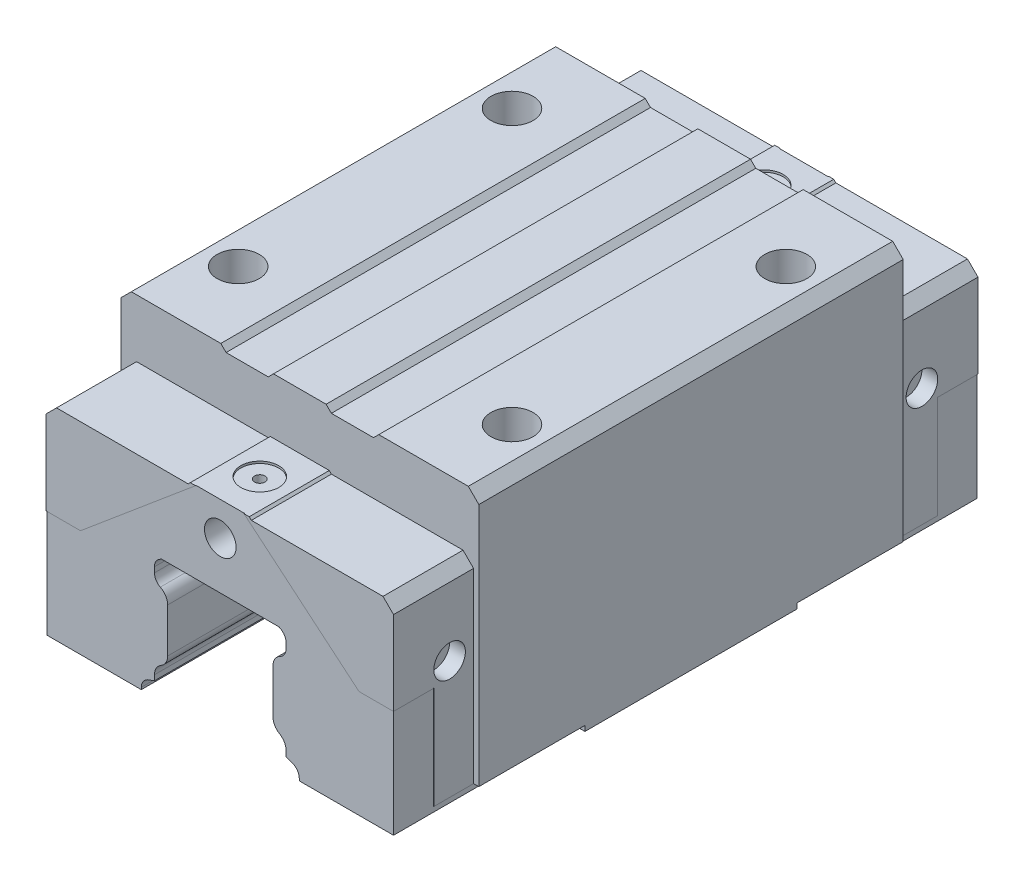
ISO-10303-21;
HEADER;
FILE_DESCRIPTION(('STEP AP214'),'2;1');
FILE_NAME('part.step','',(''),(''),'','','');
FILE_SCHEMA(('AUTOMOTIVE_DESIGN { 1 0 10303 214 1 1 1 1 }'));
ENDSEC;
DATA;
#1=APPLICATION_CONTEXT('core data for automotive mechanical design processes');
#2=APPLICATION_PROTOCOL_DEFINITION('international standard','automotive_design',2000,#1);
#3=PRODUCT_CONTEXT('',#1,'mechanical');
#4=PRODUCT('Part','Part','',(#3));
#5=PRODUCT_RELATED_PRODUCT_CATEGORY('part','',(#4));
#6=PRODUCT_DEFINITION_FORMATION('','',#4);
#7=PRODUCT_DEFINITION_CONTEXT('part definition',#1,'design');
#8=PRODUCT_DEFINITION('design','',#6,#7);
#9=PRODUCT_DEFINITION_SHAPE('','',#8);
#10=(LENGTH_UNIT() NAMED_UNIT(*) SI_UNIT(.MILLI.,.METRE.));
#11=(NAMED_UNIT(*) PLANE_ANGLE_UNIT() SI_UNIT($,.RADIAN.));
#12=(NAMED_UNIT(*) SI_UNIT($,.STERADIAN.) SOLID_ANGLE_UNIT());
#13=UNCERTAINTY_MEASURE_WITH_UNIT(LENGTH_MEASURE(1.E-05),#10,'distance_accuracy_value','');
#14=(GEOMETRIC_REPRESENTATION_CONTEXT(3) GLOBAL_UNCERTAINTY_ASSIGNED_CONTEXT((#13)) GLOBAL_UNIT_ASSIGNED_CONTEXT((#10,
#11,#12)) REPRESENTATION_CONTEXT('',''));
#15=CARTESIAN_POINT('',(0.,0.,0.));
#16=DIRECTION('',(0.,0.,1.));
#17=DIRECTION('',(1.,0.,0.));
#18=AXIS2_PLACEMENT_3D('',#15,#16,#17);
#19=CARTESIAN_POINT('',(-7.5,24.7,27.75));
#20=DIRECTION('',(0.,-1.,0.));
#21=DIRECTION('',(0.,0.,-1.));
#22=AXIS2_PLACEMENT_3D('',#19,#20,#21);
#23=PLANE('',#22);
#24=CARTESIAN_POINT('',(-13.,24.7,13.));
#25=DIRECTION('',(0.,1.,0.));
#26=DIRECTION('',(0.,0.,-1.));
#27=AXIS2_PLACEMENT_3D('',#24,#25,#26);
#28=CIRCLE('',#27,2.);
#29=CARTESIAN_POINT('',(-13.,24.7,15.));
#30=VERTEX_POINT('',#29);
#31=EDGE_CURVE('E2791',#30,#30,#28,.T.);
#32=ORIENTED_EDGE('',*,*,#31,.F.);
#33=EDGE_LOOP('',(#32));
#34=FACE_BOUND('',#33,.T.);
#35=DIRECTION('',(-1.,0.,0.));
#36=VECTOR('',#35,1.);
#37=CARTESIAN_POINT('',(-16.,24.7,-20.15));
#38=LINE('',#37,#36);
#39=CARTESIAN_POINT('',(-7.5,24.7,-20.15));
#40=VERTEX_POINT('',#39);
#41=CARTESIAN_POINT('',(-16.,24.7,-20.15));
#42=VERTEX_POINT('',#41);
#43=EDGE_CURVE('E608',#40,#42,#38,.T.);
#44=ORIENTED_EDGE('',*,*,#43,.T.);
#45=DIRECTION('',(0.,0.,-1.));
#46=VECTOR('',#45,1.);
#47=CARTESIAN_POINT('',(-16.,24.7,27.75));
#48=LINE('',#47,#46);
#49=CARTESIAN_POINT('',(-16.,24.7,20.15));
#50=VERTEX_POINT('',#49);
#51=EDGE_CURVE('E979',#50,#42,#48,.T.);
#52=ORIENTED_EDGE('',*,*,#51,.F.);
#53=DIRECTION('',(-1.,0.,0.));
#54=VECTOR('',#53,1.);
#55=CARTESIAN_POINT('',(-16.,24.7,20.15));
#56=LINE('',#55,#54);
#57=CARTESIAN_POINT('',(-7.5,24.7,20.15));
#58=VERTEX_POINT('',#57);
#59=EDGE_CURVE('E861',#58,#50,#56,.T.);
#60=ORIENTED_EDGE('',*,*,#59,.F.);
#61=DIRECTION('',(0.,0.,-1.));
#62=VECTOR('',#61,1.);
#63=CARTESIAN_POINT('',(-7.5,24.7,27.75));
#64=LINE('',#63,#62);
#65=EDGE_CURVE('E982',#58,#40,#64,.T.);
#66=ORIENTED_EDGE('',*,*,#65,.T.);
#67=EDGE_LOOP('',(#44,#52,#60,#66));
#68=FACE_BOUND('',#67,.T.);
#69=CARTESIAN_POINT('',(-13.,24.7,-13.));
#70=DIRECTION('',(0.,-1.,0.));
#71=DIRECTION('',(0.,0.,1.));
#72=AXIS2_PLACEMENT_3D('',#69,#70,#71);
#73=CIRCLE('',#72,2.);
#74=CARTESIAN_POINT('',(-13.,24.7,-11.));
#75=VERTEX_POINT('',#74);
#76=EDGE_CURVE('E2782',#75,#75,#73,.T.);
#77=ORIENTED_EDGE('',*,*,#76,.T.);
#78=EDGE_LOOP('',(#77));
#79=FACE_BOUND('',#78,.T.);
#80=ADVANCED_FACE('F35',(#34,#68,#79),#23,.F.);
#81=CARTESIAN_POINT('',(7.5,24.7,27.75));
#82=DIRECTION('',(0.,-1.,0.));
#83=DIRECTION('',(0.,0.,-1.));
#84=AXIS2_PLACEMENT_3D('',#81,#82,#83);
#85=PLANE('',#84);
#86=CARTESIAN_POINT('',(13.,24.7,13.));
#87=DIRECTION('',(0.,1.,0.));
#88=DIRECTION('',(0.,0.,1.));
#89=AXIS2_PLACEMENT_3D('',#86,#87,#88);
#90=CIRCLE('',#89,2.);
#91=CARTESIAN_POINT('',(13.,24.7,15.));
#92=VERTEX_POINT('',#91);
#93=EDGE_CURVE('E2796',#92,#92,#90,.T.);
#94=ORIENTED_EDGE('',*,*,#93,.F.);
#95=EDGE_LOOP('',(#94));
#96=FACE_BOUND('',#95,.T.);
#97=DIRECTION('',(-1.,0.,0.));
#98=VECTOR('',#97,1.);
#99=CARTESIAN_POINT('',(16.,24.7,-20.15));
#100=LINE('',#99,#98);
#101=CARTESIAN_POINT('',(16.,24.7,-20.15));
#102=VERTEX_POINT('',#101);
#103=CARTESIAN_POINT('',(7.5,24.7,-20.15));
#104=VERTEX_POINT('',#103);
#105=EDGE_CURVE('E637',#102,#104,#100,.T.);
#106=ORIENTED_EDGE('',*,*,#105,.T.);
#107=DIRECTION('',(0.,0.,-1.));
#108=VECTOR('',#107,1.);
#109=CARTESIAN_POINT('',(7.5,24.7,27.75));
#110=LINE('',#109,#108);
#111=CARTESIAN_POINT('',(7.5,24.7,20.15));
#112=VERTEX_POINT('',#111);
#113=EDGE_CURVE('E1003',#112,#104,#110,.T.);
#114=ORIENTED_EDGE('',*,*,#113,.F.);
#115=DIRECTION('',(-1.,0.,0.));
#116=VECTOR('',#115,1.);
#117=CARTESIAN_POINT('',(16.,24.7,20.15));
#118=LINE('',#117,#116);
#119=CARTESIAN_POINT('',(16.,24.7,20.15));
#120=VERTEX_POINT('',#119);
#121=EDGE_CURVE('E845',#120,#112,#118,.T.);
#122=ORIENTED_EDGE('',*,*,#121,.F.);
#123=DIRECTION('',(0.,0.,-1.));
#124=VECTOR('',#123,1.);
#125=CARTESIAN_POINT('',(16.,24.7,27.75));
#126=LINE('',#125,#124);
#127=EDGE_CURVE('E1006',#120,#102,#126,.T.);
#128=ORIENTED_EDGE('',*,*,#127,.T.);
#129=EDGE_LOOP('',(#106,#114,#122,#128));
#130=FACE_BOUND('',#129,.T.);
#131=CARTESIAN_POINT('',(13.,24.7,-13.));
#132=DIRECTION('',(0.,-1.,0.));
#133=DIRECTION('',(0.,0.,-1.));
#134=AXIS2_PLACEMENT_3D('',#131,#132,#133);
#135=CIRCLE('',#134,2.);
#136=CARTESIAN_POINT('',(13.,24.7,-11.));
#137=VERTEX_POINT('',#136);
#138=EDGE_CURVE('E2781',#137,#137,#135,.T.);
#139=ORIENTED_EDGE('',*,*,#138,.T.);
#140=EDGE_LOOP('',(#139));
#141=FACE_BOUND('',#140,.T.);
#142=ADVANCED_FACE('F1434',(#96,#130,#141),#85,.F.);
#143=CARTESIAN_POINT('',(0.,0.,20.15));
#144=DIRECTION('',(0.,0.,1.));
#145=DIRECTION('',(1.,0.,0.));
#146=AXIS2_PLACEMENT_3D('',#143,#144,#145);
#147=PLANE('',#146);
#148=DIRECTION('',(-1.,0.,0.));
#149=VECTOR('',#148,1.);
#150=CARTESIAN_POINT('',(27.5156790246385,17.7,20.15));
#151=LINE('',#150,#149);
#152=CARTESIAN_POINT('',(-16.5,17.7,20.15));
#153=VERTEX_POINT('',#152);
#154=CARTESIAN_POINT('',(-17.,17.7,20.15));
#155=VERTEX_POINT('',#154);
#156=EDGE_CURVE('E584',#153,#155,#151,.T.);
#157=ORIENTED_EDGE('',*,*,#156,.F.);
#158=DIRECTION('',(0.,1.,0.));
#159=VECTOR('',#158,1.);
#160=CARTESIAN_POINT('',(-16.5,0.,20.15));
#161=LINE('',#160,#159);
#162=CARTESIAN_POINT('',(-16.5,18.2,20.15));
#163=VERTEX_POINT('',#162);
#164=EDGE_CURVE('E867',#153,#163,#161,.T.);
#165=ORIENTED_EDGE('',*,*,#164,.T.);
#166=DIRECTION('',(0.707106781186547,0.707106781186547,0.));
#167=VECTOR('',#166,1.);
#168=CARTESIAN_POINT('',(-16.5,18.2,20.15));
#169=LINE('',#168,#167);
#170=CARTESIAN_POINT('',(-15.5,19.2,20.15));
#171=VERTEX_POINT('',#170);
#172=EDGE_CURVE('E869',#163,#171,#169,.T.);
#173=ORIENTED_EDGE('',*,*,#172,.T.);
#174=DIRECTION('',(1.,0.,0.));
#175=VECTOR('',#174,1.);
#176=CARTESIAN_POINT('',(-15.5,19.2,20.15));
#177=LINE('',#176,#175);
#178=CARTESIAN_POINT('',(-3.00000000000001,19.2,20.15));
#179=VERTEX_POINT('',#178);
#180=EDGE_CURVE('E872',#171,#179,#177,.T.);
#181=ORIENTED_EDGE('',*,*,#180,.T.);
#182=DIRECTION('',(0.707106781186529,0.707106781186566,0.));
#183=VECTOR('',#182,1.);
#184=CARTESIAN_POINT('',(-3.00000000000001,19.2,20.15));
#185=LINE('',#184,#183);
#186=CARTESIAN_POINT('',(-2.8,19.4,20.15));
#187=VERTEX_POINT('',#186);
#188=EDGE_CURVE('E875',#179,#187,#185,.T.);
#189=ORIENTED_EDGE('',*,*,#188,.T.);
#190=DIRECTION('',(1.,0.,0.));
#191=VECTOR('',#190,1.);
#192=CARTESIAN_POINT('',(2.8,19.4,20.15));
#193=LINE('',#192,#191);
#194=CARTESIAN_POINT('',(2.8,19.4,20.15));
#195=VERTEX_POINT('',#194);
#196=EDGE_CURVE('E878',#187,#195,#193,.T.);
#197=ORIENTED_EDGE('',*,*,#196,.T.);
#198=DIRECTION('',(0.707106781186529,-0.707106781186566,0.));
#199=VECTOR('',#198,1.);
#200=CARTESIAN_POINT('',(3.00000000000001,19.2,20.15));
#201=LINE('',#200,#199);
#202=CARTESIAN_POINT('',(3.00000000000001,19.2,20.15));
#203=VERTEX_POINT('',#202);
#204=EDGE_CURVE('E881',#195,#203,#201,.T.);
#205=ORIENTED_EDGE('',*,*,#204,.T.);
#206=DIRECTION('',(1.,0.,0.));
#207=VECTOR('',#206,1.);
#208=CARTESIAN_POINT('',(15.5,19.2,20.15));
#209=LINE('',#208,#207);
#210=CARTESIAN_POINT('',(15.5,19.2,20.15));
#211=VERTEX_POINT('',#210);
#212=EDGE_CURVE('E884',#203,#211,#209,.T.);
#213=ORIENTED_EDGE('',*,*,#212,.T.);
#214=DIRECTION('',(0.707106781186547,-0.707106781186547,0.));
#215=VECTOR('',#214,1.);
#216=CARTESIAN_POINT('',(16.5,18.2,20.15));
#217=LINE('',#216,#215);
#218=CARTESIAN_POINT('',(16.5,18.2,20.15));
#219=VERTEX_POINT('',#218);
#220=EDGE_CURVE('E887',#211,#219,#217,.T.);
#221=ORIENTED_EDGE('',*,*,#220,.T.);
#222=DIRECTION('',(0.,-1.,0.));
#223=VECTOR('',#222,1.);
#224=CARTESIAN_POINT('',(16.5,0.,20.15));
#225=LINE('',#224,#223);
#226=CARTESIAN_POINT('',(16.5,0.5,20.15));
#227=VERTEX_POINT('',#226);
#228=EDGE_CURVE('E890',#219,#227,#225,.T.);
#229=ORIENTED_EDGE('',*,*,#228,.T.);
#230=DIRECTION('',(1.,0.,0.));
#231=VECTOR('',#230,1.);
#232=CARTESIAN_POINT('',(0.,0.5,20.15));
#233=LINE('',#232,#231);
#234=CARTESIAN_POINT('',(17.,0.5,20.15));
#235=VERTEX_POINT('',#234);
#236=EDGE_CURVE('E1261',#227,#235,#233,.T.);
#237=ORIENTED_EDGE('',*,*,#236,.T.);
#238=DIRECTION('',(0.,1.,0.));
#239=VECTOR('',#238,1.);
#240=CARTESIAN_POINT('',(17.,0.,20.15));
#241=LINE('',#240,#239);
#242=CARTESIAN_POINT('',(17.,23.7,20.15));
#243=VERTEX_POINT('',#242);
#244=EDGE_CURVE('E840',#235,#243,#241,.T.);
#245=ORIENTED_EDGE('',*,*,#244,.T.);
#246=DIRECTION('',(-0.707106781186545,0.70710678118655,0.));
#247=VECTOR('',#246,1.);
#248=CARTESIAN_POINT('',(17.,23.7,20.15));
#249=LINE('',#248,#247);
#250=EDGE_CURVE('E842',#243,#120,#249,.T.);
#251=ORIENTED_EDGE('',*,*,#250,.T.);
#252=ORIENTED_EDGE('',*,*,#121,.T.);
#253=DIRECTION('',(-0.707106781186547,-0.707106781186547,0.));
#254=VECTOR('',#253,1.);
#255=CARTESIAN_POINT('',(7.5,24.7,20.15));
#256=LINE('',#255,#254);
#257=CARTESIAN_POINT('',(7.,24.2,20.15));
#258=VERTEX_POINT('',#257);
#259=EDGE_CURVE('E847',#112,#258,#256,.T.);
#260=ORIENTED_EDGE('',*,*,#259,.T.);
#261=DIRECTION('',(-1.,0.,0.));
#262=VECTOR('',#261,1.);
#263=CARTESIAN_POINT('',(7.,24.2,20.15));
#264=LINE('',#263,#262);
#265=CARTESIAN_POINT('',(3.,24.2,20.15));
#266=VERTEX_POINT('',#265);
#267=EDGE_CURVE('E849',#258,#266,#264,.T.);
#268=ORIENTED_EDGE('',*,*,#267,.T.);
#269=DIRECTION('',(-0.707106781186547,0.707106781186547,0.));
#270=VECTOR('',#269,1.);
#271=CARTESIAN_POINT('',(3.,24.2,20.15));
#272=LINE('',#271,#270);
#273=CARTESIAN_POINT('',(2.5,24.7,20.15));
#274=VERTEX_POINT('',#273);
#275=EDGE_CURVE('E851',#266,#274,#272,.T.);
#276=ORIENTED_EDGE('',*,*,#275,.T.);
#277=DIRECTION('',(-1.,0.,0.));
#278=VECTOR('',#277,1.);
#279=CARTESIAN_POINT('',(2.5,24.7,20.15));
#280=LINE('',#279,#278);
#281=CARTESIAN_POINT('',(-2.5,24.7,20.15));
#282=VERTEX_POINT('',#281);
#283=EDGE_CURVE('E853',#274,#282,#280,.T.);
#284=ORIENTED_EDGE('',*,*,#283,.T.);
#285=DIRECTION('',(-0.707106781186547,-0.707106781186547,0.));
#286=VECTOR('',#285,1.);
#287=CARTESIAN_POINT('',(-3.,24.2,20.15));
#288=LINE('',#287,#286);
#289=CARTESIAN_POINT('',(-3.,24.2,20.15));
#290=VERTEX_POINT('',#289);
#291=EDGE_CURVE('E855',#282,#290,#288,.T.);
#292=ORIENTED_EDGE('',*,*,#291,.T.);
#293=DIRECTION('',(-1.,0.,0.));
#294=VECTOR('',#293,1.);
#295=CARTESIAN_POINT('',(-7.,24.2,20.15));
#296=LINE('',#295,#294);
#297=CARTESIAN_POINT('',(-7.,24.2,20.15));
#298=VERTEX_POINT('',#297);
#299=EDGE_CURVE('E857',#290,#298,#296,.T.);
#300=ORIENTED_EDGE('',*,*,#299,.T.);
#301=DIRECTION('',(-0.707106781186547,0.707106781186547,0.));
#302=VECTOR('',#301,1.);
#303=CARTESIAN_POINT('',(-7.5,24.7,20.15));
#304=LINE('',#303,#302);
#305=EDGE_CURVE('E859',#298,#58,#304,.T.);
#306=ORIENTED_EDGE('',*,*,#305,.T.);
#307=ORIENTED_EDGE('',*,*,#59,.T.);
#308=DIRECTION('',(-0.707106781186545,-0.70710678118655,0.));
#309=VECTOR('',#308,1.);
#310=CARTESIAN_POINT('',(-17.,23.7,20.15));
#311=LINE('',#310,#309);
#312=CARTESIAN_POINT('',(-17.,23.7,20.15));
#313=VERTEX_POINT('',#312);
#314=EDGE_CURVE('E863',#50,#313,#311,.T.);
#315=ORIENTED_EDGE('',*,*,#314,.T.);
#316=DIRECTION('',(0.,-1.,0.));
#317=VECTOR('',#316,1.);
#318=CARTESIAN_POINT('',(-17.,0.,20.15));
#319=LINE('',#318,#317);
#320=EDGE_CURVE('E865',#313,#155,#319,.T.);
#321=ORIENTED_EDGE('',*,*,#320,.T.);
#322=EDGE_LOOP('',(#157,#165,#173,#181,#189,#197,#205,#213,#221,#229,#237,#245,#251,#252,#260,
#268,#276,#284,#292,#300,#306,#307,#315,#321));
#323=FACE_BOUND('',#322,.T.);
#324=ADVANCED_FACE('F1395',(#323),#147,.T.);
#325=CARTESIAN_POINT('',(-7.49999999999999,0.,27.75));
#326=DIRECTION('',(0.,1.,0.));
#327=DIRECTION('',(-1.,0.,0.));
#328=AXIS2_PLACEMENT_3D('',#325,#326,#327);
#329=PLANE('',#328);
#330=DIRECTION('',(1.,0.,0.));
#331=VECTOR('',#330,1.);
#332=CARTESIAN_POINT('',(-16.45,0.,10.075));
#333=LINE('',#332,#331);
#334=CARTESIAN_POINT('',(-16.5,0.,10.075));
#335=VERTEX_POINT('',#334);
#336=CARTESIAN_POINT('',(-16.45,0.,10.075));
#337=VERTEX_POINT('',#336);
#338=EDGE_CURVE('E1227',#335,#337,#333,.T.);
#339=ORIENTED_EDGE('',*,*,#338,.F.);
#340=DIRECTION('',(0.,0.,1.));
#341=VECTOR('',#340,1.);
#342=CARTESIAN_POINT('',(-16.5,0.,-20.15));
#343=LINE('',#342,#341);
#344=CARTESIAN_POINT('',(-16.5,0.,-10.075));
#345=VERTEX_POINT('',#344);
#346=EDGE_CURVE('E589',#345,#335,#343,.T.);
#347=ORIENTED_EDGE('',*,*,#346,.F.);
#348=DIRECTION('',(1.,0.,0.));
#349=VECTOR('',#348,1.);
#350=CARTESIAN_POINT('',(-16.45,0.,-10.075));
#351=LINE('',#350,#349);
#352=CARTESIAN_POINT('',(-16.45,0.,-10.075));
#353=VERTEX_POINT('',#352);
#354=EDGE_CURVE('E1193',#345,#353,#351,.T.);
#355=ORIENTED_EDGE('',*,*,#354,.T.);
#356=DIRECTION('',(0.,0.,1.));
#357=VECTOR('',#356,1.);
#358=CARTESIAN_POINT('',(-16.45,0.,-27.7));
#359=LINE('',#358,#357);
#360=CARTESIAN_POINT('',(-16.45,0.,-27.7));
#361=VERTEX_POINT('',#360);
#362=EDGE_CURVE('E1273',#361,#353,#359,.T.);
#363=ORIENTED_EDGE('',*,*,#362,.F.);
#364=DIRECTION('',(1.,0.,0.));
#365=VECTOR('',#364,1.);
#366=CARTESIAN_POINT('',(16.5,0.,-27.7));
#367=LINE('',#366,#365);
#368=CARTESIAN_POINT('',(-7.49999999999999,0.,-27.7));
#369=VERTEX_POINT('',#368);
#370=EDGE_CURVE('E1312',#361,#369,#367,.T.);
#371=ORIENTED_EDGE('',*,*,#370,.T.);
#372=DIRECTION('',(0.,0.,-1.));
#373=VECTOR('',#372,1.);
#374=CARTESIAN_POINT('',(-7.49999999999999,0.,27.75));
#375=LINE('',#374,#373);
#376=CARTESIAN_POINT('',(-7.49999999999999,0.,27.7));
#377=VERTEX_POINT('',#376);
#378=EDGE_CURVE('E975',#377,#369,#375,.T.);
#379=ORIENTED_EDGE('',*,*,#378,.F.);
#380=DIRECTION('',(1.,0.,0.));
#381=VECTOR('',#380,1.);
#382=CARTESIAN_POINT('',(16.5,0.,27.7));
#383=LINE('',#382,#381);
#384=CARTESIAN_POINT('',(-16.45,0.,27.7));
#385=VERTEX_POINT('',#384);
#386=EDGE_CURVE('E744',#385,#377,#383,.T.);
#387=ORIENTED_EDGE('',*,*,#386,.F.);
#388=DIRECTION('',(0.,0.,-1.));
#389=VECTOR('',#388,1.);
#390=CARTESIAN_POINT('',(-16.45,0.,27.7));
#391=LINE('',#390,#389);
#392=EDGE_CURVE('E706',#385,#337,#391,.T.);
#393=ORIENTED_EDGE('',*,*,#392,.T.);
#394=EDGE_LOOP('',(#339,#347,#355,#363,#371,#379,#387,#393));
#395=FACE_BOUND('',#394,.T.);
#396=ADVANCED_FACE('F1346',(#395),#329,.F.);
#397=CARTESIAN_POINT('',(-17.,23.7,27.75));
#398=DIRECTION('',(1.,0.,0.));
#399=DIRECTION('',(0.,1.,0.));
#400=AXIS2_PLACEMENT_3D('',#397,#398,#399);
#401=PLANE('',#400);
#402=DIRECTION('',(0.,-1.,0.));
#403=VECTOR('',#402,1.);
#404=CARTESIAN_POINT('',(-17.,0.,-20.15));
#405=LINE('',#404,#403);
#406=CARTESIAN_POINT('',(-17.,23.7,-20.15));
#407=VERTEX_POINT('',#406);
#408=CARTESIAN_POINT('',(-17.,17.7,-20.15));
#409=VERTEX_POINT('',#408);
#410=EDGE_CURVE('E595',#407,#409,#405,.T.);
#411=ORIENTED_EDGE('',*,*,#410,.T.);
#412=DIRECTION('',(0.,0.,-1.));
#413=VECTOR('',#412,1.);
#414=CARTESIAN_POINT('',(-17.,17.7,-20.15));
#415=LINE('',#414,#413);
#416=EDGE_CURVE('E578',#155,#409,#415,.T.);
#417=ORIENTED_EDGE('',*,*,#416,.F.);
#418=ORIENTED_EDGE('',*,*,#320,.F.);
#419=DIRECTION('',(0.,0.,-1.));
#420=VECTOR('',#419,1.);
#421=CARTESIAN_POINT('',(-17.,23.7,27.75));
#422=LINE('',#421,#420);
#423=EDGE_CURVE('E605',#313,#407,#422,.T.);
#424=ORIENTED_EDGE('',*,*,#423,.T.);
#425=EDGE_LOOP('',(#411,#417,#418,#424));
#426=FACE_BOUND('',#425,.T.);
#427=ADVANCED_FACE('F603',(#426),#401,.F.);
#428=CARTESIAN_POINT('',(-16.45,10.2339745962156,23.925));
#429=DIRECTION('',(0.,0.,1.));
#430=DIRECTION('',(1.,0.,0.));
#431=AXIS2_PLACEMENT_3D('',#428,#429,#430);
#432=PLANE('',#431);
#433=DIRECTION('',(0.,1.,0.));
#434=VECTOR('',#433,1.);
#435=CARTESIAN_POINT('',(-16.5,10.2339745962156,23.925));
#436=LINE('',#435,#434);
#437=CARTESIAN_POINT('',(-16.5,0.499999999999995,23.925));
#438=VERTEX_POINT('',#437);
#439=CARTESIAN_POINT('',(-16.5,10.2339745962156,23.925));
#440=VERTEX_POINT('',#439);
#441=EDGE_CURVE('E696',#438,#440,#436,.T.);
#442=ORIENTED_EDGE('',*,*,#441,.F.);
#443=DIRECTION('',(1.,0.,0.));
#444=VECTOR('',#443,1.);
#445=CARTESIAN_POINT('',(-16.45,0.499999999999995,23.925));
#446=LINE('',#445,#444);
#447=CARTESIAN_POINT('',(-16.45,0.499999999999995,23.925));
#448=VERTEX_POINT('',#447);
#449=EDGE_CURVE('E1237',#438,#448,#446,.T.);
#450=ORIENTED_EDGE('',*,*,#449,.T.);
#451=DIRECTION('',(0.,1.,0.));
#452=VECTOR('',#451,1.);
#453=CARTESIAN_POINT('',(-16.45,10.2339745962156,23.925));
#454=LINE('',#453,#452);
#455=CARTESIAN_POINT('',(-16.45,10.2339745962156,23.925));
#456=VERTEX_POINT('',#455);
#457=EDGE_CURVE('E704',#448,#456,#454,.T.);
#458=ORIENTED_EDGE('',*,*,#457,.T.);
#459=DIRECTION('',(-1.,0.,0.));
#460=VECTOR('',#459,1.);
#461=CARTESIAN_POINT('',(-16.45,10.2339745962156,23.925));
#462=LINE('',#461,#460);
#463=EDGE_CURVE('E709',#456,#440,#462,.T.);
#464=ORIENTED_EDGE('',*,*,#463,.T.);
#465=EDGE_LOOP('',(#442,#450,#458,#464));
#466=FACE_BOUND('',#465,.T.);
#467=ADVANCED_FACE('F1378',(#466),#432,.T.);
#468=CARTESIAN_POINT('',(7.5,0.,27.75));
#469=DIRECTION('',(0.,1.,0.));
#470=DIRECTION('',(-1.,0.,0.));
#471=AXIS2_PLACEMENT_3D('',#468,#469,#470);
#472=PLANE('',#471);
#473=DIRECTION('',(0.,0.,1.));
#474=VECTOR('',#473,1.);
#475=CARTESIAN_POINT('',(16.45,0.,-27.7));
#476=LINE('',#475,#474);
#477=CARTESIAN_POINT('',(16.45,0.,-27.7));
#478=VERTEX_POINT('',#477);
#479=CARTESIAN_POINT('',(16.45,0.,-10.075));
#480=VERTEX_POINT('',#479);
#481=EDGE_CURVE('E1298',#478,#480,#476,.T.);
#482=ORIENTED_EDGE('',*,*,#481,.T.);
#483=DIRECTION('',(1.,0.,0.));
#484=VECTOR('',#483,1.);
#485=CARTESIAN_POINT('',(16.45,0.,-10.075));
#486=LINE('',#485,#484);
#487=CARTESIAN_POINT('',(17.,0.,-10.075));
#488=VERTEX_POINT('',#487);
#489=EDGE_CURVE('E1208',#480,#488,#486,.T.);
#490=ORIENTED_EDGE('',*,*,#489,.T.);
#491=DIRECTION('',(0.,0.,-1.));
#492=VECTOR('',#491,1.);
#493=CARTESIAN_POINT('',(17.,0.,27.75));
#494=LINE('',#493,#492);
#495=CARTESIAN_POINT('',(17.,0.,10.075));
#496=VERTEX_POINT('',#495);
#497=EDGE_CURVE('E1012',#496,#488,#494,.T.);
#498=ORIENTED_EDGE('',*,*,#497,.F.);
#499=DIRECTION('',(1.,0.,0.));
#500=VECTOR('',#499,1.);
#501=CARTESIAN_POINT('',(16.45,0.,10.075));
#502=LINE('',#501,#500);
#503=CARTESIAN_POINT('',(16.45,0.,10.075));
#504=VERTEX_POINT('',#503);
#505=EDGE_CURVE('E1245',#504,#496,#502,.T.);
#506=ORIENTED_EDGE('',*,*,#505,.F.);
#507=DIRECTION('',(0.,0.,-1.));
#508=VECTOR('',#507,1.);
#509=CARTESIAN_POINT('',(16.45,0.,27.7));
#510=LINE('',#509,#508);
#511=CARTESIAN_POINT('',(16.45,0.,27.7));
#512=VERTEX_POINT('',#511);
#513=EDGE_CURVE('E722',#512,#504,#510,.T.);
#514=ORIENTED_EDGE('',*,*,#513,.F.);
#515=CARTESIAN_POINT('',(7.5,0.,27.7));
#516=VERTEX_POINT('',#515);
#517=EDGE_CURVE('E743',#516,#512,#383,.T.);
#518=ORIENTED_EDGE('',*,*,#517,.F.);
#519=DIRECTION('',(0.,0.,-1.));
#520=VECTOR('',#519,1.);
#521=CARTESIAN_POINT('',(7.5,0.,27.75));
#522=LINE('',#521,#520);
#523=CARTESIAN_POINT('',(7.5,0.,-27.7));
#524=VERTEX_POINT('',#523);
#525=EDGE_CURVE('E1015',#516,#524,#522,.T.);
#526=ORIENTED_EDGE('',*,*,#525,.T.);
#527=EDGE_CURVE('E1311',#524,#478,#367,.T.);
#528=ORIENTED_EDGE('',*,*,#527,.T.);
#529=EDGE_LOOP('',(#482,#490,#498,#506,#514,#518,#526,#528));
#530=FACE_BOUND('',#529,.T.);
#531=ADVANCED_FACE('F1509',(#530),#472,.F.);
#532=CARTESIAN_POINT('',(17.,23.7,27.75));
#533=DIRECTION('',(-1.,0.,0.));
#534=DIRECTION('',(0.,-1.,0.));
#535=AXIS2_PLACEMENT_3D('',#532,#533,#534);
#536=PLANE('',#535);
#537=DIRECTION('',(0.,1.,0.));
#538=VECTOR('',#537,1.);
#539=CARTESIAN_POINT('',(17.,0.,-10.075));
#540=LINE('',#539,#538);
#541=CARTESIAN_POINT('',(17.,0.5,-10.075));
#542=VERTEX_POINT('',#541);
#543=EDGE_CURVE('E1211',#488,#542,#540,.T.);
#544=ORIENTED_EDGE('',*,*,#543,.T.);
#545=DIRECTION('',(0.,0.,1.));
#546=VECTOR('',#545,1.);
#547=CARTESIAN_POINT('',(17.,0.5,-27.75));
#548=LINE('',#547,#546);
#549=CARTESIAN_POINT('',(17.,0.5,-20.15));
#550=VERTEX_POINT('',#549);
#551=EDGE_CURVE('E1217',#550,#542,#548,.T.);
#552=ORIENTED_EDGE('',*,*,#551,.F.);
#553=DIRECTION('',(0.,1.,0.));
#554=VECTOR('',#553,1.);
#555=CARTESIAN_POINT('',(17.,0.,-20.15));
#556=LINE('',#555,#554);
#557=CARTESIAN_POINT('',(17.,23.7,-20.15));
#558=VERTEX_POINT('',#557);
#559=EDGE_CURVE('E643',#550,#558,#556,.T.);
#560=ORIENTED_EDGE('',*,*,#559,.T.);
#561=DIRECTION('',(0.,0.,-1.));
#562=VECTOR('',#561,1.);
#563=CARTESIAN_POINT('',(17.,23.7,27.75));
#564=LINE('',#563,#562);
#565=EDGE_CURVE('E1009',#243,#558,#564,.T.);
#566=ORIENTED_EDGE('',*,*,#565,.F.);
#567=ORIENTED_EDGE('',*,*,#244,.F.);
#568=DIRECTION('',(0.,0.,-1.));
#569=VECTOR('',#568,1.);
#570=CARTESIAN_POINT('',(17.,0.5,27.75));
#571=LINE('',#570,#569);
#572=CARTESIAN_POINT('',(17.,0.5,10.075));
#573=VERTEX_POINT('',#572);
#574=EDGE_CURVE('E1254',#235,#573,#571,.T.);
#575=ORIENTED_EDGE('',*,*,#574,.T.);
#576=DIRECTION('',(0.,1.,0.));
#577=VECTOR('',#576,1.);
#578=CARTESIAN_POINT('',(17.,0.,10.075));
#579=LINE('',#578,#577);
#580=EDGE_CURVE('E1247',#496,#573,#579,.T.);
#581=ORIENTED_EDGE('',*,*,#580,.F.);
#582=ORIENTED_EDGE('',*,*,#497,.T.);
#583=EDGE_LOOP('',(#544,#552,#560,#566,#567,#575,#581,#582));
#584=FACE_BOUND('',#583,.T.);
#585=ADVANCED_FACE('F1447',(#584),#536,.F.);
#586=CARTESIAN_POINT('',(16.5,0.,20.15));
#587=DIRECTION('',(-1.,0.,0.));
#588=DIRECTION('',(0.,0.,1.));
#589=AXIS2_PLACEMENT_3D('',#586,#587,#588);
#590=PLANE('',#589);
#591=CARTESIAN_POINT('',(16.5,11.7339745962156,22.425));
#592=DIRECTION('',(1.,0.,0.));
#593=DIRECTION('',(0.,0.,-1.));
#594=AXIS2_PLACEMENT_3D('',#591,#592,#593);
#595=CIRCLE('',#594,1.5);
#596=CARTESIAN_POINT('',(16.5,11.7339745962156,20.925));
#597=VERTEX_POINT('',#596);
#598=EDGE_CURVE('E713',#597,#597,#595,.T.);
#599=ORIENTED_EDGE('',*,*,#598,.F.);
#600=EDGE_LOOP('',(#599));
#601=FACE_BOUND('',#600,.T.);
#602=DIRECTION('',(0.,0.,1.));
#603=VECTOR('',#602,1.);
#604=CARTESIAN_POINT('',(16.5,0.5,20.15));
#605=LINE('',#604,#603);
#606=CARTESIAN_POINT('',(16.5,0.5,23.925));
#607=VERTEX_POINT('',#606);
#608=EDGE_CURVE('E1259',#227,#607,#605,.T.);
#609=ORIENTED_EDGE('',*,*,#608,.F.);
#610=ORIENTED_EDGE('',*,*,#228,.F.);
#611=DIRECTION('',(0.,0.,1.));
#612=VECTOR('',#611,1.);
#613=CARTESIAN_POINT('',(16.5,18.2,20.15));
#614=LINE('',#613,#612);
#615=CARTESIAN_POINT('',(16.5,18.2,27.75));
#616=VERTEX_POINT('',#615);
#617=EDGE_CURVE('E919',#219,#616,#614,.T.);
#618=ORIENTED_EDGE('',*,*,#617,.T.);
#619=DIRECTION('',(0.,-1.,0.));
#620=VECTOR('',#619,1.);
#621=CARTESIAN_POINT('',(16.5,0.,27.75));
#622=LINE('',#621,#620);
#623=CARTESIAN_POINT('',(16.5,10.2339745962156,27.75));
#624=VERTEX_POINT('',#623);
#625=EDGE_CURVE('E843',#616,#624,#622,.T.);
#626=ORIENTED_EDGE('',*,*,#625,.T.);
#627=DIRECTION('',(0.,0.,1.));
#628=VECTOR('',#627,1.);
#629=CARTESIAN_POINT('',(16.5,10.2339745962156,27.7));
#630=LINE('',#629,#628);
#631=CARTESIAN_POINT('',(16.5,10.2339745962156,23.925));
#632=VERTEX_POINT('',#631);
#633=EDGE_CURVE('E766',#632,#624,#630,.T.);
#634=ORIENTED_EDGE('',*,*,#633,.F.);
#635=DIRECTION('',(0.,1.,0.));
#636=VECTOR('',#635,1.);
#637=CARTESIAN_POINT('',(16.5,10.2339745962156,23.925));
#638=LINE('',#637,#636);
#639=EDGE_CURVE('E717',#607,#632,#638,.T.);
#640=ORIENTED_EDGE('',*,*,#639,.F.);
#641=EDGE_LOOP('',(#609,#610,#618,#626,#634,#640));
#642=FACE_BOUND('',#641,.T.);
#643=ADVANCED_FACE('F1663',(#601,#642),#590,.F.);
#644=CARTESIAN_POINT('',(16.45,10.2339745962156,23.925));
#645=DIRECTION('',(0.,0.,-1.));
#646=DIRECTION('',(-1.,0.,0.));
#647=AXIS2_PLACEMENT_3D('',#644,#645,#646);
#648=PLANE('',#647);
#649=DIRECTION('',(-1.,0.,0.));
#650=VECTOR('',#649,1.);
#651=CARTESIAN_POINT('',(16.45,0.5,23.925));
#652=LINE('',#651,#650);
#653=CARTESIAN_POINT('',(16.45,0.5,23.925));
#654=VERTEX_POINT('',#653);
#655=EDGE_CURVE('E1257',#607,#654,#652,.T.);
#656=ORIENTED_EDGE('',*,*,#655,.F.);
#657=ORIENTED_EDGE('',*,*,#639,.T.);
#658=DIRECTION('',(1.,0.,0.));
#659=VECTOR('',#658,1.);
#660=CARTESIAN_POINT('',(16.45,10.2339745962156,23.925));
#661=LINE('',#660,#659);
#662=CARTESIAN_POINT('',(16.45,10.2339745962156,23.925));
#663=VERTEX_POINT('',#662);
#664=EDGE_CURVE('E728',#663,#632,#661,.T.);
#665=ORIENTED_EDGE('',*,*,#664,.F.);
#666=DIRECTION('',(0.,1.,0.));
#667=VECTOR('',#666,1.);
#668=CARTESIAN_POINT('',(16.45,10.2339745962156,23.925));
#669=LINE('',#668,#667);
#670=EDGE_CURVE('E724',#654,#663,#669,.T.);
#671=ORIENTED_EDGE('',*,*,#670,.F.);
#672=EDGE_LOOP('',(#656,#657,#665,#671));
#673=FACE_BOUND('',#672,.T.);
#674=ADVANCED_FACE('F2425',(#673),#648,.F.);
#675=CARTESIAN_POINT('',(0.,0.,-27.7));
#676=DIRECTION('',(0.,0.,-1.));
#677=DIRECTION('',(1.,0.,0.));
#678=AXIS2_PLACEMENT_3D('',#675,#676,#677);
#679=PLANE('',#678);
#680=CARTESIAN_POINT('',(0.,16.2,-27.7));
#681=DIRECTION('',(0.,0.,-1.));
#682=DIRECTION('',(-1.,0.,0.));
#683=AXIS2_PLACEMENT_3D('',#680,#681,#682);
#684=CIRCLE('',#683,1.5);
#685=CARTESIAN_POINT('',(-1.5,16.2,-27.7));
#686=VERTEX_POINT('',#685);
#687=EDGE_CURVE('E1051',#686,#686,#684,.F.);
#688=ORIENTED_EDGE('',*,*,#687,.T.);
#689=EDGE_LOOP('',(#688));
#690=FACE_BOUND('',#689,.T.);
#691=ORIENTED_EDGE('',*,*,#370,.F.);
#692=DIRECTION('',(0.,-1.,0.));
#693=VECTOR('',#692,1.);
#694=CARTESIAN_POINT('',(-16.45,10.2339745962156,-27.7));
#695=LINE('',#694,#693);
#696=CARTESIAN_POINT('',(-16.45,10.2339745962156,-27.7));
#697=VERTEX_POINT('',#696);
#698=EDGE_CURVE('E1271',#697,#361,#695,.T.);
#699=ORIENTED_EDGE('',*,*,#698,.F.);
#700=DIRECTION('',(-1.,0.,0.));
#701=VECTOR('',#700,1.);
#702=CARTESIAN_POINT('',(-13.2236437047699,10.2339745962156,-27.7));
#703=LINE('',#702,#701);
#704=CARTESIAN_POINT('',(-13.2236437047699,10.2339745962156,-27.7));
#705=VERTEX_POINT('',#704);
#706=EDGE_CURVE('E1314',#705,#697,#703,.T.);
#707=ORIENTED_EDGE('',*,*,#706,.F.);
#708=DIRECTION('',(-0.766044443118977,-0.642787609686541,0.));
#709=VECTOR('',#708,1.);
#710=CARTESIAN_POINT('',(-2.30000000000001,19.4,-27.7));
#711=LINE('',#710,#709);
#712=CARTESIAN_POINT('',(-2.30000000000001,19.4,-27.7));
#713=VERTEX_POINT('',#712);
#714=EDGE_CURVE('E1079',#713,#705,#711,.T.);
#715=ORIENTED_EDGE('',*,*,#714,.F.);
#716=DIRECTION('',(-1.,0.,0.));
#717=VECTOR('',#716,1.);
#718=CARTESIAN_POINT('',(2.3,19.4,-27.7));
#719=LINE('',#718,#717);
#720=CARTESIAN_POINT('',(2.3,19.4,-27.7));
#721=VERTEX_POINT('',#720);
#722=EDGE_CURVE('E1305',#721,#713,#719,.T.);
#723=ORIENTED_EDGE('',*,*,#722,.F.);
#724=DIRECTION('',(-0.766044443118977,0.64278760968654,0.));
#725=VECTOR('',#724,1.);
#726=CARTESIAN_POINT('',(2.3,19.4,-27.7));
#727=LINE('',#726,#725);
#728=CARTESIAN_POINT('',(13.2236437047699,10.2339745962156,-27.7));
#729=VERTEX_POINT('',#728);
#730=EDGE_CURVE('E1307',#729,#721,#727,.T.);
#731=ORIENTED_EDGE('',*,*,#730,.F.);
#732=DIRECTION('',(-1.,0.,0.));
#733=VECTOR('',#732,1.);
#734=CARTESIAN_POINT('',(13.2236437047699,10.2339745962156,-27.7));
#735=LINE('',#734,#733);
#736=CARTESIAN_POINT('',(16.45,10.2339745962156,-27.7));
#737=VERTEX_POINT('',#736);
#738=EDGE_CURVE('E1309',#737,#729,#735,.T.);
#739=ORIENTED_EDGE('',*,*,#738,.F.);
#740=DIRECTION('',(0.,-1.,0.));
#741=VECTOR('',#740,1.);
#742=CARTESIAN_POINT('',(16.45,10.2339745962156,-27.7));
#743=LINE('',#742,#741);
#744=EDGE_CURVE('E1291',#737,#478,#743,.T.);
#745=ORIENTED_EDGE('',*,*,#744,.T.);
#746=ORIENTED_EDGE('',*,*,#527,.F.);
#747=DIRECTION('',(0.,1.,0.));
#748=VECTOR('',#747,1.);
#749=CARTESIAN_POINT('',(7.5,0.,-27.7));
#750=LINE('',#749,#748);
#751=CARTESIAN_POINT('',(7.5,0.200000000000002,-27.7));
#752=VERTEX_POINT('',#751);
#753=EDGE_CURVE('E1127',#524,#752,#750,.T.);
#754=ORIENTED_EDGE('',*,*,#753,.T.);
#755=CARTESIAN_POINT('',(6.5,0.200000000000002,-27.7));
#756=DIRECTION('',(0.,0.,-1.));
#757=DIRECTION('',(-1.,0.,0.));
#758=AXIS2_PLACEMENT_3D('',#755,#756,#757);
#759=CIRCLE('',#758,1.);
#760=CARTESIAN_POINT('',(6.84202014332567,1.13969262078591,-27.7));
#761=VERTEX_POINT('',#760);
#762=EDGE_CURVE('E1125',#752,#761,#759,.F.);
#763=ORIENTED_EDGE('',*,*,#762,.T.);
#764=DIRECTION('',(-0.939692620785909,0.342020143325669,0.));
#765=VECTOR('',#764,1.);
#766=CARTESIAN_POINT('',(6.84202014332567,1.13969262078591,-27.7));
#767=LINE('',#766,#765);
#768=CARTESIAN_POINT('',(6.25,1.35517033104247,-27.7));
#769=VERTEX_POINT('',#768);
#770=EDGE_CURVE('E1123',#761,#769,#767,.T.);
#771=ORIENTED_EDGE('',*,*,#770,.T.);
#772=DIRECTION('',(0.,1.,0.));
#773=VECTOR('',#772,1.);
#774=CARTESIAN_POINT('',(6.25,1.35517033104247,-27.7));
#775=LINE('',#774,#773);
#776=CARTESIAN_POINT('',(6.25,1.85517033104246,-27.7));
#777=VERTEX_POINT('',#776);
#778=EDGE_CURVE('E1121',#769,#777,#775,.T.);
#779=ORIENTED_EDGE('',*,*,#778,.T.);
#780=CARTESIAN_POINT('',(5.,1.85517033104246,-27.7));
#781=DIRECTION('',(0.,0.,-1.));
#782=DIRECTION('',(-1.,0.,0.));
#783=AXIS2_PLACEMENT_3D('',#780,#781,#782);
#784=CIRCLE('',#783,1.25);
#785=CARTESIAN_POINT('',(5.625,2.93770208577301,-27.7));
#786=VERTEX_POINT('',#785);
#787=EDGE_CURVE('E1119',#777,#786,#784,.F.);
#788=ORIENTED_EDGE('',*,*,#787,.T.);
#789=CARTESIAN_POINT('',(6.25,4.02023384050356,-27.7));
#790=DIRECTION('',(0.,0.,-1.));
#791=DIRECTION('',(-1.,0.,0.));
#792=AXIS2_PLACEMENT_3D('',#789,#790,#791);
#793=CIRCLE('',#792,1.25);
#794=CARTESIAN_POINT('',(5.,4.02023384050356,-27.7));
#795=VERTEX_POINT('',#794);
#796=EDGE_CURVE('E1117',#786,#795,#793,.T.);
#797=ORIENTED_EDGE('',*,*,#796,.T.);
#798=DIRECTION('',(0.,1.,0.));
#799=VECTOR('',#798,1.);
#800=CARTESIAN_POINT('',(5.,4.02023384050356,-27.7));
#801=LINE('',#800,#799);
#802=CARTESIAN_POINT('',(5.,8.21841015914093,-27.7));
#803=VERTEX_POINT('',#802);
#804=EDGE_CURVE('E1115',#795,#803,#801,.T.);
#805=ORIENTED_EDGE('',*,*,#804,.T.);
#806=CARTESIAN_POINT('',(6.25,8.21841015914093,-27.7));
#807=DIRECTION('',(0.,0.,-1.));
#808=DIRECTION('',(-1.,0.,0.));
#809=AXIS2_PLACEMENT_3D('',#806,#807,#808);
#810=CIRCLE('',#809,1.25);
#811=CARTESIAN_POINT('',(5.69444444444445,9.33816817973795,-27.7));
#812=VERTEX_POINT('',#811);
#813=EDGE_CURVE('E1113',#803,#812,#810,.T.);
#814=ORIENTED_EDGE('',*,*,#813,.T.);
#815=CARTESIAN_POINT('',(5.25,10.2339745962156,-27.7));
#816=DIRECTION('',(0.,0.,-1.));
#817=DIRECTION('',(-1.,0.,0.));
#818=AXIS2_PLACEMENT_3D('',#815,#816,#817);
#819=CIRCLE('',#818,1.);
#820=CARTESIAN_POINT('',(6.25,10.2339745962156,-27.7));
#821=VERTEX_POINT('',#820);
#822=EDGE_CURVE('E1111',#812,#821,#819,.F.);
#823=ORIENTED_EDGE('',*,*,#822,.T.);
#824=DIRECTION('',(0.,1.,0.));
#825=VECTOR('',#824,1.);
#826=CARTESIAN_POINT('',(6.25,10.2339745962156,-27.7));
#827=LINE('',#826,#825);
#828=CARTESIAN_POINT('',(6.25,10.7339745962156,-27.7));
#829=VERTEX_POINT('',#828);
#830=EDGE_CURVE('E1109',#821,#829,#827,.T.);
#831=ORIENTED_EDGE('',*,*,#830,.T.);
#832=CARTESIAN_POINT('',(5.25,10.7339745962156,-27.7));
#833=DIRECTION('',(0.,0.,-1.));
#834=DIRECTION('',(-1.,0.,0.));
#835=AXIS2_PLACEMENT_3D('',#832,#833,#834);
#836=CIRCLE('',#835,1.);
#837=CARTESIAN_POINT('',(5.75000000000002,11.6,-27.7));
#838=VERTEX_POINT('',#837);
#839=EDGE_CURVE('E1107',#829,#838,#836,.F.);
#840=ORIENTED_EDGE('',*,*,#839,.T.);
#841=DIRECTION('',(-0.866025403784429,0.500000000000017,0.));
#842=VECTOR('',#841,1.);
#843=CARTESIAN_POINT('',(5.75000000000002,11.6,-27.7));
#844=LINE('',#843,#842);
#845=CARTESIAN_POINT('',(5.57679491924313,11.7,-27.7));
#846=VERTEX_POINT('',#845);
#847=EDGE_CURVE('E1105',#838,#846,#844,.T.);
#848=ORIENTED_EDGE('',*,*,#847,.T.);
#849=DIRECTION('',(-1.,0.,0.));
#850=VECTOR('',#849,1.);
#851=CARTESIAN_POINT('',(5.57679491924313,11.7,-27.7));
#852=LINE('',#851,#850);
#853=CARTESIAN_POINT('',(-5.57679491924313,11.7,-27.7));
#854=VERTEX_POINT('',#853);
#855=EDGE_CURVE('E1053',#846,#854,#852,.T.);
#856=ORIENTED_EDGE('',*,*,#855,.T.);
#857=DIRECTION('',(-0.866025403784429,-0.500000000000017,0.));
#858=VECTOR('',#857,1.);
#859=CARTESIAN_POINT('',(-5.75000000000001,11.6,-27.7));
#860=LINE('',#859,#858);
#861=CARTESIAN_POINT('',(-5.75000000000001,11.6,-27.7));
#862=VERTEX_POINT('',#861);
#863=EDGE_CURVE('E1057',#854,#862,#860,.T.);
#864=ORIENTED_EDGE('',*,*,#863,.T.);
#865=CARTESIAN_POINT('',(-5.25,10.7339745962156,-27.7));
#866=DIRECTION('',(0.,0.,-1.));
#867=DIRECTION('',(-1.,0.,0.));
#868=AXIS2_PLACEMENT_3D('',#865,#866,#867);
#869=CIRCLE('',#868,1.);
#870=CARTESIAN_POINT('',(-6.25,10.7339745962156,-27.7));
#871=VERTEX_POINT('',#870);
#872=EDGE_CURVE('E1082',#862,#871,#869,.F.);
#873=ORIENTED_EDGE('',*,*,#872,.T.);
#874=DIRECTION('',(0.,-1.,0.));
#875=VECTOR('',#874,1.);
#876=CARTESIAN_POINT('',(-6.25,10.2339745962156,-27.7));
#877=LINE('',#876,#875);
#878=CARTESIAN_POINT('',(-6.25,10.2339745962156,-27.7));
#879=VERTEX_POINT('',#878);
#880=EDGE_CURVE('E1084',#871,#879,#877,.T.);
#881=ORIENTED_EDGE('',*,*,#880,.T.);
#882=CARTESIAN_POINT('',(-5.25,10.2339745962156,-27.7));
#883=DIRECTION('',(0.,0.,-1.));
#884=DIRECTION('',(-1.,0.,0.));
#885=AXIS2_PLACEMENT_3D('',#882,#883,#884);
#886=CIRCLE('',#885,1.);
#887=CARTESIAN_POINT('',(-5.69444444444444,9.33816817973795,-27.7));
#888=VERTEX_POINT('',#887);
#889=EDGE_CURVE('E1086',#879,#888,#886,.F.);
#890=ORIENTED_EDGE('',*,*,#889,.T.);
#891=CARTESIAN_POINT('',(-6.25,8.21841015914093,-27.7));
#892=DIRECTION('',(0.,0.,-1.));
#893=DIRECTION('',(-1.,0.,0.));
#894=AXIS2_PLACEMENT_3D('',#891,#892,#893);
#895=CIRCLE('',#894,1.25);
#896=CARTESIAN_POINT('',(-5.,8.21841015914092,-27.7));
#897=VERTEX_POINT('',#896);
#898=EDGE_CURVE('E1088',#888,#897,#895,.T.);
#899=ORIENTED_EDGE('',*,*,#898,.T.);
#900=DIRECTION('',(0.,-1.,0.));
#901=VECTOR('',#900,1.);
#902=CARTESIAN_POINT('',(-5.,4.02023384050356,-27.7));
#903=LINE('',#902,#901);
#904=CARTESIAN_POINT('',(-5.,4.02023384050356,-27.7));
#905=VERTEX_POINT('',#904);
#906=EDGE_CURVE('E1090',#897,#905,#903,.T.);
#907=ORIENTED_EDGE('',*,*,#906,.T.);
#908=CARTESIAN_POINT('',(-6.25,4.02023384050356,-27.7));
#909=DIRECTION('',(0.,0.,-1.));
#910=DIRECTION('',(-1.,0.,0.));
#911=AXIS2_PLACEMENT_3D('',#908,#909,#910);
#912=CIRCLE('',#911,1.25);
#913=CARTESIAN_POINT('',(-5.625,2.93770208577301,-27.7));
#914=VERTEX_POINT('',#913);
#915=EDGE_CURVE('E1092',#905,#914,#912,.T.);
#916=ORIENTED_EDGE('',*,*,#915,.T.);
#917=CARTESIAN_POINT('',(-5.,1.85517033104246,-27.7));
#918=DIRECTION('',(0.,0.,-1.));
#919=DIRECTION('',(-1.,0.,0.));
#920=AXIS2_PLACEMENT_3D('',#917,#918,#919);
#921=CIRCLE('',#920,1.25);
#922=CARTESIAN_POINT('',(-6.25,1.85517033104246,-27.7));
#923=VERTEX_POINT('',#922);
#924=EDGE_CURVE('E1094',#914,#923,#921,.F.);
#925=ORIENTED_EDGE('',*,*,#924,.T.);
#926=DIRECTION('',(0.,-1.,0.));
#927=VECTOR('',#926,1.);
#928=CARTESIAN_POINT('',(-6.25,1.35517033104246,-27.7));
#929=LINE('',#928,#927);
#930=CARTESIAN_POINT('',(-6.25,1.35517033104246,-27.7));
#931=VERTEX_POINT('',#930);
#932=EDGE_CURVE('E1096',#923,#931,#929,.T.);
#933=ORIENTED_EDGE('',*,*,#932,.T.);
#934=DIRECTION('',(-0.939692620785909,-0.342020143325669,0.));
#935=VECTOR('',#934,1.);
#936=CARTESIAN_POINT('',(-6.84202014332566,1.13969262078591,-27.7));
#937=LINE('',#936,#935);
#938=CARTESIAN_POINT('',(-6.84202014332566,1.13969262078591,-27.7));
#939=VERTEX_POINT('',#938);
#940=EDGE_CURVE('E1098',#931,#939,#937,.T.);
#941=ORIENTED_EDGE('',*,*,#940,.T.);
#942=CARTESIAN_POINT('',(-6.49999999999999,0.200000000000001,-27.7));
#943=DIRECTION('',(0.,0.,-1.));
#944=DIRECTION('',(-1.,0.,0.));
#945=AXIS2_PLACEMENT_3D('',#942,#943,#944);
#946=CIRCLE('',#945,1.);
#947=CARTESIAN_POINT('',(-7.49999999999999,0.200000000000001,-27.7));
#948=VERTEX_POINT('',#947);
#949=EDGE_CURVE('E1100',#939,#948,#946,.F.);
#950=ORIENTED_EDGE('',*,*,#949,.T.);
#951=DIRECTION('',(0.,-1.,0.));
#952=VECTOR('',#951,1.);
#953=CARTESIAN_POINT('',(-7.49999999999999,0.,-27.7));
#954=LINE('',#953,#952);
#955=EDGE_CURVE('E1102',#948,#369,#954,.T.);
#956=ORIENTED_EDGE('',*,*,#955,.T.);
#957=EDGE_LOOP('',(#691,#699,#707,#715,#723,#731,#739,#745,#746,#754,#763,#771,#779,#788,#797,
#805,#814,#823,#831,#840,#848,#856,#864,#873,#881,#890,#899,#907,#916,#925,#933,#941,#950,#956));
#958=FACE_BOUND('',#957,.T.);
#959=ADVANCED_FACE('F1350',(#690,#958),#679,.T.);
#960=CARTESIAN_POINT('',(16.5,0.,-20.15));
#961=DIRECTION('',(1.,0.,0.));
#962=DIRECTION('',(0.,0.,-1.));
#963=AXIS2_PLACEMENT_3D('',#960,#961,#962);
#964=PLANE('',#963);
#965=DIRECTION('',(0.,0.,1.));
#966=VECTOR('',#965,1.);
#967=CARTESIAN_POINT('',(16.5,0.5,-20.15));
#968=LINE('',#967,#966);
#969=CARTESIAN_POINT('',(16.5,0.5,-23.925));
#970=VERTEX_POINT('',#969);
#971=CARTESIAN_POINT('',(16.5,0.5,-20.15));
#972=VERTEX_POINT('',#971);
#973=EDGE_CURVE('E1223',#970,#972,#968,.T.);
#974=ORIENTED_EDGE('',*,*,#973,.F.);
#975=DIRECTION('',(0.,1.,0.));
#976=VECTOR('',#975,1.);
#977=CARTESIAN_POINT('',(16.5,10.2339745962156,-23.925));
#978=LINE('',#977,#976);
#979=CARTESIAN_POINT('',(16.5,10.2339745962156,-23.925));
#980=VERTEX_POINT('',#979);
#981=EDGE_CURVE('E1288',#970,#980,#978,.T.);
#982=ORIENTED_EDGE('',*,*,#981,.T.);
#983=DIRECTION('',(0.,0.,-1.));
#984=VECTOR('',#983,1.);
#985=CARTESIAN_POINT('',(16.5,10.2339745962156,-27.7));
#986=LINE('',#985,#984);
#987=CARTESIAN_POINT('',(16.5,10.2339745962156,-27.75));
#988=VERTEX_POINT('',#987);
#989=EDGE_CURVE('E1073',#980,#988,#986,.T.);
#990=ORIENTED_EDGE('',*,*,#989,.T.);
#991=DIRECTION('',(0.,-1.,0.));
#992=VECTOR('',#991,1.);
#993=CARTESIAN_POINT('',(16.5,0.,-27.75));
#994=LINE('',#993,#992);
#995=CARTESIAN_POINT('',(16.5,18.2,-27.75));
#996=VERTEX_POINT('',#995);
#997=EDGE_CURVE('E646',#996,#988,#994,.T.);
#998=ORIENTED_EDGE('',*,*,#997,.F.);
#999=DIRECTION('',(0.,0.,-1.));
#1000=VECTOR('',#999,1.);
#1001=CARTESIAN_POINT('',(16.5,18.2,-20.15));
#1002=LINE('',#1001,#1000);
#1003=CARTESIAN_POINT('',(16.5,18.2,-20.15));
#1004=VERTEX_POINT('',#1003);
#1005=EDGE_CURVE('E645',#1004,#996,#1002,.T.);
#1006=ORIENTED_EDGE('',*,*,#1005,.F.);
#1007=DIRECTION('',(0.,-1.,0.));
#1008=VECTOR('',#1007,1.);
#1009=CARTESIAN_POINT('',(16.5,0.,-20.15));
#1010=LINE('',#1009,#1008);
#1011=EDGE_CURVE('E674',#1004,#972,#1010,.T.);
#1012=ORIENTED_EDGE('',*,*,#1011,.T.);
#1013=EDGE_LOOP('',(#974,#982,#990,#998,#1006,#1012));
#1014=FACE_BOUND('',#1013,.T.);
#1015=CARTESIAN_POINT('',(16.5,11.7339745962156,-22.425));
#1016=DIRECTION('',(-1.,0.,0.));
#1017=DIRECTION('',(0.,0.,1.));
#1018=AXIS2_PLACEMENT_3D('',#1015,#1016,#1017);
#1019=CIRCLE('',#1018,1.5);
#1020=CARTESIAN_POINT('',(16.5,11.7339745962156,-20.925));
#1021=VERTEX_POINT('',#1020);
#1022=EDGE_CURVE('E1284',#1021,#1021,#1019,.T.);
#1023=ORIENTED_EDGE('',*,*,#1022,.T.);
#1024=EDGE_LOOP('',(#1023));
#1025=FACE_BOUND('',#1024,.T.);
#1026=ADVANCED_FACE('F1470',(#1014,#1025),#964,.T.);
#1027=CARTESIAN_POINT('',(-5.25,10.7339745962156,-27.75));
#1028=DIRECTION('',(0.,0.,-1.));
#1029=DIRECTION('',(-1.,0.,0.));
#1030=AXIS2_PLACEMENT_3D('',#1027,#1028,#1029);
#1031=PLANE('',#1030);
#1032=DIRECTION('',(1.,0.,0.));
#1033=VECTOR('',#1032,1.);
#1034=CARTESIAN_POINT('',(2.8,19.4,-27.75));
#1035=LINE('',#1034,#1033);
#1036=CARTESIAN_POINT('',(-2.8,19.4,-27.75));
#1037=VERTEX_POINT('',#1036);
#1038=CARTESIAN_POINT('',(-2.30000000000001,19.4,-27.75));
#1039=VERTEX_POINT('',#1038);
#1040=EDGE_CURVE('E660',#1037,#1039,#1035,.T.);
#1041=ORIENTED_EDGE('',*,*,#1040,.T.);
#1042=DIRECTION('',(-0.766044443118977,-0.642787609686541,0.));
#1043=VECTOR('',#1042,1.);
#1044=CARTESIAN_POINT('',(-2.30000000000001,19.4,-27.75));
#1045=LINE('',#1044,#1043);
#1046=CARTESIAN_POINT('',(-13.2236437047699,10.2339745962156,-27.75));
#1047=VERTEX_POINT('',#1046);
#1048=EDGE_CURVE('E1069',#1039,#1047,#1045,.T.);
#1049=ORIENTED_EDGE('',*,*,#1048,.T.);
#1050=DIRECTION('',(-1.,0.,0.));
#1051=VECTOR('',#1050,1.);
#1052=CARTESIAN_POINT('',(-13.2236437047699,10.2339745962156,-27.75));
#1053=LINE('',#1052,#1051);
#1054=CARTESIAN_POINT('',(-16.5,10.2339745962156,-27.75));
#1055=VERTEX_POINT('',#1054);
#1056=EDGE_CURVE('E1181',#1047,#1055,#1053,.T.);
#1057=ORIENTED_EDGE('',*,*,#1056,.T.);
#1058=DIRECTION('',(0.,1.,0.));
#1059=VECTOR('',#1058,1.);
#1060=CARTESIAN_POINT('',(-16.5,0.,-27.75));
#1061=LINE('',#1060,#1059);
#1062=CARTESIAN_POINT('',(-16.5,18.2,-27.75));
#1063=VERTEX_POINT('',#1062);
#1064=EDGE_CURVE('E672',#1055,#1063,#1061,.T.);
#1065=ORIENTED_EDGE('',*,*,#1064,.T.);
#1066=DIRECTION('',(0.707106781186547,0.707106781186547,0.));
#1067=VECTOR('',#1066,1.);
#1068=CARTESIAN_POINT('',(-16.5,18.2,-27.75));
#1069=LINE('',#1068,#1067);
#1070=CARTESIAN_POINT('',(-15.5,19.2,-27.75));
#1071=VERTEX_POINT('',#1070);
#1072=EDGE_CURVE('E669',#1063,#1071,#1069,.T.);
#1073=ORIENTED_EDGE('',*,*,#1072,.T.);
#1074=DIRECTION('',(1.,0.,0.));
#1075=VECTOR('',#1074,1.);
#1076=CARTESIAN_POINT('',(-15.5,19.2,-27.75));
#1077=LINE('',#1076,#1075);
#1078=CARTESIAN_POINT('',(-3.00000000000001,19.2,-27.75));
#1079=VERTEX_POINT('',#1078);
#1080=EDGE_CURVE('E666',#1071,#1079,#1077,.T.);
#1081=ORIENTED_EDGE('',*,*,#1080,.T.);
#1082=DIRECTION('',(0.707106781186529,0.707106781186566,0.));
#1083=VECTOR('',#1082,1.);
#1084=CARTESIAN_POINT('',(-3.00000000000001,19.2,-27.75));
#1085=LINE('',#1084,#1083);
#1086=EDGE_CURVE('E663',#1079,#1037,#1085,.T.);
#1087=ORIENTED_EDGE('',*,*,#1086,.T.);
#1088=EDGE_LOOP('',(#1041,#1049,#1057,#1065,#1073,#1081,#1087));
#1089=FACE_BOUND('',#1088,.T.);
#1090=ADVANCED_FACE('F1177',(#1089),#1031,.T.);
#1091=ORIENTED_EDGE('',*,*,#997,.T.);
#1092=DIRECTION('',(-1.,0.,0.));
#1093=VECTOR('',#1092,1.);
#1094=CARTESIAN_POINT('',(13.2236437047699,10.2339745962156,-27.75));
#1095=LINE('',#1094,#1093);
#1096=CARTESIAN_POINT('',(13.2236437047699,10.2339745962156,-27.75));
#1097=VERTEX_POINT('',#1096);
#1098=EDGE_CURVE('E1320',#988,#1097,#1095,.T.);
#1099=ORIENTED_EDGE('',*,*,#1098,.T.);
#1100=DIRECTION('',(-0.766044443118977,0.64278760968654,0.));
#1101=VECTOR('',#1100,1.);
#1102=CARTESIAN_POINT('',(2.3,19.4,-27.75));
#1103=LINE('',#1102,#1101);
#1104=CARTESIAN_POINT('',(2.3,19.4,-27.75));
#1105=VERTEX_POINT('',#1104);
#1106=EDGE_CURVE('E1304',#1097,#1105,#1103,.T.);
#1107=ORIENTED_EDGE('',*,*,#1106,.T.);
#1108=CARTESIAN_POINT('',(2.8,19.4,-27.75));
#1109=VERTEX_POINT('',#1108);
#1110=EDGE_CURVE('E659',#1105,#1109,#1035,.T.);
#1111=ORIENTED_EDGE('',*,*,#1110,.T.);
#1112=DIRECTION('',(0.707106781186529,-0.707106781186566,0.));
#1113=VECTOR('',#1112,1.);
#1114=CARTESIAN_POINT('',(3.00000000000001,19.2,-27.75));
#1115=LINE('',#1114,#1113);
#1116=CARTESIAN_POINT('',(3.00000000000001,19.2,-27.75));
#1117=VERTEX_POINT('',#1116);
#1118=EDGE_CURVE('E656',#1109,#1117,#1115,.T.);
#1119=ORIENTED_EDGE('',*,*,#1118,.T.);
#1120=DIRECTION('',(1.,0.,0.));
#1121=VECTOR('',#1120,1.);
#1122=CARTESIAN_POINT('',(15.5,19.2,-27.75));
#1123=LINE('',#1122,#1121);
#1124=CARTESIAN_POINT('',(15.5,19.2,-27.75));
#1125=VERTEX_POINT('',#1124);
#1126=EDGE_CURVE('E653',#1117,#1125,#1123,.T.);
#1127=ORIENTED_EDGE('',*,*,#1126,.T.);
#1128=DIRECTION('',(0.707106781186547,-0.707106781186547,0.));
#1129=VECTOR('',#1128,1.);
#1130=CARTESIAN_POINT('',(16.5,18.2,-27.75));
#1131=LINE('',#1130,#1129);
#1132=EDGE_CURVE('E649',#1125,#996,#1131,.T.);
#1133=ORIENTED_EDGE('',*,*,#1132,.T.);
#1134=EDGE_LOOP('',(#1091,#1099,#1107,#1111,#1119,#1127,#1133));
#1135=FACE_BOUND('',#1134,.T.);
#1136=ADVANCED_FACE('F1478',(#1135),#1031,.T.);
#1137=CARTESIAN_POINT('',(5.75000000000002,11.6,27.75));
#1138=DIRECTION('',(0.500000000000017,0.866025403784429,0.));
#1139=DIRECTION('',(-0.866025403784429,0.500000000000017,0.));
#1140=AXIS2_PLACEMENT_3D('',#1137,#1138,#1139);
#1141=PLANE('',#1140);
#1142=ORIENTED_EDGE('',*,*,#847,.F.);
#1143=DIRECTION('',(0.,0.,-1.));
#1144=VECTOR('',#1143,1.);
#1145=CARTESIAN_POINT('',(5.75000000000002,11.6,27.75));
#1146=LINE('',#1145,#1144);
#1147=CARTESIAN_POINT('',(5.75000000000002,11.6,27.7));
#1148=VERTEX_POINT('',#1147);
#1149=EDGE_CURVE('E43',#1148,#838,#1146,.T.);
#1150=ORIENTED_EDGE('',*,*,#1149,.F.);
#1151=DIRECTION('',(0.866025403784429,-0.500000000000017,0.));
#1152=VECTOR('',#1151,1.);
#1153=CARTESIAN_POINT('',(5.75000000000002,11.6,27.7));
#1154=LINE('',#1153,#1152);
#1155=CARTESIAN_POINT('',(5.57679491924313,11.7,27.7));
#1156=VERTEX_POINT('',#1155);
#1157=EDGE_CURVE('E800',#1156,#1148,#1154,.T.);
#1158=ORIENTED_EDGE('',*,*,#1157,.F.);
#1159=DIRECTION('',(0.,0.,-1.));
#1160=VECTOR('',#1159,1.);
#1161=CARTESIAN_POINT('',(5.57679491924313,11.7,27.75));
#1162=LINE('',#1161,#1160);
#1163=EDGE_CURVE('E921',#1156,#846,#1162,.T.);
#1164=ORIENTED_EDGE('',*,*,#1163,.T.);
#1165=EDGE_LOOP('',(#1142,#1150,#1158,#1164));
#1166=FACE_BOUND('',#1165,.T.);
#1167=ADVANCED_FACE('F37',(#1166),#1141,.F.);
#1168=CARTESIAN_POINT('',(5.25,10.7339745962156,27.75));
#1169=DIRECTION('',(0.,0.,-1.));
#1170=DIRECTION('',(-1.,0.,0.));
#1171=AXIS2_PLACEMENT_3D('',#1168,#1169,#1170);
#1172=CYLINDRICAL_SURFACE('',#1171,1.);
#1173=ORIENTED_EDGE('',*,*,#839,.F.);
#1174=DIRECTION('',(0.,0.,-1.));
#1175=VECTOR('',#1174,1.);
#1176=CARTESIAN_POINT('',(6.25,10.7339745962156,27.75));
#1177=LINE('',#1176,#1175);
#1178=CARTESIAN_POINT('',(6.25,10.7339745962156,27.7));
#1179=VERTEX_POINT('',#1178);
#1180=EDGE_CURVE('E1045',#1179,#829,#1177,.T.);
#1181=ORIENTED_EDGE('',*,*,#1180,.F.);
#1182=CARTESIAN_POINT('',(5.25,10.7339745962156,27.7));
#1183=DIRECTION('',(0.,0.,1.));
#1184=DIRECTION('',(1.,0.,0.));
#1185=AXIS2_PLACEMENT_3D('',#1182,#1183,#1184);
#1186=CIRCLE('',#1185,1.);
#1187=EDGE_CURVE('E802',#1148,#1179,#1186,.F.);
#1188=ORIENTED_EDGE('',*,*,#1187,.F.);
#1189=ORIENTED_EDGE('',*,*,#1149,.T.);
#1190=EDGE_LOOP('',(#1173,#1181,#1188,#1189));
#1191=FACE_BOUND('',#1190,.T.);
#1192=ADVANCED_FACE('F1562',(#1191),#1172,.F.);
#1193=CARTESIAN_POINT('',(6.25,10.2339745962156,27.75));
#1194=DIRECTION('',(1.,0.,0.));
#1195=DIRECTION('',(0.,1.,0.));
#1196=AXIS2_PLACEMENT_3D('',#1193,#1194,#1195);
#1197=PLANE('',#1196);
#1198=ORIENTED_EDGE('',*,*,#830,.F.);
#1199=DIRECTION('',(0.,0.,-1.));
#1200=VECTOR('',#1199,1.);
#1201=CARTESIAN_POINT('',(6.25,10.2339745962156,27.75));
#1202=LINE('',#1201,#1200);
#1203=CARTESIAN_POINT('',(6.25,10.2339745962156,27.7));
#1204=VERTEX_POINT('',#1203);
#1205=EDGE_CURVE('E1042',#1204,#821,#1202,.T.);
#1206=ORIENTED_EDGE('',*,*,#1205,.F.);
#1207=DIRECTION('',(0.,-1.,0.));
#1208=VECTOR('',#1207,1.);
#1209=CARTESIAN_POINT('',(6.25,10.2339745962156,27.7));
#1210=LINE('',#1209,#1208);
#1211=EDGE_CURVE('E804',#1179,#1204,#1210,.T.);
#1212=ORIENTED_EDGE('',*,*,#1211,.F.);
#1213=ORIENTED_EDGE('',*,*,#1180,.T.);
#1214=EDGE_LOOP('',(#1198,#1206,#1212,#1213));
#1215=FACE_BOUND('',#1214,.T.);
#1216=ADVANCED_FACE('F1557',(#1215),#1197,.F.);
#1217=CARTESIAN_POINT('',(5.25,10.2339745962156,27.75));
#1218=DIRECTION('',(0.,0.,-1.));
#1219=DIRECTION('',(-1.,0.,0.));
#1220=AXIS2_PLACEMENT_3D('',#1217,#1218,#1219);
#1221=CYLINDRICAL_SURFACE('',#1220,1.);
#1222=ORIENTED_EDGE('',*,*,#822,.F.);
#1223=DIRECTION('',(0.,0.,-1.));
#1224=VECTOR('',#1223,1.);
#1225=CARTESIAN_POINT('',(5.69444444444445,9.33816817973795,27.75));
#1226=LINE('',#1225,#1224);
#1227=CARTESIAN_POINT('',(5.69444444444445,9.33816817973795,27.7));
#1228=VERTEX_POINT('',#1227);
#1229=EDGE_CURVE('E1039',#1228,#812,#1226,.T.);
#1230=ORIENTED_EDGE('',*,*,#1229,.F.);
#1231=CARTESIAN_POINT('',(5.25,10.2339745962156,27.7));
#1232=DIRECTION('',(0.,0.,1.));
#1233=DIRECTION('',(1.,0.,0.));
#1234=AXIS2_PLACEMENT_3D('',#1231,#1232,#1233);
#1235=CIRCLE('',#1234,1.);
#1236=EDGE_CURVE('E806',#1204,#1228,#1235,.F.);
#1237=ORIENTED_EDGE('',*,*,#1236,.F.);
#1238=ORIENTED_EDGE('',*,*,#1205,.T.);
#1239=EDGE_LOOP('',(#1222,#1230,#1237,#1238));
#1240=FACE_BOUND('',#1239,.T.);
#1241=ADVANCED_FACE('F1552',(#1240),#1221,.F.);
#1242=CARTESIAN_POINT('',(6.25,8.21841015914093,27.75));
#1243=DIRECTION('',(0.,0.,-1.));
#1244=DIRECTION('',(-1.,0.,0.));
#1245=AXIS2_PLACEMENT_3D('',#1242,#1243,#1244);
#1246=CYLINDRICAL_SURFACE('',#1245,1.25);
#1247=ORIENTED_EDGE('',*,*,#813,.F.);
#1248=DIRECTION('',(0.,0.,-1.));
#1249=VECTOR('',#1248,1.);
#1250=CARTESIAN_POINT('',(5.,8.21841015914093,27.75));
#1251=LINE('',#1250,#1249);
#1252=CARTESIAN_POINT('',(5.,8.21841015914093,27.7));
#1253=VERTEX_POINT('',#1252);
#1254=EDGE_CURVE('E1036',#1253,#803,#1251,.T.);
#1255=ORIENTED_EDGE('',*,*,#1254,.F.);
#1256=CARTESIAN_POINT('',(6.25,8.21841015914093,27.7));
#1257=DIRECTION('',(0.,0.,1.));
#1258=DIRECTION('',(1.,0.,0.));
#1259=AXIS2_PLACEMENT_3D('',#1256,#1257,#1258);
#1260=CIRCLE('',#1259,1.25);
#1261=EDGE_CURVE('E808',#1228,#1253,#1260,.T.);
#1262=ORIENTED_EDGE('',*,*,#1261,.F.);
#1263=ORIENTED_EDGE('',*,*,#1229,.T.);
#1264=EDGE_LOOP('',(#1247,#1255,#1262,#1263));
#1265=FACE_BOUND('',#1264,.T.);
#1266=ADVANCED_FACE('F1547',(#1265),#1246,.T.);
#1267=CARTESIAN_POINT('',(5.,4.02023384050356,27.75));
#1268=DIRECTION('',(1.,0.,0.));
#1269=DIRECTION('',(0.,1.,0.));
#1270=AXIS2_PLACEMENT_3D('',#1267,#1268,#1269);
#1271=PLANE('',#1270);
#1272=ORIENTED_EDGE('',*,*,#804,.F.);
#1273=DIRECTION('',(0.,0.,-1.));
#1274=VECTOR('',#1273,1.);
#1275=CARTESIAN_POINT('',(5.,4.02023384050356,27.75));
#1276=LINE('',#1275,#1274);
#1277=CARTESIAN_POINT('',(5.,4.02023384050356,27.7));
#1278=VERTEX_POINT('',#1277);
#1279=EDGE_CURVE('E1033',#1278,#795,#1276,.T.);
#1280=ORIENTED_EDGE('',*,*,#1279,.F.);
#1281=DIRECTION('',(0.,-1.,0.));
#1282=VECTOR('',#1281,1.);
#1283=CARTESIAN_POINT('',(5.,4.02023384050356,27.7));
#1284=LINE('',#1283,#1282);
#1285=EDGE_CURVE('E810',#1253,#1278,#1284,.T.);
#1286=ORIENTED_EDGE('',*,*,#1285,.F.);
#1287=ORIENTED_EDGE('',*,*,#1254,.T.);
#1288=EDGE_LOOP('',(#1272,#1280,#1286,#1287));
#1289=FACE_BOUND('',#1288,.T.);
#1290=ADVANCED_FACE('F1542',(#1289),#1271,.F.);
#1291=CARTESIAN_POINT('',(6.25,4.02023384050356,27.75));
#1292=DIRECTION('',(0.,0.,-1.));
#1293=DIRECTION('',(-1.,0.,0.));
#1294=AXIS2_PLACEMENT_3D('',#1291,#1292,#1293);
#1295=CYLINDRICAL_SURFACE('',#1294,1.25);
#1296=ORIENTED_EDGE('',*,*,#796,.F.);
#1297=DIRECTION('',(0.,0.,-1.));
#1298=VECTOR('',#1297,1.);
#1299=CARTESIAN_POINT('',(5.625,2.93770208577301,27.75));
#1300=LINE('',#1299,#1298);
#1301=CARTESIAN_POINT('',(5.625,2.93770208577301,27.7));
#1302=VERTEX_POINT('',#1301);
#1303=EDGE_CURVE('E1030',#1302,#786,#1300,.T.);
#1304=ORIENTED_EDGE('',*,*,#1303,.F.);
#1305=CARTESIAN_POINT('',(6.25,4.02023384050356,27.7));
#1306=DIRECTION('',(0.,0.,1.));
#1307=DIRECTION('',(1.,0.,0.));
#1308=AXIS2_PLACEMENT_3D('',#1305,#1306,#1307);
#1309=CIRCLE('',#1308,1.25);
#1310=EDGE_CURVE('E812',#1278,#1302,#1309,.T.);
#1311=ORIENTED_EDGE('',*,*,#1310,.F.);
#1312=ORIENTED_EDGE('',*,*,#1279,.T.);
#1313=EDGE_LOOP('',(#1296,#1304,#1311,#1312));
#1314=FACE_BOUND('',#1313,.T.);
#1315=ADVANCED_FACE('F1537',(#1314),#1295,.T.);
#1316=CARTESIAN_POINT('',(5.,1.85517033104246,27.75));
#1317=DIRECTION('',(0.,0.,-1.));
#1318=DIRECTION('',(-1.,0.,0.));
#1319=AXIS2_PLACEMENT_3D('',#1316,#1317,#1318);
#1320=CYLINDRICAL_SURFACE('',#1319,1.25);
#1321=ORIENTED_EDGE('',*,*,#787,.F.);
#1322=DIRECTION('',(0.,0.,-1.));
#1323=VECTOR('',#1322,1.);
#1324=CARTESIAN_POINT('',(6.25,1.85517033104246,27.75));
#1325=LINE('',#1324,#1323);
#1326=CARTESIAN_POINT('',(6.25,1.85517033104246,27.7));
#1327=VERTEX_POINT('',#1326);
#1328=EDGE_CURVE('E1027',#1327,#777,#1325,.T.);
#1329=ORIENTED_EDGE('',*,*,#1328,.F.);
#1330=CARTESIAN_POINT('',(5.,1.85517033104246,27.7));
#1331=DIRECTION('',(0.,0.,1.));
#1332=DIRECTION('',(1.,0.,0.));
#1333=AXIS2_PLACEMENT_3D('',#1330,#1331,#1332);
#1334=CIRCLE('',#1333,1.25);
#1335=EDGE_CURVE('E814',#1302,#1327,#1334,.F.);
#1336=ORIENTED_EDGE('',*,*,#1335,.F.);
#1337=ORIENTED_EDGE('',*,*,#1303,.T.);
#1338=EDGE_LOOP('',(#1321,#1329,#1336,#1337));
#1339=FACE_BOUND('',#1338,.T.);
#1340=ADVANCED_FACE('F1532',(#1339),#1320,.F.);
#1341=CARTESIAN_POINT('',(6.25,1.35517033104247,27.75));
#1342=DIRECTION('',(1.,0.,0.));
#1343=DIRECTION('',(0.,0.,-1.));
#1344=AXIS2_PLACEMENT_3D('',#1341,#1342,#1343);
#1345=PLANE('',#1344);
#1346=ORIENTED_EDGE('',*,*,#778,.F.);
#1347=DIRECTION('',(0.,0.,-1.));
#1348=VECTOR('',#1347,1.);
#1349=CARTESIAN_POINT('',(6.25,1.35517033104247,27.75));
#1350=LINE('',#1349,#1348);
#1351=CARTESIAN_POINT('',(6.25,1.35517033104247,27.7));
#1352=VERTEX_POINT('',#1351);
#1353=EDGE_CURVE('E1024',#1352,#769,#1350,.T.);
#1354=ORIENTED_EDGE('',*,*,#1353,.F.);
#1355=DIRECTION('',(0.,-1.,0.));
#1356=VECTOR('',#1355,1.);
#1357=CARTESIAN_POINT('',(6.25,1.35517033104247,27.7));
#1358=LINE('',#1357,#1356);
#1359=EDGE_CURVE('E816',#1327,#1352,#1358,.T.);
#1360=ORIENTED_EDGE('',*,*,#1359,.F.);
#1361=ORIENTED_EDGE('',*,*,#1328,.T.);
#1362=EDGE_LOOP('',(#1346,#1354,#1360,#1361));
#1363=FACE_BOUND('',#1362,.T.);
#1364=ADVANCED_FACE('F1527',(#1363),#1345,.F.);
#1365=CARTESIAN_POINT('',(6.84202014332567,1.13969262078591,27.75));
#1366=DIRECTION('',(0.342020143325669,0.939692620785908,0.));
#1367=DIRECTION('',(-0.939692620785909,0.342020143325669,0.));
#1368=AXIS2_PLACEMENT_3D('',#1365,#1366,#1367);
#1369=PLANE('',#1368);
#1370=ORIENTED_EDGE('',*,*,#770,.F.);
#1371=DIRECTION('',(0.,0.,-1.));
#1372=VECTOR('',#1371,1.);
#1373=CARTESIAN_POINT('',(6.84202014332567,1.13969262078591,27.75));
#1374=LINE('',#1373,#1372);
#1375=CARTESIAN_POINT('',(6.84202014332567,1.13969262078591,27.7));
#1376=VERTEX_POINT('',#1375);
#1377=EDGE_CURVE('E1021',#1376,#761,#1374,.T.);
#1378=ORIENTED_EDGE('',*,*,#1377,.F.);
#1379=DIRECTION('',(0.939692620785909,-0.342020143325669,0.));
#1380=VECTOR('',#1379,1.);
#1381=CARTESIAN_POINT('',(6.84202014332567,1.13969262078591,27.7));
#1382=LINE('',#1381,#1380);
#1383=EDGE_CURVE('E818',#1352,#1376,#1382,.T.);
#1384=ORIENTED_EDGE('',*,*,#1383,.F.);
#1385=ORIENTED_EDGE('',*,*,#1353,.T.);
#1386=EDGE_LOOP('',(#1370,#1378,#1384,#1385));
#1387=FACE_BOUND('',#1386,.T.);
#1388=ADVANCED_FACE('F1522',(#1387),#1369,.F.);
#1389=CARTESIAN_POINT('',(6.5,0.200000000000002,27.75));
#1390=DIRECTION('',(0.,0.,-1.));
#1391=DIRECTION('',(-1.,0.,0.));
#1392=AXIS2_PLACEMENT_3D('',#1389,#1390,#1391);
#1393=CYLINDRICAL_SURFACE('',#1392,1.);
#1394=ORIENTED_EDGE('',*,*,#762,.F.);
#1395=DIRECTION('',(0.,0.,-1.));
#1396=VECTOR('',#1395,1.);
#1397=CARTESIAN_POINT('',(7.5,0.200000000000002,27.75));
#1398=LINE('',#1397,#1396);
#1399=CARTESIAN_POINT('',(7.5,0.200000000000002,27.7));
#1400=VERTEX_POINT('',#1399);
#1401=EDGE_CURVE('E1018',#1400,#752,#1398,.T.);
#1402=ORIENTED_EDGE('',*,*,#1401,.F.);
#1403=CARTESIAN_POINT('',(6.5,0.200000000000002,27.7));
#1404=DIRECTION('',(0.,0.,1.));
#1405=DIRECTION('',(1.,0.,0.));
#1406=AXIS2_PLACEMENT_3D('',#1403,#1404,#1405);
#1407=CIRCLE('',#1406,1.);
#1408=EDGE_CURVE('E820',#1376,#1400,#1407,.F.);
#1409=ORIENTED_EDGE('',*,*,#1408,.F.);
#1410=ORIENTED_EDGE('',*,*,#1377,.T.);
#1411=EDGE_LOOP('',(#1394,#1402,#1409,#1410));
#1412=FACE_BOUND('',#1411,.T.);
#1413=ADVANCED_FACE('F1517',(#1412),#1393,.F.);
#1414=CARTESIAN_POINT('',(7.5,0.,27.75));
#1415=DIRECTION('',(1.,0.,0.));
#1416=DIRECTION('',(0.,0.,-1.));
#1417=AXIS2_PLACEMENT_3D('',#1414,#1415,#1416);
#1418=PLANE('',#1417);
#1419=ORIENTED_EDGE('',*,*,#753,.F.);
#1420=ORIENTED_EDGE('',*,*,#525,.F.);
#1421=DIRECTION('',(0.,-1.,0.));
#1422=VECTOR('',#1421,1.);
#1423=CARTESIAN_POINT('',(7.5,0.,27.7));
#1424=LINE('',#1423,#1422);
#1425=EDGE_CURVE('E822',#1400,#516,#1424,.T.);
#1426=ORIENTED_EDGE('',*,*,#1425,.F.);
#1427=ORIENTED_EDGE('',*,*,#1401,.T.);
#1428=EDGE_LOOP('',(#1419,#1420,#1426,#1427));
#1429=FACE_BOUND('',#1428,.T.);
#1430=ADVANCED_FACE('F1505',(#1429),#1418,.F.);
#1431=CARTESIAN_POINT('',(-7.49999999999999,0.,27.75));
#1432=DIRECTION('',(-1.,0.,0.));
#1433=DIRECTION('',(0.,0.,1.));
#1434=AXIS2_PLACEMENT_3D('',#1431,#1432,#1433);
#1435=PLANE('',#1434);
#1436=ORIENTED_EDGE('',*,*,#955,.F.);
#1437=DIRECTION('',(0.,0.,-1.));
#1438=VECTOR('',#1437,1.);
#1439=CARTESIAN_POINT('',(-7.49999999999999,0.200000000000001,27.75));
#1440=LINE('',#1439,#1438);
#1441=CARTESIAN_POINT('',(-7.49999999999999,0.200000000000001,27.7));
#1442=VERTEX_POINT('',#1441);
#1443=EDGE_CURVE('E972',#1442,#948,#1440,.T.);
#1444=ORIENTED_EDGE('',*,*,#1443,.F.);
#1445=DIRECTION('',(0.,1.,0.));
#1446=VECTOR('',#1445,1.);
#1447=CARTESIAN_POINT('',(-7.49999999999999,0.,27.7));
#1448=LINE('',#1447,#1446);
#1449=EDGE_CURVE('E798',#377,#1442,#1448,.T.);
#1450=ORIENTED_EDGE('',*,*,#1449,.F.);
#1451=ORIENTED_EDGE('',*,*,#378,.T.);
#1452=EDGE_LOOP('',(#1436,#1444,#1450,#1451));
#1453=FACE_BOUND('',#1452,.T.);
#1454=ADVANCED_FACE('F1356',(#1453),#1435,.F.);
#1455=CARTESIAN_POINT('',(-6.49999999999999,0.200000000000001,27.75));
#1456=DIRECTION('',(0.,0.,-1.));
#1457=DIRECTION('',(-1.,0.,0.));
#1458=AXIS2_PLACEMENT_3D('',#1455,#1456,#1457);
#1459=CYLINDRICAL_SURFACE('',#1458,1.);
#1460=ORIENTED_EDGE('',*,*,#949,.F.);
#1461=DIRECTION('',(0.,0.,-1.));
#1462=VECTOR('',#1461,1.);
#1463=CARTESIAN_POINT('',(-6.84202014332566,1.13969262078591,27.75));
#1464=LINE('',#1463,#1462);
#1465=CARTESIAN_POINT('',(-6.84202014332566,1.13969262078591,27.7));
#1466=VERTEX_POINT('',#1465);
#1467=EDGE_CURVE('E969',#1466,#939,#1464,.T.);
#1468=ORIENTED_EDGE('',*,*,#1467,.F.);
#1469=CARTESIAN_POINT('',(-6.49999999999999,0.200000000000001,27.7));
#1470=DIRECTION('',(0.,0.,1.));
#1471=DIRECTION('',(1.,0.,0.));
#1472=AXIS2_PLACEMENT_3D('',#1469,#1470,#1471);
#1473=CIRCLE('',#1472,1.);
#1474=EDGE_CURVE('E796',#1442,#1466,#1473,.F.);
#1475=ORIENTED_EDGE('',*,*,#1474,.F.);
#1476=ORIENTED_EDGE('',*,*,#1443,.T.);
#1477=EDGE_LOOP('',(#1460,#1468,#1475,#1476));
#1478=FACE_BOUND('',#1477,.T.);
#1479=ADVANCED_FACE('F1624',(#1478),#1459,.F.);
#1480=CARTESIAN_POINT('',(-6.84202014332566,1.13969262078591,27.75));
#1481=DIRECTION('',(-0.342020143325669,0.939692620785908,0.));
#1482=DIRECTION('',(-0.939692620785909,-0.342020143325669,0.));
#1483=AXIS2_PLACEMENT_3D('',#1480,#1481,#1482);
#1484=PLANE('',#1483);
#1485=ORIENTED_EDGE('',*,*,#940,.F.);
#1486=DIRECTION('',(0.,0.,-1.));
#1487=VECTOR('',#1486,1.);
#1488=CARTESIAN_POINT('',(-6.25,1.35517033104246,27.75));
#1489=LINE('',#1488,#1487);
#1490=CARTESIAN_POINT('',(-6.25,1.35517033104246,27.7));
#1491=VERTEX_POINT('',#1490);
#1492=EDGE_CURVE('E966',#1491,#931,#1489,.T.);
#1493=ORIENTED_EDGE('',*,*,#1492,.F.);
#1494=DIRECTION('',(0.939692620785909,0.342020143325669,0.));
#1495=VECTOR('',#1494,1.);
#1496=CARTESIAN_POINT('',(-6.84202014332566,1.13969262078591,27.7));
#1497=LINE('',#1496,#1495);
#1498=EDGE_CURVE('E794',#1466,#1491,#1497,.T.);
#1499=ORIENTED_EDGE('',*,*,#1498,.F.);
#1500=ORIENTED_EDGE('',*,*,#1467,.T.);
#1501=EDGE_LOOP('',(#1485,#1493,#1499,#1500));
#1502=FACE_BOUND('',#1501,.T.);
#1503=ADVANCED_FACE('F1620',(#1502),#1484,.F.);
#1504=CARTESIAN_POINT('',(-6.25,1.35517033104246,27.75));
#1505=DIRECTION('',(-1.,0.,0.));
#1506=DIRECTION('',(0.,0.,1.));
#1507=AXIS2_PLACEMENT_3D('',#1504,#1505,#1506);
#1508=PLANE('',#1507);
#1509=ORIENTED_EDGE('',*,*,#932,.F.);
#1510=DIRECTION('',(0.,0.,-1.));
#1511=VECTOR('',#1510,1.);
#1512=CARTESIAN_POINT('',(-6.25,1.85517033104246,27.75));
#1513=LINE('',#1512,#1511);
#1514=CARTESIAN_POINT('',(-6.25,1.85517033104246,27.7));
#1515=VERTEX_POINT('',#1514);
#1516=EDGE_CURVE('E963',#1515,#923,#1513,.T.);
#1517=ORIENTED_EDGE('',*,*,#1516,.F.);
#1518=DIRECTION('',(0.,1.,0.));
#1519=VECTOR('',#1518,1.);
#1520=CARTESIAN_POINT('',(-6.25,1.35517033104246,27.7));
#1521=LINE('',#1520,#1519);
#1522=EDGE_CURVE('E792',#1491,#1515,#1521,.T.);
#1523=ORIENTED_EDGE('',*,*,#1522,.F.);
#1524=ORIENTED_EDGE('',*,*,#1492,.T.);
#1525=EDGE_LOOP('',(#1509,#1517,#1523,#1524));
#1526=FACE_BOUND('',#1525,.T.);
#1527=ADVANCED_FACE('F1616',(#1526),#1508,.F.);
#1528=CARTESIAN_POINT('',(-5.,1.85517033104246,27.75));
#1529=DIRECTION('',(0.,0.,-1.));
#1530=DIRECTION('',(-1.,0.,0.));
#1531=AXIS2_PLACEMENT_3D('',#1528,#1529,#1530);
#1532=CYLINDRICAL_SURFACE('',#1531,1.25);
#1533=ORIENTED_EDGE('',*,*,#924,.F.);
#1534=DIRECTION('',(0.,0.,-1.));
#1535=VECTOR('',#1534,1.);
#1536=CARTESIAN_POINT('',(-5.625,2.93770208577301,27.75));
#1537=LINE('',#1536,#1535);
#1538=CARTESIAN_POINT('',(-5.625,2.93770208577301,27.7));
#1539=VERTEX_POINT('',#1538);
#1540=EDGE_CURVE('E960',#1539,#914,#1537,.T.);
#1541=ORIENTED_EDGE('',*,*,#1540,.F.);
#1542=CARTESIAN_POINT('',(-5.,1.85517033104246,27.7));
#1543=DIRECTION('',(0.,0.,1.));
#1544=DIRECTION('',(1.,0.,0.));
#1545=AXIS2_PLACEMENT_3D('',#1542,#1543,#1544);
#1546=CIRCLE('',#1545,1.25);
#1547=EDGE_CURVE('E790',#1515,#1539,#1546,.F.);
#1548=ORIENTED_EDGE('',*,*,#1547,.F.);
#1549=ORIENTED_EDGE('',*,*,#1516,.T.);
#1550=EDGE_LOOP('',(#1533,#1541,#1548,#1549));
#1551=FACE_BOUND('',#1550,.T.);
#1552=ADVANCED_FACE('F1611',(#1551),#1532,.F.);
#1553=CARTESIAN_POINT('',(-6.25,4.02023384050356,27.75));
#1554=DIRECTION('',(0.,0.,-1.));
#1555=DIRECTION('',(-1.,0.,0.));
#1556=AXIS2_PLACEMENT_3D('',#1553,#1554,#1555);
#1557=CYLINDRICAL_SURFACE('',#1556,1.25);
#1558=ORIENTED_EDGE('',*,*,#915,.F.);
#1559=DIRECTION('',(0.,0.,-1.));
#1560=VECTOR('',#1559,1.);
#1561=CARTESIAN_POINT('',(-5.,4.02023384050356,27.75));
#1562=LINE('',#1561,#1560);
#1563=CARTESIAN_POINT('',(-5.,4.02023384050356,27.7));
#1564=VERTEX_POINT('',#1563);
#1565=EDGE_CURVE('E957',#1564,#905,#1562,.T.);
#1566=ORIENTED_EDGE('',*,*,#1565,.F.);
#1567=CARTESIAN_POINT('',(-6.25,4.02023384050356,27.7));
#1568=DIRECTION('',(0.,0.,1.));
#1569=DIRECTION('',(1.,0.,0.));
#1570=AXIS2_PLACEMENT_3D('',#1567,#1568,#1569);
#1571=CIRCLE('',#1570,1.25);
#1572=EDGE_CURVE('E788',#1539,#1564,#1571,.T.);
#1573=ORIENTED_EDGE('',*,*,#1572,.F.);
#1574=ORIENTED_EDGE('',*,*,#1540,.T.);
#1575=EDGE_LOOP('',(#1558,#1566,#1573,#1574));
#1576=FACE_BOUND('',#1575,.T.);
#1577=ADVANCED_FACE('F1606',(#1576),#1557,.T.);
#1578=CARTESIAN_POINT('',(-5.,4.02023384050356,27.75));
#1579=DIRECTION('',(-1.,0.,0.));
#1580=DIRECTION('',(0.,-1.,0.));
#1581=AXIS2_PLACEMENT_3D('',#1578,#1579,#1580);
#1582=PLANE('',#1581);
#1583=ORIENTED_EDGE('',*,*,#906,.F.);
#1584=DIRECTION('',(0.,0.,-1.));
#1585=VECTOR('',#1584,1.);
#1586=CARTESIAN_POINT('',(-5.,8.21841015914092,27.75));
#1587=LINE('',#1586,#1585);
#1588=CARTESIAN_POINT('',(-5.,8.21841015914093,27.7));
#1589=VERTEX_POINT('',#1588);
#1590=EDGE_CURVE('E954',#1589,#897,#1587,.T.);
#1591=ORIENTED_EDGE('',*,*,#1590,.F.);
#1592=DIRECTION('',(0.,1.,0.));
#1593=VECTOR('',#1592,1.);
#1594=CARTESIAN_POINT('',(-5.,4.02023384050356,27.7));
#1595=LINE('',#1594,#1593);
#1596=EDGE_CURVE('E786',#1564,#1589,#1595,.T.);
#1597=ORIENTED_EDGE('',*,*,#1596,.F.);
#1598=ORIENTED_EDGE('',*,*,#1565,.T.);
#1599=EDGE_LOOP('',(#1583,#1591,#1597,#1598));
#1600=FACE_BOUND('',#1599,.T.);
#1601=ADVANCED_FACE('F1601',(#1600),#1582,.F.);
#1602=CARTESIAN_POINT('',(-6.25,8.21841015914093,27.75));
#1603=DIRECTION('',(0.,0.,-1.));
#1604=DIRECTION('',(-1.,0.,0.));
#1605=AXIS2_PLACEMENT_3D('',#1602,#1603,#1604);
#1606=CYLINDRICAL_SURFACE('',#1605,1.25);
#1607=ORIENTED_EDGE('',*,*,#898,.F.);
#1608=DIRECTION('',(0.,0.,-1.));
#1609=VECTOR('',#1608,1.);
#1610=CARTESIAN_POINT('',(-5.69444444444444,9.33816817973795,27.75));
#1611=LINE('',#1610,#1609);
#1612=CARTESIAN_POINT('',(-5.69444444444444,9.33816817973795,27.7));
#1613=VERTEX_POINT('',#1612);
#1614=EDGE_CURVE('E951',#1613,#888,#1611,.T.);
#1615=ORIENTED_EDGE('',*,*,#1614,.F.);
#1616=CARTESIAN_POINT('',(-6.25,8.21841015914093,27.7));
#1617=DIRECTION('',(0.,0.,1.));
#1618=DIRECTION('',(1.,0.,0.));
#1619=AXIS2_PLACEMENT_3D('',#1616,#1617,#1618);
#1620=CIRCLE('',#1619,1.25);
#1621=EDGE_CURVE('E784',#1589,#1613,#1620,.T.);
#1622=ORIENTED_EDGE('',*,*,#1621,.F.);
#1623=ORIENTED_EDGE('',*,*,#1590,.T.);
#1624=EDGE_LOOP('',(#1607,#1615,#1622,#1623));
#1625=FACE_BOUND('',#1624,.T.);
#1626=ADVANCED_FACE('F1596',(#1625),#1606,.T.);
#1627=CARTESIAN_POINT('',(-5.25,10.2339745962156,27.75));
#1628=DIRECTION('',(0.,0.,-1.));
#1629=DIRECTION('',(-1.,0.,0.));
#1630=AXIS2_PLACEMENT_3D('',#1627,#1628,#1629);
#1631=CYLINDRICAL_SURFACE('',#1630,1.);
#1632=ORIENTED_EDGE('',*,*,#889,.F.);
#1633=DIRECTION('',(0.,0.,-1.));
#1634=VECTOR('',#1633,1.);
#1635=CARTESIAN_POINT('',(-6.25,10.2339745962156,27.75));
#1636=LINE('',#1635,#1634);
#1637=CARTESIAN_POINT('',(-6.25,10.2339745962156,27.7));
#1638=VERTEX_POINT('',#1637);
#1639=EDGE_CURVE('E948',#1638,#879,#1636,.T.);
#1640=ORIENTED_EDGE('',*,*,#1639,.F.);
#1641=CARTESIAN_POINT('',(-5.25,10.2339745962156,27.7));
#1642=DIRECTION('',(0.,0.,1.));
#1643=DIRECTION('',(1.,0.,0.));
#1644=AXIS2_PLACEMENT_3D('',#1641,#1642,#1643);
#1645=CIRCLE('',#1644,1.);
#1646=EDGE_CURVE('E782',#1613,#1638,#1645,.F.);
#1647=ORIENTED_EDGE('',*,*,#1646,.F.);
#1648=ORIENTED_EDGE('',*,*,#1614,.T.);
#1649=EDGE_LOOP('',(#1632,#1640,#1647,#1648));
#1650=FACE_BOUND('',#1649,.T.);
#1651=ADVANCED_FACE('F1591',(#1650),#1631,.F.);
#1652=CARTESIAN_POINT('',(-6.25,10.2339745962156,27.75));
#1653=DIRECTION('',(-1.,0.,0.));
#1654=DIRECTION('',(0.,-1.,0.));
#1655=AXIS2_PLACEMENT_3D('',#1652,#1653,#1654);
#1656=PLANE('',#1655);
#1657=ORIENTED_EDGE('',*,*,#880,.F.);
#1658=DIRECTION('',(0.,0.,-1.));
#1659=VECTOR('',#1658,1.);
#1660=CARTESIAN_POINT('',(-6.25,10.7339745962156,27.75));
#1661=LINE('',#1660,#1659);
#1662=CARTESIAN_POINT('',(-6.25,10.7339745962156,27.7));
#1663=VERTEX_POINT('',#1662);
#1664=EDGE_CURVE('E945',#1663,#871,#1661,.T.);
#1665=ORIENTED_EDGE('',*,*,#1664,.F.);
#1666=DIRECTION('',(0.,1.,0.));
#1667=VECTOR('',#1666,1.);
#1668=CARTESIAN_POINT('',(-6.25,10.2339745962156,27.7));
#1669=LINE('',#1668,#1667);
#1670=EDGE_CURVE('E780',#1638,#1663,#1669,.T.);
#1671=ORIENTED_EDGE('',*,*,#1670,.F.);
#1672=ORIENTED_EDGE('',*,*,#1639,.T.);
#1673=EDGE_LOOP('',(#1657,#1665,#1671,#1672));
#1674=FACE_BOUND('',#1673,.T.);
#1675=ADVANCED_FACE('F1586',(#1674),#1656,.F.);
#1676=CARTESIAN_POINT('',(-5.25,10.7339745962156,27.75));
#1677=DIRECTION('',(0.,0.,-1.));
#1678=DIRECTION('',(-1.,0.,0.));
#1679=AXIS2_PLACEMENT_3D('',#1676,#1677,#1678);
#1680=CYLINDRICAL_SURFACE('',#1679,1.);
#1681=ORIENTED_EDGE('',*,*,#872,.F.);
#1682=DIRECTION('',(0.,0.,-1.));
#1683=VECTOR('',#1682,1.);
#1684=CARTESIAN_POINT('',(-5.75000000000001,11.6,27.75));
#1685=LINE('',#1684,#1683);
#1686=CARTESIAN_POINT('',(-5.75000000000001,11.6,27.7));
#1687=VERTEX_POINT('',#1686);
#1688=EDGE_CURVE('E942',#1687,#862,#1685,.T.);
#1689=ORIENTED_EDGE('',*,*,#1688,.F.);
#1690=CARTESIAN_POINT('',(-5.25,10.7339745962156,27.7));
#1691=DIRECTION('',(0.,0.,1.));
#1692=DIRECTION('',(1.,0.,0.));
#1693=AXIS2_PLACEMENT_3D('',#1690,#1691,#1692);
#1694=CIRCLE('',#1693,1.);
#1695=EDGE_CURVE('E778',#1663,#1687,#1694,.F.);
#1696=ORIENTED_EDGE('',*,*,#1695,.F.);
#1697=ORIENTED_EDGE('',*,*,#1664,.T.);
#1698=EDGE_LOOP('',(#1681,#1689,#1696,#1697));
#1699=FACE_BOUND('',#1698,.T.);
#1700=ADVANCED_FACE('F1581',(#1699),#1680,.F.);
#1701=CARTESIAN_POINT('',(-5.75000000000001,11.6,27.75));
#1702=DIRECTION('',(-0.500000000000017,0.866025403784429,0.));
#1703=DIRECTION('',(-0.866025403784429,-0.500000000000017,0.));
#1704=AXIS2_PLACEMENT_3D('',#1701,#1702,#1703);
#1705=PLANE('',#1704);
#1706=ORIENTED_EDGE('',*,*,#863,.F.);
#1707=DIRECTION('',(0.,0.,-1.));
#1708=VECTOR('',#1707,1.);
#1709=CARTESIAN_POINT('',(-5.57679491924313,11.7,27.75));
#1710=LINE('',#1709,#1708);
#1711=CARTESIAN_POINT('',(-5.57679491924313,11.7,27.7));
#1712=VERTEX_POINT('',#1711);
#1713=EDGE_CURVE('E939',#1712,#854,#1710,.T.);
#1714=ORIENTED_EDGE('',*,*,#1713,.F.);
#1715=DIRECTION('',(0.866025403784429,0.500000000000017,0.));
#1716=VECTOR('',#1715,1.);
#1717=CARTESIAN_POINT('',(-5.75000000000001,11.6,27.7));
#1718=LINE('',#1717,#1716);
#1719=EDGE_CURVE('E776',#1687,#1712,#1718,.T.);
#1720=ORIENTED_EDGE('',*,*,#1719,.F.);
#1721=ORIENTED_EDGE('',*,*,#1688,.T.);
#1722=EDGE_LOOP('',(#1706,#1714,#1720,#1721));
#1723=FACE_BOUND('',#1722,.T.);
#1724=ADVANCED_FACE('F1576',(#1723),#1705,.F.);
#1725=CARTESIAN_POINT('',(5.57679491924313,11.7,27.75));
#1726=DIRECTION('',(0.,1.,0.));
#1727=DIRECTION('',(0.,0.,1.));
#1728=AXIS2_PLACEMENT_3D('',#1725,#1726,#1727);
#1729=PLANE('',#1728);
#1730=ORIENTED_EDGE('',*,*,#855,.F.);
#1731=ORIENTED_EDGE('',*,*,#1163,.F.);
#1732=DIRECTION('',(1.,0.,0.));
#1733=VECTOR('',#1732,1.);
#1734=CARTESIAN_POINT('',(5.57679491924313,11.7,27.7));
#1735=LINE('',#1734,#1733);
#1736=EDGE_CURVE('E774',#1712,#1156,#1735,.T.);
#1737=ORIENTED_EDGE('',*,*,#1736,.F.);
#1738=ORIENTED_EDGE('',*,*,#1713,.T.);
#1739=EDGE_LOOP('',(#1730,#1731,#1737,#1738));
#1740=FACE_BOUND('',#1739,.T.);
#1741=ADVANCED_FACE('F1571',(#1740),#1729,.F.);
#1742=CARTESIAN_POINT('',(-16.5,0.,-20.15));
#1743=DIRECTION('',(-1.,0.,0.));
#1744=DIRECTION('',(0.,0.,1.));
#1745=AXIS2_PLACEMENT_3D('',#1742,#1743,#1744);
#1746=PLANE('',#1745);
#1747=DIRECTION('',(0.,0.,-1.));
#1748=VECTOR('',#1747,1.);
#1749=CARTESIAN_POINT('',(-16.5,0.499999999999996,-20.15));
#1750=LINE('',#1749,#1748);
#1751=CARTESIAN_POINT('',(-16.5,0.499999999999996,-10.075));
#1752=VERTEX_POINT('',#1751);
#1753=CARTESIAN_POINT('',(-16.5,0.499999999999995,-23.925));
#1754=VERTEX_POINT('',#1753);
#1755=EDGE_CURVE('E49',#1752,#1754,#1750,.T.);
#1756=ORIENTED_EDGE('',*,*,#1755,.F.);
#1757=DIRECTION('',(0.,-1.,0.));
#1758=VECTOR('',#1757,1.);
#1759=CARTESIAN_POINT('',(-16.5,0.,-10.075));
#1760=LINE('',#1759,#1758);
#1761=EDGE_CURVE('E11',#1752,#345,#1760,.T.);
#1762=ORIENTED_EDGE('',*,*,#1761,.T.);
#1763=ORIENTED_EDGE('',*,*,#346,.T.);
#1764=DIRECTION('',(0.,-1.,0.));
#1765=VECTOR('',#1764,1.);
#1766=CARTESIAN_POINT('',(-16.5,0.,10.075));
#1767=LINE('',#1766,#1765);
#1768=CARTESIAN_POINT('',(-16.5,0.499999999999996,10.075));
#1769=VERTEX_POINT('',#1768);
#1770=EDGE_CURVE('E599',#1769,#335,#1767,.T.);
#1771=ORIENTED_EDGE('',*,*,#1770,.F.);
#1772=DIRECTION('',(0.,0.,-1.));
#1773=VECTOR('',#1772,1.);
#1774=CARTESIAN_POINT('',(-16.5,0.499999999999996,20.15));
#1775=LINE('',#1774,#1773);
#1776=EDGE_CURVE('E1240',#438,#1769,#1775,.T.);
#1777=ORIENTED_EDGE('',*,*,#1776,.F.);
#1778=ORIENTED_EDGE('',*,*,#441,.T.);
#1779=DIRECTION('',(0.,0.,1.));
#1780=VECTOR('',#1779,1.);
#1781=CARTESIAN_POINT('',(-16.5,10.2339745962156,27.7));
#1782=LINE('',#1781,#1780);
#1783=CARTESIAN_POINT('',(-16.5,10.2339745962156,27.75));
#1784=VERTEX_POINT('',#1783);
#1785=EDGE_CURVE('E768',#440,#1784,#1782,.T.);
#1786=ORIENTED_EDGE('',*,*,#1785,.T.);
#1787=DIRECTION('',(0.,1.,0.));
#1788=VECTOR('',#1787,1.);
#1789=CARTESIAN_POINT('',(-16.5,0.,27.75));
#1790=LINE('',#1789,#1788);
#1791=CARTESIAN_POINT('',(-16.5,18.2,27.75));
#1792=VERTEX_POINT('',#1791);
#1793=EDGE_CURVE('E839',#1784,#1792,#1790,.T.);
#1794=ORIENTED_EDGE('',*,*,#1793,.T.);
#1795=DIRECTION('',(0.,0.,1.));
#1796=VECTOR('',#1795,1.);
#1797=CARTESIAN_POINT('',(-16.5,18.2,20.15));
#1798=LINE('',#1797,#1796);
#1799=EDGE_CURVE('E893',#163,#1792,#1798,.T.);
#1800=ORIENTED_EDGE('',*,*,#1799,.F.);
#1801=ORIENTED_EDGE('',*,*,#164,.F.);
#1802=DIRECTION('',(0.,0.,-1.));
#1803=VECTOR('',#1802,1.);
#1804=CARTESIAN_POINT('',(-16.5,17.7,-20.15));
#1805=LINE('',#1804,#1803);
#1806=CARTESIAN_POINT('',(-16.5,17.7,-20.15));
#1807=VERTEX_POINT('',#1806);
#1808=EDGE_CURVE('E600',#153,#1807,#1805,.T.);
#1809=ORIENTED_EDGE('',*,*,#1808,.T.);
#1810=DIRECTION('',(0.,1.,0.));
#1811=VECTOR('',#1810,1.);
#1812=CARTESIAN_POINT('',(-16.5,0.,-20.15));
#1813=LINE('',#1812,#1811);
#1814=CARTESIAN_POINT('',(-16.5,18.2,-20.15));
#1815=VERTEX_POINT('',#1814);
#1816=EDGE_CURVE('E598',#1807,#1815,#1813,.T.);
#1817=ORIENTED_EDGE('',*,*,#1816,.T.);
#1818=DIRECTION('',(0.,0.,-1.));
#1819=VECTOR('',#1818,1.);
#1820=CARTESIAN_POINT('',(-16.5,18.2,-20.15));
#1821=LINE('',#1820,#1819);
#1822=EDGE_CURVE('E675',#1815,#1063,#1821,.T.);
#1823=ORIENTED_EDGE('',*,*,#1822,.T.);
#1824=ORIENTED_EDGE('',*,*,#1064,.F.);
#1825=DIRECTION('',(0.,0.,-1.));
#1826=VECTOR('',#1825,1.);
#1827=CARTESIAN_POINT('',(-16.5,10.2339745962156,-27.7));
#1828=LINE('',#1827,#1826);
#1829=CARTESIAN_POINT('',(-16.5,10.2339745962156,-23.925));
#1830=VERTEX_POINT('',#1829);
#1831=EDGE_CURVE('E1066',#1830,#1055,#1828,.T.);
#1832=ORIENTED_EDGE('',*,*,#1831,.F.);
#1833=DIRECTION('',(0.,1.,0.));
#1834=VECTOR('',#1833,1.);
#1835=CARTESIAN_POINT('',(-16.5,10.2339745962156,-23.925));
#1836=LINE('',#1835,#1834);
#1837=EDGE_CURVE('E1268',#1754,#1830,#1836,.T.);
#1838=ORIENTED_EDGE('',*,*,#1837,.F.);
#1839=EDGE_LOOP('',(#1756,#1762,#1763,#1771,#1777,#1778,#1786,#1794,#1800,#1801,#1809,#1817,
#1823,#1824,#1832,#1838));
#1840=FACE_BOUND('',#1839,.T.);
#1841=CARTESIAN_POINT('',(-16.5,11.7339745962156,-22.425));
#1842=DIRECTION('',(-1.,0.,0.));
#1843=DIRECTION('',(0.,0.,1.));
#1844=AXIS2_PLACEMENT_3D('',#1841,#1842,#1843);
#1845=CIRCLE('',#1844,1.5);
#1846=CARTESIAN_POINT('',(-16.5,11.7339745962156,-20.925));
#1847=VERTEX_POINT('',#1846);
#1848=EDGE_CURVE('E1264',#1847,#1847,#1845,.T.);
#1849=ORIENTED_EDGE('',*,*,#1848,.F.);
#1850=EDGE_LOOP('',(#1849));
#1851=FACE_BOUND('',#1850,.T.);
#1852=CARTESIAN_POINT('',(-16.5,11.7339745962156,22.425));
#1853=DIRECTION('',(1.,0.,0.));
#1854=DIRECTION('',(0.,0.,-1.));
#1855=AXIS2_PLACEMENT_3D('',#1852,#1853,#1854);
#1856=CIRCLE('',#1855,1.5);
#1857=CARTESIAN_POINT('',(-16.5,11.7339745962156,20.925));
#1858=VERTEX_POINT('',#1857);
#1859=EDGE_CURVE('E678',#1858,#1858,#1856,.T.);
#1860=ORIENTED_EDGE('',*,*,#1859,.T.);
#1861=EDGE_LOOP('',(#1860));
#1862=FACE_BOUND('',#1861,.T.);
#1863=ADVANCED_FACE('F1183',(#1840,#1851,#1862),#1746,.T.);
#1864=CARTESIAN_POINT('',(2.8,19.4,-20.15));
#1865=DIRECTION('',(0.,1.,0.));
#1866=DIRECTION('',(0.,0.,1.));
#1867=AXIS2_PLACEMENT_3D('',#1864,#1865,#1866);
#1868=PLANE('',#1867);
#1869=CARTESIAN_POINT('',(0.,19.4,-23.95));
#1870=DIRECTION('',(0.,1.,0.));
#1871=DIRECTION('',(0.,0.,1.));
#1872=AXIS2_PLACEMENT_3D('',#1869,#1870,#1871);
#1873=CIRCLE('',#1872,1.8);
#1874=CARTESIAN_POINT('',(0.,19.4,-22.15));
#1875=VERTEX_POINT('',#1874);
#1876=EDGE_CURVE('E650',#1875,#1875,#1873,.T.);
#1877=ORIENTED_EDGE('',*,*,#1876,.F.);
#1878=EDGE_LOOP('',(#1877));
#1879=FACE_BOUND('',#1878,.T.);
#1880=ORIENTED_EDGE('',*,*,#722,.T.);
#1881=DIRECTION('',(0.,0.,-1.));
#1882=VECTOR('',#1881,1.);
#1883=CARTESIAN_POINT('',(-2.30000000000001,19.4,-27.7));
#1884=LINE('',#1883,#1882);
#1885=EDGE_CURVE('E1054',#713,#1039,#1884,.T.);
#1886=ORIENTED_EDGE('',*,*,#1885,.T.);
#1887=ORIENTED_EDGE('',*,*,#1040,.F.);
#1888=DIRECTION('',(0.,0.,-1.));
#1889=VECTOR('',#1888,1.);
#1890=CARTESIAN_POINT('',(-2.8,19.4,-20.15));
#1891=LINE('',#1890,#1889);
#1892=CARTESIAN_POINT('',(-2.8,19.4,-20.15));
#1893=VERTEX_POINT('',#1892);
#1894=EDGE_CURVE('E683',#1893,#1037,#1891,.T.);
#1895=ORIENTED_EDGE('',*,*,#1894,.F.);
#1896=DIRECTION('',(1.,0.,0.));
#1897=VECTOR('',#1896,1.);
#1898=CARTESIAN_POINT('',(2.8,19.4,-20.15));
#1899=LINE('',#1898,#1897);
#1900=CARTESIAN_POINT('',(2.8,19.4,-20.15));
#1901=VERTEX_POINT('',#1900);
#1902=EDGE_CURVE('E1151',#1893,#1901,#1899,.T.);
#1903=ORIENTED_EDGE('',*,*,#1902,.T.);
#1904=DIRECTION('',(0.,0.,-1.));
#1905=VECTOR('',#1904,1.);
#1906=CARTESIAN_POINT('',(2.8,19.4,-20.15));
#1907=LINE('',#1906,#1905);
#1908=EDGE_CURVE('E685',#1901,#1109,#1907,.T.);
#1909=ORIENTED_EDGE('',*,*,#1908,.T.);
#1910=ORIENTED_EDGE('',*,*,#1110,.F.);
#1911=DIRECTION('',(0.,0.,-1.));
#1912=VECTOR('',#1911,1.);
#1913=CARTESIAN_POINT('',(2.3,19.4,-27.7));
#1914=LINE('',#1913,#1912);
#1915=EDGE_CURVE('E1078',#721,#1105,#1914,.T.);
#1916=ORIENTED_EDGE('',*,*,#1915,.F.);
#1917=EDGE_LOOP('',(#1880,#1886,#1887,#1895,#1903,#1909,#1910,#1916));
#1918=FACE_BOUND('',#1917,.T.);
#1919=ADVANCED_FACE('F1173',(#1879,#1918),#1868,.T.);
#1920=CARTESIAN_POINT('',(16.,24.7,27.75));
#1921=DIRECTION('',(-0.70710678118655,-0.707106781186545,0.));
#1922=DIRECTION('',(0.707106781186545,-0.70710678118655,0.));
#1923=AXIS2_PLACEMENT_3D('',#1920,#1921,#1922);
#1924=PLANE('',#1923);
#1925=DIRECTION('',(-0.707106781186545,0.70710678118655,0.));
#1926=VECTOR('',#1925,1.);
#1927=CARTESIAN_POINT('',(17.,23.7,-20.15));
#1928=LINE('',#1927,#1926);
#1929=EDGE_CURVE('E640',#558,#102,#1928,.T.);
#1930=ORIENTED_EDGE('',*,*,#1929,.T.);
#1931=ORIENTED_EDGE('',*,*,#127,.F.);
#1932=ORIENTED_EDGE('',*,*,#250,.F.);
#1933=ORIENTED_EDGE('',*,*,#565,.T.);
#1934=EDGE_LOOP('',(#1930,#1931,#1932,#1933));
#1935=FACE_BOUND('',#1934,.T.);
#1936=ADVANCED_FACE('F1440',(#1935),#1924,.F.);
#1937=CARTESIAN_POINT('',(7.,24.2,27.75));
#1938=DIRECTION('',(0.707106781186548,-0.707106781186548,0.));
#1939=DIRECTION('',(0.707106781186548,0.707106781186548,0.));
#1940=AXIS2_PLACEMENT_3D('',#1937,#1938,#1939);
#1941=PLANE('',#1940);
#1942=DIRECTION('',(-0.707106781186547,-0.707106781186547,0.));
#1943=VECTOR('',#1942,1.);
#1944=CARTESIAN_POINT('',(7.5,24.7,-20.15));
#1945=LINE('',#1944,#1943);
#1946=CARTESIAN_POINT('',(7.,24.2,-20.15));
#1947=VERTEX_POINT('',#1946);
#1948=EDGE_CURVE('E634',#104,#1947,#1945,.T.);
#1949=ORIENTED_EDGE('',*,*,#1948,.T.);
#1950=DIRECTION('',(0.,0.,-1.));
#1951=VECTOR('',#1950,1.);
#1952=CARTESIAN_POINT('',(7.,24.2,27.75));
#1953=LINE('',#1952,#1951);
#1954=EDGE_CURVE('E1000',#258,#1947,#1953,.T.);
#1955=ORIENTED_EDGE('',*,*,#1954,.F.);
#1956=ORIENTED_EDGE('',*,*,#259,.F.);
#1957=ORIENTED_EDGE('',*,*,#113,.T.);
#1958=EDGE_LOOP('',(#1949,#1955,#1956,#1957));
#1959=FACE_BOUND('',#1958,.T.);
#1960=ADVANCED_FACE('F1430',(#1959),#1941,.F.);
#1961=CARTESIAN_POINT('',(3.,24.2,27.75));
#1962=DIRECTION('',(0.,-1.,0.));
#1963=DIRECTION('',(0.,0.,-1.));
#1964=AXIS2_PLACEMENT_3D('',#1961,#1962,#1963);
#1965=PLANE('',#1964);
#1966=DIRECTION('',(-1.,0.,0.));
#1967=VECTOR('',#1966,1.);
#1968=CARTESIAN_POINT('',(7.,24.2,-20.15));
#1969=LINE('',#1968,#1967);
#1970=CARTESIAN_POINT('',(3.,24.2,-20.15));
#1971=VERTEX_POINT('',#1970);
#1972=EDGE_CURVE('E631',#1947,#1971,#1969,.T.);
#1973=ORIENTED_EDGE('',*,*,#1972,.T.);
#1974=DIRECTION('',(0.,0.,-1.));
#1975=VECTOR('',#1974,1.);
#1976=CARTESIAN_POINT('',(3.,24.2,27.75));
#1977=LINE('',#1976,#1975);
#1978=EDGE_CURVE('E997',#266,#1971,#1977,.T.);
#1979=ORIENTED_EDGE('',*,*,#1978,.F.);
#1980=ORIENTED_EDGE('',*,*,#267,.F.);
#1981=ORIENTED_EDGE('',*,*,#1954,.T.);
#1982=EDGE_LOOP('',(#1973,#1979,#1980,#1981));
#1983=FACE_BOUND('',#1982,.T.);
#1984=ADVANCED_FACE('F1425',(#1983),#1965,.F.);
#1985=CARTESIAN_POINT('',(2.5,24.7,27.75));
#1986=DIRECTION('',(-0.707106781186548,-0.707106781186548,0.));
#1987=DIRECTION('',(0.707106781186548,-0.707106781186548,0.));
#1988=AXIS2_PLACEMENT_3D('',#1985,#1986,#1987);
#1989=PLANE('',#1988);
#1990=DIRECTION('',(-0.707106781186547,0.707106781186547,0.));
#1991=VECTOR('',#1990,1.);
#1992=CARTESIAN_POINT('',(3.,24.2,-20.15));
#1993=LINE('',#1992,#1991);
#1994=CARTESIAN_POINT('',(2.5,24.7,-20.15));
#1995=VERTEX_POINT('',#1994);
#1996=EDGE_CURVE('E628',#1971,#1995,#1993,.T.);
#1997=ORIENTED_EDGE('',*,*,#1996,.T.);
#1998=DIRECTION('',(0.,0.,-1.));
#1999=VECTOR('',#1998,1.);
#2000=CARTESIAN_POINT('',(2.5,24.7,27.75));
#2001=LINE('',#2000,#1999);
#2002=EDGE_CURVE('E994',#274,#1995,#2001,.T.);
#2003=ORIENTED_EDGE('',*,*,#2002,.F.);
#2004=ORIENTED_EDGE('',*,*,#275,.F.);
#2005=ORIENTED_EDGE('',*,*,#1978,.T.);
#2006=EDGE_LOOP('',(#1997,#2003,#2004,#2005));
#2007=FACE_BOUND('',#2006,.T.);
#2008=ADVANCED_FACE('F1422',(#2007),#1989,.F.);
#2009=CARTESIAN_POINT('',(-2.5,24.7,27.75));
#2010=DIRECTION('',(0.,-1.,0.));
#2011=DIRECTION('',(0.,0.,-1.));
#2012=AXIS2_PLACEMENT_3D('',#2009,#2010,#2011);
#2013=PLANE('',#2012);
#2014=DIRECTION('',(-1.,0.,0.));
#2015=VECTOR('',#2014,1.);
#2016=CARTESIAN_POINT('',(2.5,24.7,-20.15));
#2017=LINE('',#2016,#2015);
#2018=CARTESIAN_POINT('',(-2.5,24.7,-20.15));
#2019=VERTEX_POINT('',#2018);
#2020=EDGE_CURVE('E625',#1995,#2019,#2017,.T.);
#2021=ORIENTED_EDGE('',*,*,#2020,.T.);
#2022=DIRECTION('',(0.,0.,-1.));
#2023=VECTOR('',#2022,1.);
#2024=CARTESIAN_POINT('',(-2.5,24.7,27.75));
#2025=LINE('',#2024,#2023);
#2026=EDGE_CURVE('E991',#282,#2019,#2025,.T.);
#2027=ORIENTED_EDGE('',*,*,#2026,.F.);
#2028=ORIENTED_EDGE('',*,*,#283,.F.);
#2029=ORIENTED_EDGE('',*,*,#2002,.T.);
#2030=EDGE_LOOP('',(#2021,#2027,#2028,#2029));
#2031=FACE_BOUND('',#2030,.T.);
#2032=ADVANCED_FACE('F1417',(#2031),#2013,.F.);
#2033=CARTESIAN_POINT('',(-2.5,24.7,27.75));
#2034=DIRECTION('',(0.707106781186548,-0.707106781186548,0.));
#2035=DIRECTION('',(0.707106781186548,0.707106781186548,0.));
#2036=AXIS2_PLACEMENT_3D('',#2033,#2034,#2035);
#2037=PLANE('',#2036);
#2038=DIRECTION('',(-0.707106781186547,-0.707106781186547,0.));
#2039=VECTOR('',#2038,1.);
#2040=CARTESIAN_POINT('',(-3.,24.2,-20.15));
#2041=LINE('',#2040,#2039);
#2042=CARTESIAN_POINT('',(-3.,24.2,-20.15));
#2043=VERTEX_POINT('',#2042);
#2044=EDGE_CURVE('E622',#2019,#2043,#2041,.T.);
#2045=ORIENTED_EDGE('',*,*,#2044,.T.);
#2046=DIRECTION('',(0.,0.,-1.));
#2047=VECTOR('',#2046,1.);
#2048=CARTESIAN_POINT('',(-3.,24.2,27.75));
#2049=LINE('',#2048,#2047);
#2050=EDGE_CURVE('E988',#290,#2043,#2049,.T.);
#2051=ORIENTED_EDGE('',*,*,#2050,.F.);
#2052=ORIENTED_EDGE('',*,*,#291,.F.);
#2053=ORIENTED_EDGE('',*,*,#2026,.T.);
#2054=EDGE_LOOP('',(#2045,#2051,#2052,#2053));
#2055=FACE_BOUND('',#2054,.T.);
#2056=ADVANCED_FACE('F1414',(#2055),#2037,.F.);
#2057=CARTESIAN_POINT('',(-3.,24.2,27.75));
#2058=DIRECTION('',(0.,-1.,0.));
#2059=DIRECTION('',(0.,0.,-1.));
#2060=AXIS2_PLACEMENT_3D('',#2057,#2058,#2059);
#2061=PLANE('',#2060);
#2062=DIRECTION('',(-1.,0.,0.));
#2063=VECTOR('',#2062,1.);
#2064=CARTESIAN_POINT('',(-7.,24.2,-20.15));
#2065=LINE('',#2064,#2063);
#2066=CARTESIAN_POINT('',(-7.,24.2,-20.15));
#2067=VERTEX_POINT('',#2066);
#2068=EDGE_CURVE('E619',#2043,#2067,#2065,.T.);
#2069=ORIENTED_EDGE('',*,*,#2068,.T.);
#2070=DIRECTION('',(0.,0.,-1.));
#2071=VECTOR('',#2070,1.);
#2072=CARTESIAN_POINT('',(-7.,24.2,27.75));
#2073=LINE('',#2072,#2071);
#2074=EDGE_CURVE('E985',#298,#2067,#2073,.T.);
#2075=ORIENTED_EDGE('',*,*,#2074,.F.);
#2076=ORIENTED_EDGE('',*,*,#299,.F.);
#2077=ORIENTED_EDGE('',*,*,#2050,.T.);
#2078=EDGE_LOOP('',(#2069,#2075,#2076,#2077));
#2079=FACE_BOUND('',#2078,.T.);
#2080=ADVANCED_FACE('F1409',(#2079),#2061,.F.);
#2081=CARTESIAN_POINT('',(-7.,24.2,27.75));
#2082=DIRECTION('',(-0.707106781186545,-0.70710678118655,0.));
#2083=DIRECTION('',(0.70710678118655,-0.707106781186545,0.));
#2084=AXIS2_PLACEMENT_3D('',#2081,#2082,#2083);
#2085=PLANE('',#2084);
#2086=DIRECTION('',(-0.707106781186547,0.707106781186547,0.));
#2087=VECTOR('',#2086,1.);
#2088=CARTESIAN_POINT('',(-7.5,24.7,-20.15));
#2089=LINE('',#2088,#2087);
#2090=EDGE_CURVE('E616',#2067,#40,#2089,.T.);
#2091=ORIENTED_EDGE('',*,*,#2090,.T.);
#2092=ORIENTED_EDGE('',*,*,#65,.F.);
#2093=ORIENTED_EDGE('',*,*,#305,.F.);
#2094=ORIENTED_EDGE('',*,*,#2074,.T.);
#2095=EDGE_LOOP('',(#2091,#2092,#2093,#2094));
#2096=FACE_BOUND('',#2095,.T.);
#2097=ADVANCED_FACE('F1406',(#2096),#2085,.F.);
#2098=CARTESIAN_POINT('',(-16.,24.7,27.75));
#2099=DIRECTION('',(0.70710678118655,-0.707106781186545,0.));
#2100=DIRECTION('',(0.707106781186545,0.70710678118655,0.));
#2101=AXIS2_PLACEMENT_3D('',#2098,#2099,#2100);
#2102=PLANE('',#2101);
#2103=DIRECTION('',(-0.707106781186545,-0.70710678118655,0.));
#2104=VECTOR('',#2103,1.);
#2105=CARTESIAN_POINT('',(-17.,23.7,-20.15));
#2106=LINE('',#2105,#2104);
#2107=EDGE_CURVE('E606',#42,#407,#2106,.T.);
#2108=ORIENTED_EDGE('',*,*,#2107,.T.);
#2109=ORIENTED_EDGE('',*,*,#423,.F.);
#2110=ORIENTED_EDGE('',*,*,#314,.F.);
#2111=ORIENTED_EDGE('',*,*,#51,.T.);
#2112=EDGE_LOOP('',(#2108,#2109,#2110,#2111));
#2113=FACE_BOUND('',#2112,.T.);
#2114=ADVANCED_FACE('F1398',(#2113),#2102,.F.);
#2115=CARTESIAN_POINT('',(0.,0.,27.7));
#2116=DIRECTION('',(0.,0.,1.));
#2117=DIRECTION('',(1.,0.,0.));
#2118=AXIS2_PLACEMENT_3D('',#2115,#2116,#2117);
#2119=PLANE('',#2118);
#2120=CARTESIAN_POINT('',(0.,16.2,27.7));
#2121=DIRECTION('',(0.,0.,1.));
#2122=DIRECTION('',(1.,0.,0.));
#2123=AXIS2_PLACEMENT_3D('',#2120,#2121,#2122);
#2124=CIRCLE('',#2123,1.5);
#2125=CARTESIAN_POINT('',(1.5,16.2,27.7));
#2126=VERTEX_POINT('',#2125);
#2127=EDGE_CURVE('E763',#2126,#2126,#2124,.F.);
#2128=ORIENTED_EDGE('',*,*,#2127,.T.);
#2129=EDGE_LOOP('',(#2128));
#2130=FACE_BOUND('',#2129,.T.);
#2131=DIRECTION('',(-1.,0.,0.));
#2132=VECTOR('',#2131,1.);
#2133=CARTESIAN_POINT('',(-13.2236437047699,10.2339745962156,27.7));
#2134=LINE('',#2133,#2132);
#2135=CARTESIAN_POINT('',(-13.2236437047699,10.2339745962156,27.7));
#2136=VERTEX_POINT('',#2135);
#2137=CARTESIAN_POINT('',(-16.45,10.2339745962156,27.7));
#2138=VERTEX_POINT('',#2137);
#2139=EDGE_CURVE('E740',#2136,#2138,#2134,.T.);
#2140=ORIENTED_EDGE('',*,*,#2139,.T.);
#2141=DIRECTION('',(0.,-1.,0.));
#2142=VECTOR('',#2141,1.);
#2143=CARTESIAN_POINT('',(-16.45,10.2339745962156,27.7));
#2144=LINE('',#2143,#2142);
#2145=EDGE_CURVE('E699',#2138,#385,#2144,.T.);
#2146=ORIENTED_EDGE('',*,*,#2145,.T.);
#2147=ORIENTED_EDGE('',*,*,#386,.T.);
#2148=ORIENTED_EDGE('',*,*,#1449,.T.);
#2149=ORIENTED_EDGE('',*,*,#1474,.T.);
#2150=ORIENTED_EDGE('',*,*,#1498,.T.);
#2151=ORIENTED_EDGE('',*,*,#1522,.T.);
#2152=ORIENTED_EDGE('',*,*,#1547,.T.);
#2153=ORIENTED_EDGE('',*,*,#1572,.T.);
#2154=ORIENTED_EDGE('',*,*,#1596,.T.);
#2155=ORIENTED_EDGE('',*,*,#1621,.T.);
#2156=ORIENTED_EDGE('',*,*,#1646,.T.);
#2157=ORIENTED_EDGE('',*,*,#1670,.T.);
#2158=ORIENTED_EDGE('',*,*,#1695,.T.);
#2159=ORIENTED_EDGE('',*,*,#1719,.T.);
#2160=ORIENTED_EDGE('',*,*,#1736,.T.);
#2161=ORIENTED_EDGE('',*,*,#1157,.T.);
#2162=ORIENTED_EDGE('',*,*,#1187,.T.);
#2163=ORIENTED_EDGE('',*,*,#1211,.T.);
#2164=ORIENTED_EDGE('',*,*,#1236,.T.);
#2165=ORIENTED_EDGE('',*,*,#1261,.T.);
#2166=ORIENTED_EDGE('',*,*,#1285,.T.);
#2167=ORIENTED_EDGE('',*,*,#1310,.T.);
#2168=ORIENTED_EDGE('',*,*,#1335,.T.);
#2169=ORIENTED_EDGE('',*,*,#1359,.T.);
#2170=ORIENTED_EDGE('',*,*,#1383,.T.);
#2171=ORIENTED_EDGE('',*,*,#1408,.T.);
#2172=ORIENTED_EDGE('',*,*,#1425,.T.);
#2173=ORIENTED_EDGE('',*,*,#517,.T.);
#2174=DIRECTION('',(0.,-1.,0.));
#2175=VECTOR('',#2174,1.);
#2176=CARTESIAN_POINT('',(16.45,10.2339745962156,27.7));
#2177=LINE('',#2176,#2175);
#2178=CARTESIAN_POINT('',(16.45,10.2339745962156,27.7));
#2179=VERTEX_POINT('',#2178);
#2180=EDGE_CURVE('E720',#2179,#512,#2177,.T.);
#2181=ORIENTED_EDGE('',*,*,#2180,.F.);
#2182=DIRECTION('',(-1.,0.,0.));
#2183=VECTOR('',#2182,1.);
#2184=CARTESIAN_POINT('',(13.2236437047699,10.2339745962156,27.7));
#2185=LINE('',#2184,#2183);
#2186=CARTESIAN_POINT('',(13.2236437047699,10.2339745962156,27.7));
#2187=VERTEX_POINT('',#2186);
#2188=EDGE_CURVE('E746',#2179,#2187,#2185,.T.);
#2189=ORIENTED_EDGE('',*,*,#2188,.T.);
#2190=DIRECTION('',(-0.766044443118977,0.64278760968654,0.));
#2191=VECTOR('',#2190,1.);
#2192=CARTESIAN_POINT('',(2.3,19.4,27.7));
#2193=LINE('',#2192,#2191);
#2194=CARTESIAN_POINT('',(2.3,19.4,27.7));
#2195=VERTEX_POINT('',#2194);
#2196=EDGE_CURVE('E748',#2187,#2195,#2193,.T.);
#2197=ORIENTED_EDGE('',*,*,#2196,.T.);
#2198=DIRECTION('',(-1.,0.,0.));
#2199=VECTOR('',#2198,1.);
#2200=CARTESIAN_POINT('',(2.3,19.4,27.7));
#2201=LINE('',#2200,#2199);
#2202=CARTESIAN_POINT('',(-2.30000000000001,19.4,27.7));
#2203=VERTEX_POINT('',#2202);
#2204=EDGE_CURVE('E733',#2195,#2203,#2201,.T.);
#2205=ORIENTED_EDGE('',*,*,#2204,.T.);
#2206=DIRECTION('',(-0.766044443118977,-0.642787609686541,0.));
#2207=VECTOR('',#2206,1.);
#2208=CARTESIAN_POINT('',(-2.30000000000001,19.4,27.7));
#2209=LINE('',#2208,#2207);
#2210=EDGE_CURVE('E736',#2203,#2136,#2209,.T.);
#2211=ORIENTED_EDGE('',*,*,#2210,.T.);
#2212=EDGE_LOOP('',(#2140,#2146,#2147,#2148,#2149,#2150,#2151,#2152,#2153,#2154,#2155,#2156,
#2157,#2158,#2159,#2160,#2161,#2162,#2163,#2164,#2165,#2166,#2167,#2168,#2169,#2170,#2171,#2172,
#2173,#2181,#2189,#2197,#2205,#2211));
#2213=FACE_BOUND('',#2212,.T.);
#2214=ADVANCED_FACE('F1361',(#2130,#2213),#2119,.T.);
#2215=CARTESIAN_POINT('',(-5.25,10.7339745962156,27.75));
#2216=DIRECTION('',(0.,0.,-1.));
#2217=DIRECTION('',(-1.,0.,0.));
#2218=AXIS2_PLACEMENT_3D('',#2215,#2216,#2217);
#2219=PLANE('',#2218);
#2220=DIRECTION('',(1.,0.,0.));
#2221=VECTOR('',#2220,1.);
#2222=CARTESIAN_POINT('',(2.8,19.4,27.75));
#2223=LINE('',#2222,#2221);
#2224=CARTESIAN_POINT('',(2.3,19.4,27.75));
#2225=VERTEX_POINT('',#2224);
#2226=CARTESIAN_POINT('',(2.8,19.4,27.75));
#2227=VERTEX_POINT('',#2226);
#2228=EDGE_CURVE('E904',#2225,#2227,#2223,.T.);
#2229=ORIENTED_EDGE('',*,*,#2228,.F.);
#2230=DIRECTION('',(-0.766044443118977,0.64278760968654,0.));
#2231=VECTOR('',#2230,1.);
#2232=CARTESIAN_POINT('',(2.3,19.4,27.75));
#2233=LINE('',#2232,#2231);
#2234=CARTESIAN_POINT('',(13.2236437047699,10.2339745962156,27.75));
#2235=VERTEX_POINT('',#2234);
#2236=EDGE_CURVE('E737',#2235,#2225,#2233,.T.);
#2237=ORIENTED_EDGE('',*,*,#2236,.F.);
#2238=DIRECTION('',(-1.,0.,0.));
#2239=VECTOR('',#2238,1.);
#2240=CARTESIAN_POINT('',(13.2236437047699,10.2339745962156,27.75));
#2241=LINE('',#2240,#2239);
#2242=EDGE_CURVE('E756',#624,#2235,#2241,.T.);
#2243=ORIENTED_EDGE('',*,*,#2242,.F.);
#2244=ORIENTED_EDGE('',*,*,#625,.F.);
#2245=DIRECTION('',(0.707106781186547,-0.707106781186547,0.));
#2246=VECTOR('',#2245,1.);
#2247=CARTESIAN_POINT('',(16.5,18.2,27.75));
#2248=LINE('',#2247,#2246);
#2249=CARTESIAN_POINT('',(15.5,19.2,27.75));
#2250=VERTEX_POINT('',#2249);
#2251=EDGE_CURVE('E914',#2250,#616,#2248,.T.);
#2252=ORIENTED_EDGE('',*,*,#2251,.F.);
#2253=DIRECTION('',(1.,0.,0.));
#2254=VECTOR('',#2253,1.);
#2255=CARTESIAN_POINT('',(15.5,19.2,27.75));
#2256=LINE('',#2255,#2254);
#2257=CARTESIAN_POINT('',(3.00000000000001,19.2,27.75));
#2258=VERTEX_POINT('',#2257);
#2259=EDGE_CURVE('E911',#2258,#2250,#2256,.T.);
#2260=ORIENTED_EDGE('',*,*,#2259,.F.);
#2261=DIRECTION('',(0.707106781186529,-0.707106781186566,0.));
#2262=VECTOR('',#2261,1.);
#2263=CARTESIAN_POINT('',(3.00000000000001,19.2,27.75));
#2264=LINE('',#2263,#2262);
#2265=EDGE_CURVE('E908',#2227,#2258,#2264,.T.);
#2266=ORIENTED_EDGE('',*,*,#2265,.F.);
#2267=EDGE_LOOP('',(#2229,#2237,#2243,#2244,#2252,#2260,#2266));
#2268=FACE_BOUND('',#2267,.T.);
#2269=ADVANCED_FACE('F1817',(#2268),#2219,.F.);
#2270=ORIENTED_EDGE('',*,*,#1793,.F.);
#2271=DIRECTION('',(-1.,0.,0.));
#2272=VECTOR('',#2271,1.);
#2273=CARTESIAN_POINT('',(-13.2236437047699,10.2339745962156,27.75));
#2274=LINE('',#2273,#2272);
#2275=CARTESIAN_POINT('',(-13.2236437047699,10.2339745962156,27.75));
#2276=VERTEX_POINT('',#2275);
#2277=EDGE_CURVE('E754',#2276,#1784,#2274,.T.);
#2278=ORIENTED_EDGE('',*,*,#2277,.F.);
#2279=DIRECTION('',(-0.766044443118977,-0.642787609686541,0.));
#2280=VECTOR('',#2279,1.);
#2281=CARTESIAN_POINT('',(-2.30000000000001,19.4,27.75));
#2282=LINE('',#2281,#2280);
#2283=CARTESIAN_POINT('',(-2.30000000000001,19.4,27.75));
#2284=VERTEX_POINT('',#2283);
#2285=EDGE_CURVE('E732',#2284,#2276,#2282,.T.);
#2286=ORIENTED_EDGE('',*,*,#2285,.F.);
#2287=CARTESIAN_POINT('',(-2.8,19.4,27.75));
#2288=VERTEX_POINT('',#2287);
#2289=EDGE_CURVE('E905',#2288,#2284,#2223,.T.);
#2290=ORIENTED_EDGE('',*,*,#2289,.F.);
#2291=DIRECTION('',(0.707106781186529,0.707106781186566,0.));
#2292=VECTOR('',#2291,1.);
#2293=CARTESIAN_POINT('',(-3.00000000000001,19.2,27.75));
#2294=LINE('',#2293,#2292);
#2295=CARTESIAN_POINT('',(-3.00000000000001,19.2,27.75));
#2296=VERTEX_POINT('',#2295);
#2297=EDGE_CURVE('E901',#2296,#2288,#2294,.T.);
#2298=ORIENTED_EDGE('',*,*,#2297,.F.);
#2299=DIRECTION('',(1.,0.,0.));
#2300=VECTOR('',#2299,1.);
#2301=CARTESIAN_POINT('',(-15.5,19.2,27.75));
#2302=LINE('',#2301,#2300);
#2303=CARTESIAN_POINT('',(-15.5,19.2,27.75));
#2304=VERTEX_POINT('',#2303);
#2305=EDGE_CURVE('E898',#2304,#2296,#2302,.T.);
#2306=ORIENTED_EDGE('',*,*,#2305,.F.);
#2307=DIRECTION('',(0.707106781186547,0.707106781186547,0.));
#2308=VECTOR('',#2307,1.);
#2309=CARTESIAN_POINT('',(-16.5,18.2,27.75));
#2310=LINE('',#2309,#2308);
#2311=EDGE_CURVE('E895',#1792,#2304,#2310,.T.);
#2312=ORIENTED_EDGE('',*,*,#2311,.F.);
#2313=EDGE_LOOP('',(#2270,#2278,#2286,#2290,#2298,#2306,#2312));
#2314=FACE_BOUND('',#2313,.T.);
#2315=ADVANCED_FACE('F1386',(#2314),#2219,.F.);
#2316=CARTESIAN_POINT('',(16.5,18.2,20.15));
#2317=DIRECTION('',(-0.707106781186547,-0.707106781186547,0.));
#2318=DIRECTION('',(0.707106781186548,-0.707106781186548,0.));
#2319=AXIS2_PLACEMENT_3D('',#2316,#2317,#2318);
#2320=PLANE('',#2319);
#2321=ORIENTED_EDGE('',*,*,#2251,.T.);
#2322=ORIENTED_EDGE('',*,*,#617,.F.);
#2323=ORIENTED_EDGE('',*,*,#220,.F.);
#2324=DIRECTION('',(0.,0.,1.));
#2325=VECTOR('',#2324,1.);
#2326=CARTESIAN_POINT('',(15.5,19.2,20.15));
#2327=LINE('',#2326,#2325);
#2328=EDGE_CURVE('E922',#211,#2250,#2327,.T.);
#2329=ORIENTED_EDGE('',*,*,#2328,.T.);
#2330=EDGE_LOOP('',(#2321,#2322,#2323,#2329));
#2331=FACE_BOUND('',#2330,.T.);
#2332=ADVANCED_FACE('F1834',(#2331),#2320,.F.);
#2333=CARTESIAN_POINT('',(15.5,19.2,20.15));
#2334=DIRECTION('',(0.,-1.,0.));
#2335=DIRECTION('',(1.,0.,0.));
#2336=AXIS2_PLACEMENT_3D('',#2333,#2334,#2335);
#2337=PLANE('',#2336);
#2338=ORIENTED_EDGE('',*,*,#2259,.T.);
#2339=ORIENTED_EDGE('',*,*,#2328,.F.);
#2340=ORIENTED_EDGE('',*,*,#212,.F.);
#2341=DIRECTION('',(0.,0.,1.));
#2342=VECTOR('',#2341,1.);
#2343=CARTESIAN_POINT('',(3.00000000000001,19.2,20.15));
#2344=LINE('',#2343,#2342);
#2345=EDGE_CURVE('E924',#203,#2258,#2344,.T.);
#2346=ORIENTED_EDGE('',*,*,#2345,.T.);
#2347=EDGE_LOOP('',(#2338,#2339,#2340,#2346));
#2348=FACE_BOUND('',#2347,.T.);
#2349=ADVANCED_FACE('F1841',(#2348),#2337,.F.);
#2350=CARTESIAN_POINT('',(3.00000000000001,19.2,20.15));
#2351=DIRECTION('',(-0.707106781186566,-0.707106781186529,0.));
#2352=DIRECTION('',(0.707106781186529,-0.707106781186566,0.));
#2353=AXIS2_PLACEMENT_3D('',#2350,#2351,#2352);
#2354=PLANE('',#2353);
#2355=ORIENTED_EDGE('',*,*,#2265,.T.);
#2356=ORIENTED_EDGE('',*,*,#2345,.F.);
#2357=ORIENTED_EDGE('',*,*,#204,.F.);
#2358=DIRECTION('',(0.,0.,1.));
#2359=VECTOR('',#2358,1.);
#2360=CARTESIAN_POINT('',(2.8,19.4,20.15));
#2361=LINE('',#2360,#2359);
#2362=EDGE_CURVE('E926',#195,#2227,#2361,.T.);
#2363=ORIENTED_EDGE('',*,*,#2362,.T.);
#2364=EDGE_LOOP('',(#2355,#2356,#2357,#2363));
#2365=FACE_BOUND('',#2364,.T.);
#2366=ADVANCED_FACE('F1850',(#2365),#2354,.F.);
#2367=CARTESIAN_POINT('',(2.8,19.4,20.15));
#2368=DIRECTION('',(0.,-1.,0.));
#2369=DIRECTION('',(0.,0.,-1.));
#2370=AXIS2_PLACEMENT_3D('',#2367,#2368,#2369);
#2371=PLANE('',#2370);
#2372=CARTESIAN_POINT('',(0.,19.4,23.95));
#2373=DIRECTION('',(0.,-1.,0.));
#2374=DIRECTION('',(0.,0.,-1.));
#2375=AXIS2_PLACEMENT_3D('',#2372,#2373,#2374);
#2376=CIRCLE('',#2375,1.8);
#2377=CARTESIAN_POINT('',(0.,19.4,22.15));
#2378=VERTEX_POINT('',#2377);
#2379=EDGE_CURVE('E836',#2378,#2378,#2376,.T.);
#2380=ORIENTED_EDGE('',*,*,#2379,.T.);
#2381=EDGE_LOOP('',(#2380));
#2382=FACE_BOUND('',#2381,.T.);
#2383=ORIENTED_EDGE('',*,*,#2204,.F.);
#2384=DIRECTION('',(0.,0.,1.));
#2385=VECTOR('',#2384,1.);
#2386=CARTESIAN_POINT('',(2.3,19.4,27.7));
#2387=LINE('',#2386,#2385);
#2388=EDGE_CURVE('E760',#2195,#2225,#2387,.T.);
#2389=ORIENTED_EDGE('',*,*,#2388,.T.);
#2390=ORIENTED_EDGE('',*,*,#2228,.T.);
#2391=ORIENTED_EDGE('',*,*,#2362,.F.);
#2392=ORIENTED_EDGE('',*,*,#196,.F.);
#2393=DIRECTION('',(0.,0.,1.));
#2394=VECTOR('',#2393,1.);
#2395=CARTESIAN_POINT('',(-2.8,19.4,20.15));
#2396=LINE('',#2395,#2394);
#2397=EDGE_CURVE('E929',#187,#2288,#2396,.T.);
#2398=ORIENTED_EDGE('',*,*,#2397,.T.);
#2399=ORIENTED_EDGE('',*,*,#2289,.T.);
#2400=DIRECTION('',(0.,0.,1.));
#2401=VECTOR('',#2400,1.);
#2402=CARTESIAN_POINT('',(-2.30000000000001,19.4,27.7));
#2403=LINE('',#2402,#2401);
#2404=EDGE_CURVE('E751',#2203,#2284,#2403,.T.);
#2405=ORIENTED_EDGE('',*,*,#2404,.F.);
#2406=EDGE_LOOP('',(#2383,#2389,#2390,#2391,#2392,#2398,#2399,#2405));
#2407=FACE_BOUND('',#2406,.T.);
#2408=ADVANCED_FACE('F1859',(#2382,#2407),#2371,.F.);
#2409=CARTESIAN_POINT('',(-3.00000000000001,19.2,20.15));
#2410=DIRECTION('',(0.707106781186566,-0.707106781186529,0.));
#2411=DIRECTION('',(0.707106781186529,0.707106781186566,0.));
#2412=AXIS2_PLACEMENT_3D('',#2409,#2410,#2411);
#2413=PLANE('',#2412);
#2414=ORIENTED_EDGE('',*,*,#2297,.T.);
#2415=ORIENTED_EDGE('',*,*,#2397,.F.);
#2416=ORIENTED_EDGE('',*,*,#188,.F.);
#2417=DIRECTION('',(0.,0.,1.));
#2418=VECTOR('',#2417,1.);
#2419=CARTESIAN_POINT('',(-3.00000000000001,19.2,20.15));
#2420=LINE('',#2419,#2418);
#2421=EDGE_CURVE('E931',#179,#2296,#2420,.T.);
#2422=ORIENTED_EDGE('',*,*,#2421,.T.);
#2423=EDGE_LOOP('',(#2414,#2415,#2416,#2422));
#2424=FACE_BOUND('',#2423,.T.);
#2425=ADVANCED_FACE('F1868',(#2424),#2413,.F.);
#2426=CARTESIAN_POINT('',(-15.5,19.2,20.15));
#2427=DIRECTION('',(0.,-1.,0.));
#2428=DIRECTION('',(1.,0.,0.));
#2429=AXIS2_PLACEMENT_3D('',#2426,#2427,#2428);
#2430=PLANE('',#2429);
#2431=ORIENTED_EDGE('',*,*,#2305,.T.);
#2432=ORIENTED_EDGE('',*,*,#2421,.F.);
#2433=ORIENTED_EDGE('',*,*,#180,.F.);
#2434=DIRECTION('',(0.,0.,1.));
#2435=VECTOR('',#2434,1.);
#2436=CARTESIAN_POINT('',(-15.5,19.2,20.15));
#2437=LINE('',#2436,#2435);
#2438=EDGE_CURVE('E933',#171,#2304,#2437,.T.);
#2439=ORIENTED_EDGE('',*,*,#2438,.T.);
#2440=EDGE_LOOP('',(#2431,#2432,#2433,#2439));
#2441=FACE_BOUND('',#2440,.T.);
#2442=ADVANCED_FACE('F1876',(#2441),#2430,.F.);
#2443=CARTESIAN_POINT('',(-16.5,18.2,20.15));
#2444=DIRECTION('',(0.707106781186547,-0.707106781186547,0.));
#2445=DIRECTION('',(0.707106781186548,0.707106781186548,0.));
#2446=AXIS2_PLACEMENT_3D('',#2443,#2444,#2445);
#2447=PLANE('',#2446);
#2448=ORIENTED_EDGE('',*,*,#2311,.T.);
#2449=ORIENTED_EDGE('',*,*,#2438,.F.);
#2450=ORIENTED_EDGE('',*,*,#172,.F.);
#2451=ORIENTED_EDGE('',*,*,#1799,.T.);
#2452=EDGE_LOOP('',(#2448,#2449,#2450,#2451));
#2453=FACE_BOUND('',#2452,.T.);
#2454=ADVANCED_FACE('F1391',(#2453),#2447,.F.);
#2455=CARTESIAN_POINT('',(0.,19.4,23.95));
#2456=DIRECTION('',(0.,-1.,0.));
#2457=DIRECTION('',(0.,0.,-1.));
#2458=AXIS2_PLACEMENT_3D('',#2455,#2456,#2457);
#2459=CYLINDRICAL_SURFACE('',#2458,1.8);
#2460=ORIENTED_EDGE('',*,*,#2379,.F.);
#2461=EDGE_LOOP('',(#2460));
#2462=FACE_BOUND('',#2461,.T.);
#2463=CARTESIAN_POINT('',(0.,19.2,23.95));
#2464=DIRECTION('',(0.,-1.,0.));
#2465=DIRECTION('',(0.,0.,-1.));
#2466=AXIS2_PLACEMENT_3D('',#2463,#2464,#2465);
#2467=CIRCLE('',#2466,1.8);
#2468=CARTESIAN_POINT('',(0.,19.2,22.15));
#2469=VERTEX_POINT('',#2468);
#2470=EDGE_CURVE('E833',#2469,#2469,#2467,.T.);
#2471=ORIENTED_EDGE('',*,*,#2470,.T.);
#2472=EDGE_LOOP('',(#2471));
#2473=FACE_BOUND('',#2472,.T.);
#2474=ADVANCED_FACE('F1890',(#2462,#2473),#2459,.F.);
#2475=CARTESIAN_POINT('',(0.,19.2,22.15));
#2476=DIRECTION('',(0.,-1.,0.));
#2477=DIRECTION('',(0.,0.,-1.));
#2478=AXIS2_PLACEMENT_3D('',#2475,#2476,#2477);
#2479=PLANE('',#2478);
#2480=ORIENTED_EDGE('',*,*,#2470,.F.);
#2481=EDGE_LOOP('',(#2480));
#2482=FACE_BOUND('',#2481,.T.);
#2483=CARTESIAN_POINT('',(0.,19.2,23.95));
#2484=DIRECTION('',(0.,-1.,0.));
#2485=DIRECTION('',(0.,0.,-1.));
#2486=AXIS2_PLACEMENT_3D('',#2483,#2484,#2485);
#2487=CIRCLE('',#2486,0.5);
#2488=CARTESIAN_POINT('',(0.,19.2,23.45));
#2489=VERTEX_POINT('',#2488);
#2490=EDGE_CURVE('E830',#2489,#2489,#2487,.T.);
#2491=ORIENTED_EDGE('',*,*,#2490,.T.);
#2492=EDGE_LOOP('',(#2491));
#2493=FACE_BOUND('',#2492,.T.);
#2494=ADVANCED_FACE('F1895',(#2482,#2493),#2479,.F.);
#2495=CARTESIAN_POINT('',(0.,19.4,23.95));
#2496=DIRECTION('',(0.,-1.,0.));
#2497=DIRECTION('',(0.,0.,-1.));
#2498=AXIS2_PLACEMENT_3D('',#2495,#2496,#2497);
#2499=CYLINDRICAL_SURFACE('',#2498,0.5);
#2500=ORIENTED_EDGE('',*,*,#2490,.F.);
#2501=EDGE_LOOP('',(#2500));
#2502=FACE_BOUND('',#2501,.T.);
#2503=CARTESIAN_POINT('',(0.,18.2,23.95));
#2504=DIRECTION('',(0.,-1.,0.));
#2505=DIRECTION('',(0.,0.,-1.));
#2506=AXIS2_PLACEMENT_3D('',#2503,#2504,#2505);
#2507=CIRCLE('',#2506,0.5);
#2508=CARTESIAN_POINT('',(0.,18.2,23.45));
#2509=VERTEX_POINT('',#2508);
#2510=EDGE_CURVE('E827',#2509,#2509,#2507,.T.);
#2511=ORIENTED_EDGE('',*,*,#2510,.T.);
#2512=EDGE_LOOP('',(#2511));
#2513=FACE_BOUND('',#2512,.T.);
#2514=ADVANCED_FACE('F1903',(#2502,#2513),#2499,.F.);
#2515=CARTESIAN_POINT('',(0.,18.2,23.45));
#2516=DIRECTION('',(0.,-1.,0.));
#2517=DIRECTION('',(0.,0.,-1.));
#2518=AXIS2_PLACEMENT_3D('',#2515,#2516,#2517);
#2519=PLANE('',#2518);
#2520=ORIENTED_EDGE('',*,*,#2510,.F.);
#2521=EDGE_LOOP('',(#2520));
#2522=FACE_BOUND('',#2521,.T.);
#2523=ADVANCED_FACE('F1910',(#2522),#2519,.F.);
#2524=CARTESIAN_POINT('',(2.3,19.4,27.7));
#2525=DIRECTION('',(0.642787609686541,0.766044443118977,0.));
#2526=DIRECTION('',(-0.766044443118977,0.642787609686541,0.));
#2527=AXIS2_PLACEMENT_3D('',#2524,#2525,#2526);
#2528=PLANE('',#2527);
#2529=ORIENTED_EDGE('',*,*,#2236,.T.);
#2530=ORIENTED_EDGE('',*,*,#2388,.F.);
#2531=ORIENTED_EDGE('',*,*,#2196,.F.);
#2532=DIRECTION('',(0.,0.,1.));
#2533=VECTOR('',#2532,1.);
#2534=CARTESIAN_POINT('',(13.2236437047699,10.2339745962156,27.7));
#2535=LINE('',#2534,#2533);
#2536=EDGE_CURVE('E764',#2187,#2235,#2535,.T.);
#2537=ORIENTED_EDGE('',*,*,#2536,.T.);
#2538=EDGE_LOOP('',(#2529,#2530,#2531,#2537));
#2539=FACE_BOUND('',#2538,.T.);
#2540=ADVANCED_FACE('F1918',(#2539),#2528,.F.);
#2541=CARTESIAN_POINT('',(13.2236437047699,10.2339745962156,27.7));
#2542=DIRECTION('',(0.,1.,0.));
#2543=DIRECTION('',(0.,0.,1.));
#2544=AXIS2_PLACEMENT_3D('',#2541,#2542,#2543);
#2545=PLANE('',#2544);
#2546=ORIENTED_EDGE('',*,*,#2242,.T.);
#2547=ORIENTED_EDGE('',*,*,#2536,.F.);
#2548=ORIENTED_EDGE('',*,*,#2188,.F.);
#2549=DIRECTION('',(0.,0.,1.));
#2550=VECTOR('',#2549,1.);
#2551=CARTESIAN_POINT('',(16.45,10.2339745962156,27.7));
#2552=LINE('',#2551,#2550);
#2553=EDGE_CURVE('E726',#663,#2179,#2552,.T.);
#2554=ORIENTED_EDGE('',*,*,#2553,.F.);
#2555=ORIENTED_EDGE('',*,*,#664,.T.);
#2556=ORIENTED_EDGE('',*,*,#633,.T.);
#2557=EDGE_LOOP('',(#2546,#2547,#2548,#2554,#2555,#2556));
#2558=FACE_BOUND('',#2557,.T.);
#2559=ADVANCED_FACE('F1926',(#2558),#2545,.F.);
#2560=CARTESIAN_POINT('',(-13.2236437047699,10.2339745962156,27.7));
#2561=DIRECTION('',(0.,1.,0.));
#2562=DIRECTION('',(0.,0.,1.));
#2563=AXIS2_PLACEMENT_3D('',#2560,#2561,#2562);
#2564=PLANE('',#2563);
#2565=ORIENTED_EDGE('',*,*,#2277,.T.);
#2566=ORIENTED_EDGE('',*,*,#1785,.F.);
#2567=ORIENTED_EDGE('',*,*,#463,.F.);
#2568=DIRECTION('',(0.,0.,1.));
#2569=VECTOR('',#2568,1.);
#2570=CARTESIAN_POINT('',(-16.45,10.2339745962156,27.7));
#2571=LINE('',#2570,#2569);
#2572=EDGE_CURVE('E701',#456,#2138,#2571,.T.);
#2573=ORIENTED_EDGE('',*,*,#2572,.T.);
#2574=ORIENTED_EDGE('',*,*,#2139,.F.);
#2575=DIRECTION('',(0.,0.,1.));
#2576=VECTOR('',#2575,1.);
#2577=CARTESIAN_POINT('',(-13.2236437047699,10.2339745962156,27.7));
#2578=LINE('',#2577,#2576);
#2579=EDGE_CURVE('E771',#2136,#2276,#2578,.T.);
#2580=ORIENTED_EDGE('',*,*,#2579,.T.);
#2581=EDGE_LOOP('',(#2565,#2566,#2567,#2573,#2574,#2580));
#2582=FACE_BOUND('',#2581,.T.);
#2583=ADVANCED_FACE('F1381',(#2582),#2564,.F.);
#2584=CARTESIAN_POINT('',(-2.30000000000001,19.4,27.7));
#2585=DIRECTION('',(-0.642787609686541,0.766044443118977,0.));
#2586=DIRECTION('',(-0.766044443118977,-0.642787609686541,0.));
#2587=AXIS2_PLACEMENT_3D('',#2584,#2585,#2586);
#2588=PLANE('',#2587);
#2589=ORIENTED_EDGE('',*,*,#2285,.T.);
#2590=ORIENTED_EDGE('',*,*,#2579,.F.);
#2591=ORIENTED_EDGE('',*,*,#2210,.F.);
#2592=ORIENTED_EDGE('',*,*,#2404,.T.);
#2593=EDGE_LOOP('',(#2589,#2590,#2591,#2592));
#2594=FACE_BOUND('',#2593,.T.);
#2595=ADVANCED_FACE('F1944',(#2594),#2588,.F.);
#2596=CARTESIAN_POINT('',(0.,16.2,21.25));
#2597=DIRECTION('',(0.,0.,-1.));
#2598=DIRECTION('',(0.,1.,0.));
#2599=AXIS2_PLACEMENT_3D('',#2596,#2597,#2598);
#2600=PLANE('',#2599);
#2601=CARTESIAN_POINT('',(0.,16.2,21.25));
#2602=DIRECTION('',(0.,0.,-1.));
#2603=DIRECTION('',(0.,1.,0.));
#2604=AXIS2_PLACEMENT_3D('',#2601,#2602,#2603);
#2605=CIRCLE('',#2604,1.5);
#2606=CARTESIAN_POINT('',(0.,17.7,21.25));
#2607=VERTEX_POINT('',#2606);
#2608=EDGE_CURVE('E824',#2607,#2607,#2605,.T.);
#2609=ORIENTED_EDGE('',*,*,#2608,.F.);
#2610=EDGE_LOOP('',(#2609));
#2611=FACE_BOUND('',#2610,.T.);
#2612=ADVANCED_FACE('F1952',(#2611),#2600,.F.);
#2613=CARTESIAN_POINT('',(0.,16.2,27.75));
#2614=DIRECTION('',(0.,0.,-1.));
#2615=DIRECTION('',(0.,1.,0.));
#2616=AXIS2_PLACEMENT_3D('',#2613,#2614,#2615);
#2617=CYLINDRICAL_SURFACE('',#2616,1.5);
#2618=ORIENTED_EDGE('',*,*,#2608,.T.);
#2619=EDGE_LOOP('',(#2618));
#2620=FACE_BOUND('',#2619,.T.);
#2621=ORIENTED_EDGE('',*,*,#2127,.F.);
#2622=EDGE_LOOP('',(#2621));
#2623=FACE_BOUND('',#2622,.T.);
#2624=ADVANCED_FACE('F1959',(#2620,#2623),#2617,.F.);
#2625=CARTESIAN_POINT('',(16.45,0.,0.));
#2626=DIRECTION('',(1.,0.,0.));
#2627=DIRECTION('',(0.,0.,-1.));
#2628=AXIS2_PLACEMENT_3D('',#2625,#2626,#2627);
#2629=PLANE('',#2628);
#2630=ORIENTED_EDGE('',*,*,#513,.T.);
#2631=DIRECTION('',(0.,-1.,0.));
#2632=VECTOR('',#2631,1.);
#2633=CARTESIAN_POINT('',(16.45,0.,10.075));
#2634=LINE('',#2633,#2632);
#2635=CARTESIAN_POINT('',(16.45,0.5,10.075));
#2636=VERTEX_POINT('',#2635);
#2637=EDGE_CURVE('E1242',#2636,#504,#2634,.T.);
#2638=ORIENTED_EDGE('',*,*,#2637,.F.);
#2639=DIRECTION('',(0.,0.,-1.));
#2640=VECTOR('',#2639,1.);
#2641=CARTESIAN_POINT('',(16.45,0.5,27.75));
#2642=LINE('',#2641,#2640);
#2643=EDGE_CURVE('E1252',#654,#2636,#2642,.T.);
#2644=ORIENTED_EDGE('',*,*,#2643,.F.);
#2645=ORIENTED_EDGE('',*,*,#670,.T.);
#2646=ORIENTED_EDGE('',*,*,#2553,.T.);
#2647=ORIENTED_EDGE('',*,*,#2180,.T.);
#2648=EDGE_LOOP('',(#2630,#2638,#2644,#2645,#2646,#2647));
#2649=FACE_BOUND('',#2648,.T.);
#2650=ADVANCED_FACE('F1966',(#2649),#2629,.T.);
#2651=CARTESIAN_POINT('',(15.,11.7339745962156,22.425));
#2652=DIRECTION('',(1.,0.,0.));
#2653=DIRECTION('',(0.,0.,-1.));
#2654=AXIS2_PLACEMENT_3D('',#2651,#2652,#2653);
#2655=CYLINDRICAL_SURFACE('',#2654,1.5);
#2656=CARTESIAN_POINT('',(15.,11.7339745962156,22.425));
#2657=DIRECTION('',(1.,0.,0.));
#2658=DIRECTION('',(0.,0.,-1.));
#2659=AXIS2_PLACEMENT_3D('',#2656,#2657,#2658);
#2660=CIRCLE('',#2659,1.5);
#2661=CARTESIAN_POINT('',(15.,11.7339745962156,20.925));
#2662=VERTEX_POINT('',#2661);
#2663=EDGE_CURVE('E714',#2662,#2662,#2660,.T.);
#2664=ORIENTED_EDGE('',*,*,#2663,.F.);
#2665=EDGE_LOOP('',(#2664));
#2666=FACE_BOUND('',#2665,.T.);
#2667=ORIENTED_EDGE('',*,*,#598,.T.);
#2668=EDGE_LOOP('',(#2667));
#2669=FACE_BOUND('',#2668,.T.);
#2670=ADVANCED_FACE('F1973',(#2666,#2669),#2655,.F.);
#2671=CARTESIAN_POINT('',(15.,11.7339745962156,22.425));
#2672=DIRECTION('',(1.,0.,0.));
#2673=DIRECTION('',(0.,0.,-1.));
#2674=AXIS2_PLACEMENT_3D('',#2671,#2672,#2673);
#2675=PLANE('',#2674);
#2676=ORIENTED_EDGE('',*,*,#2663,.T.);
#2677=EDGE_LOOP('',(#2676));
#2678=FACE_BOUND('',#2677,.T.);
#2679=ADVANCED_FACE('F1981',(#2678),#2675,.T.);
#2680=CARTESIAN_POINT('',(-16.45,0.,0.));
#2681=DIRECTION('',(-1.,0.,0.));
#2682=DIRECTION('',(0.,0.,-1.));
#2683=AXIS2_PLACEMENT_3D('',#2680,#2681,#2682);
#2684=PLANE('',#2683);
#2685=ORIENTED_EDGE('',*,*,#392,.F.);
#2686=ORIENTED_EDGE('',*,*,#2145,.F.);
#2687=ORIENTED_EDGE('',*,*,#2572,.F.);
#2688=ORIENTED_EDGE('',*,*,#457,.F.);
#2689=DIRECTION('',(0.,0.,-1.));
#2690=VECTOR('',#2689,1.);
#2691=CARTESIAN_POINT('',(-16.45,0.499999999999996,27.75));
#2692=LINE('',#2691,#2690);
#2693=CARTESIAN_POINT('',(-16.45,0.499999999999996,10.075));
#2694=VERTEX_POINT('',#2693);
#2695=EDGE_CURVE('E1235',#448,#2694,#2692,.T.);
#2696=ORIENTED_EDGE('',*,*,#2695,.T.);
#2697=DIRECTION('',(0.,1.,0.));
#2698=VECTOR('',#2697,1.);
#2699=CARTESIAN_POINT('',(-16.45,0.,10.075));
#2700=LINE('',#2699,#2698);
#2701=EDGE_CURVE('E1229',#337,#2694,#2700,.T.);
#2702=ORIENTED_EDGE('',*,*,#2701,.F.);
#2703=EDGE_LOOP('',(#2685,#2686,#2687,#2688,#2696,#2702));
#2704=FACE_BOUND('',#2703,.T.);
#2705=ADVANCED_FACE('F1366',(#2704),#2684,.T.);
#2706=CARTESIAN_POINT('',(-15.,11.7339745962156,22.425));
#2707=DIRECTION('',(-1.,0.,0.));
#2708=DIRECTION('',(0.,0.,1.));
#2709=AXIS2_PLACEMENT_3D('',#2706,#2707,#2708);
#2710=CYLINDRICAL_SURFACE('',#2709,1.5);
#2711=CARTESIAN_POINT('',(-15.,11.7339745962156,22.425));
#2712=DIRECTION('',(1.,0.,0.));
#2713=DIRECTION('',(0.,0.,-1.));
#2714=AXIS2_PLACEMENT_3D('',#2711,#2712,#2713);
#2715=CIRCLE('',#2714,1.5);
#2716=CARTESIAN_POINT('',(-15.,11.7339745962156,20.925));
#2717=VERTEX_POINT('',#2716);
#2718=EDGE_CURVE('E693',#2717,#2717,#2715,.T.);
#2719=ORIENTED_EDGE('',*,*,#2718,.T.);
#2720=EDGE_LOOP('',(#2719));
#2721=FACE_BOUND('',#2720,.T.);
#2722=ORIENTED_EDGE('',*,*,#1859,.F.);
#2723=EDGE_LOOP('',(#2722));
#2724=FACE_BOUND('',#2723,.T.);
#2725=ADVANCED_FACE('F1994',(#2721,#2724),#2710,.F.);
#2726=CARTESIAN_POINT('',(-15.,11.7339745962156,22.425));
#2727=DIRECTION('',(-1.,0.,0.));
#2728=DIRECTION('',(0.,0.,-1.));
#2729=AXIS2_PLACEMENT_3D('',#2726,#2727,#2728);
#2730=PLANE('',#2729);
#2731=ORIENTED_EDGE('',*,*,#2718,.F.);
#2732=EDGE_LOOP('',(#2731));
#2733=FACE_BOUND('',#2732,.T.);
#2734=ADVANCED_FACE('F2000',(#2733),#2730,.T.);
#2735=CARTESIAN_POINT('',(-16.5,18.2,-20.15));
#2736=DIRECTION('',(-0.707106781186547,0.707106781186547,0.));
#2737=DIRECTION('',(-0.707106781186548,-0.707106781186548,0.));
#2738=AXIS2_PLACEMENT_3D('',#2735,#2736,#2737);
#2739=PLANE('',#2738);
#2740=ORIENTED_EDGE('',*,*,#1072,.F.);
#2741=ORIENTED_EDGE('',*,*,#1822,.F.);
#2742=DIRECTION('',(0.707106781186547,0.707106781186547,0.));
#2743=VECTOR('',#2742,1.);
#2744=CARTESIAN_POINT('',(-16.5,18.2,-20.15));
#2745=LINE('',#2744,#2743);
#2746=CARTESIAN_POINT('',(-15.5,19.2,-20.15));
#2747=VERTEX_POINT('',#2746);
#2748=EDGE_CURVE('E610',#1815,#2747,#2745,.T.);
#2749=ORIENTED_EDGE('',*,*,#2748,.T.);
#2750=DIRECTION('',(0.,0.,-1.));
#2751=VECTOR('',#2750,1.);
#2752=CARTESIAN_POINT('',(-15.5,19.2,-20.15));
#2753=LINE('',#2752,#2751);
#2754=EDGE_CURVE('E679',#2747,#1071,#2753,.T.);
#2755=ORIENTED_EDGE('',*,*,#2754,.T.);
#2756=EDGE_LOOP('',(#2740,#2741,#2749,#2755));
#2757=FACE_BOUND('',#2756,.T.);
#2758=ADVANCED_FACE('F1160',(#2757),#2739,.T.);
#2759=CARTESIAN_POINT('',(-15.5,19.2,-20.15));
#2760=DIRECTION('',(0.,1.,0.));
#2761=DIRECTION('',(-1.,0.,0.));
#2762=AXIS2_PLACEMENT_3D('',#2759,#2760,#2761);
#2763=PLANE('',#2762);
#2764=ORIENTED_EDGE('',*,*,#1080,.F.);
#2765=ORIENTED_EDGE('',*,*,#2754,.F.);
#2766=DIRECTION('',(1.,0.,0.));
#2767=VECTOR('',#2766,1.);
#2768=CARTESIAN_POINT('',(-15.5,19.2,-20.15));
#2769=LINE('',#2768,#2767);
#2770=CARTESIAN_POINT('',(-3.00000000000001,19.2,-20.15));
#2771=VERTEX_POINT('',#2770);
#2772=EDGE_CURVE('E1155',#2747,#2771,#2769,.T.);
#2773=ORIENTED_EDGE('',*,*,#2772,.T.);
#2774=DIRECTION('',(0.,0.,-1.));
#2775=VECTOR('',#2774,1.);
#2776=CARTESIAN_POINT('',(-3.00000000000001,19.2,-20.15));
#2777=LINE('',#2776,#2775);
#2778=EDGE_CURVE('E681',#2771,#1079,#2777,.T.);
#2779=ORIENTED_EDGE('',*,*,#2778,.T.);
#2780=EDGE_LOOP('',(#2764,#2765,#2773,#2779));
#2781=FACE_BOUND('',#2780,.T.);
#2782=ADVANCED_FACE('F1164',(#2781),#2763,.T.);
#2783=CARTESIAN_POINT('',(-3.00000000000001,19.2,-20.15));
#2784=DIRECTION('',(-0.707106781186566,0.707106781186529,0.));
#2785=DIRECTION('',(-0.707106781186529,-0.707106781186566,0.));
#2786=AXIS2_PLACEMENT_3D('',#2783,#2784,#2785);
#2787=PLANE('',#2786);
#2788=ORIENTED_EDGE('',*,*,#1086,.F.);
#2789=ORIENTED_EDGE('',*,*,#2778,.F.);
#2790=DIRECTION('',(0.707106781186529,0.707106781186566,0.));
#2791=VECTOR('',#2790,1.);
#2792=CARTESIAN_POINT('',(-3.00000000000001,19.2,-20.15));
#2793=LINE('',#2792,#2791);
#2794=EDGE_CURVE('E1153',#2771,#1893,#2793,.T.);
#2795=ORIENTED_EDGE('',*,*,#2794,.T.);
#2796=ORIENTED_EDGE('',*,*,#1894,.T.);
#2797=EDGE_LOOP('',(#2788,#2789,#2795,#2796));
#2798=FACE_BOUND('',#2797,.T.);
#2799=ADVANCED_FACE('F1172',(#2798),#2787,.T.);
#2800=CARTESIAN_POINT('',(3.00000000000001,19.2,-20.15));
#2801=DIRECTION('',(0.707106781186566,0.707106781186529,0.));
#2802=DIRECTION('',(-0.707106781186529,0.707106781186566,0.));
#2803=AXIS2_PLACEMENT_3D('',#2800,#2801,#2802);
#2804=PLANE('',#2803);
#2805=ORIENTED_EDGE('',*,*,#1118,.F.);
#2806=ORIENTED_EDGE('',*,*,#1908,.F.);
#2807=DIRECTION('',(0.707106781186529,-0.707106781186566,0.));
#2808=VECTOR('',#2807,1.);
#2809=CARTESIAN_POINT('',(3.00000000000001,19.2,-20.15));
#2810=LINE('',#2809,#2808);
#2811=CARTESIAN_POINT('',(3.00000000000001,19.2,-20.15));
#2812=VERTEX_POINT('',#2811);
#2813=EDGE_CURVE('E1149',#1901,#2812,#2810,.T.);
#2814=ORIENTED_EDGE('',*,*,#2813,.T.);
#2815=DIRECTION('',(0.,0.,-1.));
#2816=VECTOR('',#2815,1.);
#2817=CARTESIAN_POINT('',(3.00000000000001,19.2,-20.15));
#2818=LINE('',#2817,#2816);
#2819=EDGE_CURVE('E688',#2812,#1117,#2818,.T.);
#2820=ORIENTED_EDGE('',*,*,#2819,.T.);
#2821=EDGE_LOOP('',(#2805,#2806,#2814,#2820));
#2822=FACE_BOUND('',#2821,.T.);
#2823=ADVANCED_FACE('F1493',(#2822),#2804,.T.);
#2824=CARTESIAN_POINT('',(15.5,19.2,-20.15));
#2825=DIRECTION('',(0.,1.,0.));
#2826=DIRECTION('',(-1.,0.,0.));
#2827=AXIS2_PLACEMENT_3D('',#2824,#2825,#2826);
#2828=PLANE('',#2827);
#2829=ORIENTED_EDGE('',*,*,#1126,.F.);
#2830=ORIENTED_EDGE('',*,*,#2819,.F.);
#2831=DIRECTION('',(1.,0.,0.));
#2832=VECTOR('',#2831,1.);
#2833=CARTESIAN_POINT('',(15.5,19.2,-20.15));
#2834=LINE('',#2833,#2832);
#2835=CARTESIAN_POINT('',(15.5,19.2,-20.15));
#2836=VERTEX_POINT('',#2835);
#2837=EDGE_CURVE('E1147',#2812,#2836,#2834,.T.);
#2838=ORIENTED_EDGE('',*,*,#2837,.T.);
#2839=DIRECTION('',(0.,0.,-1.));
#2840=VECTOR('',#2839,1.);
#2841=CARTESIAN_POINT('',(15.5,19.2,-20.15));
#2842=LINE('',#2841,#2840);
#2843=EDGE_CURVE('E690',#2836,#1125,#2842,.T.);
#2844=ORIENTED_EDGE('',*,*,#2843,.T.);
#2845=EDGE_LOOP('',(#2829,#2830,#2838,#2844));
#2846=FACE_BOUND('',#2845,.T.);
#2847=ADVANCED_FACE('F1489',(#2846),#2828,.T.);
#2848=CARTESIAN_POINT('',(16.5,18.2,-20.15));
#2849=DIRECTION('',(0.707106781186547,0.707106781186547,0.));
#2850=DIRECTION('',(-0.707106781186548,0.707106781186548,0.));
#2851=AXIS2_PLACEMENT_3D('',#2848,#2849,#2850);
#2852=PLANE('',#2851);
#2853=ORIENTED_EDGE('',*,*,#1132,.F.);
#2854=ORIENTED_EDGE('',*,*,#2843,.F.);
#2855=DIRECTION('',(0.707106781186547,-0.707106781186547,0.));
#2856=VECTOR('',#2855,1.);
#2857=CARTESIAN_POINT('',(16.5,18.2,-20.15));
#2858=LINE('',#2857,#2856);
#2859=EDGE_CURVE('E1145',#2836,#1004,#2858,.T.);
#2860=ORIENTED_EDGE('',*,*,#2859,.T.);
#2861=ORIENTED_EDGE('',*,*,#1005,.T.);
#2862=EDGE_LOOP('',(#2853,#2854,#2860,#2861));
#2863=FACE_BOUND('',#2862,.T.);
#2864=ADVANCED_FACE('F1486',(#2863),#2852,.T.);
#2865=CARTESIAN_POINT('',(0.,0.,-20.15));
#2866=DIRECTION('',(0.,0.,-1.));
#2867=DIRECTION('',(1.,0.,0.));
#2868=AXIS2_PLACEMENT_3D('',#2865,#2866,#2867);
#2869=PLANE('',#2868);
#2870=DIRECTION('',(-1.,0.,0.));
#2871=VECTOR('',#2870,1.);
#2872=CARTESIAN_POINT('',(27.5156790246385,17.7,-20.15));
#2873=LINE('',#2872,#2871);
#2874=EDGE_CURVE('E581',#1807,#409,#2873,.T.);
#2875=ORIENTED_EDGE('',*,*,#2874,.T.);
#2876=ORIENTED_EDGE('',*,*,#410,.F.);
#2877=ORIENTED_EDGE('',*,*,#2107,.F.);
#2878=ORIENTED_EDGE('',*,*,#43,.F.);
#2879=ORIENTED_EDGE('',*,*,#2090,.F.);
#2880=ORIENTED_EDGE('',*,*,#2068,.F.);
#2881=ORIENTED_EDGE('',*,*,#2044,.F.);
#2882=ORIENTED_EDGE('',*,*,#2020,.F.);
#2883=ORIENTED_EDGE('',*,*,#1996,.F.);
#2884=ORIENTED_EDGE('',*,*,#1972,.F.);
#2885=ORIENTED_EDGE('',*,*,#1948,.F.);
#2886=ORIENTED_EDGE('',*,*,#105,.F.);
#2887=ORIENTED_EDGE('',*,*,#1929,.F.);
#2888=ORIENTED_EDGE('',*,*,#559,.F.);
#2889=DIRECTION('',(1.,0.,0.));
#2890=VECTOR('',#2889,1.);
#2891=CARTESIAN_POINT('',(0.,0.5,-20.15));
#2892=LINE('',#2891,#2890);
#2893=EDGE_CURVE('E1225',#972,#550,#2892,.T.);
#2894=ORIENTED_EDGE('',*,*,#2893,.F.);
#2895=ORIENTED_EDGE('',*,*,#1011,.F.);
#2896=ORIENTED_EDGE('',*,*,#2859,.F.);
#2897=ORIENTED_EDGE('',*,*,#2837,.F.);
#2898=ORIENTED_EDGE('',*,*,#2813,.F.);
#2899=ORIENTED_EDGE('',*,*,#1902,.F.);
#2900=ORIENTED_EDGE('',*,*,#2794,.F.);
#2901=ORIENTED_EDGE('',*,*,#2772,.F.);
#2902=ORIENTED_EDGE('',*,*,#2748,.F.);
#2903=ORIENTED_EDGE('',*,*,#1816,.F.);
#2904=EDGE_LOOP('',(#2875,#2876,#2877,#2878,#2879,#2880,#2881,#2882,#2883,#2884,#2885,#2886,
#2887,#2888,#2894,#2895,#2896,#2897,#2898,#2899,#2900,#2901,#2902,#2903));
#2905=FACE_BOUND('',#2904,.T.);
#2906=ADVANCED_FACE('F594',(#2905),#2869,.T.);
#2907=CARTESIAN_POINT('',(0.,19.4,-23.95));
#2908=DIRECTION('',(0.,-1.,0.));
#2909=DIRECTION('',(0.,0.,1.));
#2910=AXIS2_PLACEMENT_3D('',#2907,#2908,#2909);
#2911=CYLINDRICAL_SURFACE('',#2910,1.8);
#2912=ORIENTED_EDGE('',*,*,#1876,.T.);
#2913=EDGE_LOOP('',(#2912));
#2914=FACE_BOUND('',#2913,.T.);
#2915=CARTESIAN_POINT('',(0.,19.2,-23.95));
#2916=DIRECTION('',(0.,1.,0.));
#2917=DIRECTION('',(0.,0.,1.));
#2918=AXIS2_PLACEMENT_3D('',#2915,#2916,#2917);
#2919=CIRCLE('',#2918,1.8);
#2920=CARTESIAN_POINT('',(0.,19.2,-22.15));
#2921=VERTEX_POINT('',#2920);
#2922=EDGE_CURVE('E1138',#2921,#2921,#2919,.T.);
#2923=ORIENTED_EDGE('',*,*,#2922,.F.);
#2924=EDGE_LOOP('',(#2923));
#2925=FACE_BOUND('',#2924,.T.);
#2926=ADVANCED_FACE('F2052',(#2914,#2925),#2911,.F.);
#2927=CARTESIAN_POINT('',(0.,19.2,-22.15));
#2928=DIRECTION('',(0.,-1.,0.));
#2929=DIRECTION('',(0.,0.,1.));
#2930=AXIS2_PLACEMENT_3D('',#2927,#2928,#2929);
#2931=PLANE('',#2930);
#2932=ORIENTED_EDGE('',*,*,#2922,.T.);
#2933=EDGE_LOOP('',(#2932));
#2934=FACE_BOUND('',#2933,.T.);
#2935=CARTESIAN_POINT('',(0.,19.2,-23.95));
#2936=DIRECTION('',(0.,1.,0.));
#2937=DIRECTION('',(0.,0.,1.));
#2938=AXIS2_PLACEMENT_3D('',#2935,#2936,#2937);
#2939=CIRCLE('',#2938,0.5);
#2940=CARTESIAN_POINT('',(0.,19.2,-23.45));
#2941=VERTEX_POINT('',#2940);
#2942=EDGE_CURVE('E1135',#2941,#2941,#2939,.T.);
#2943=ORIENTED_EDGE('',*,*,#2942,.F.);
#2944=EDGE_LOOP('',(#2943));
#2945=FACE_BOUND('',#2944,.T.);
#2946=ADVANCED_FACE('F2060',(#2934,#2945),#2931,.F.);
#2947=CARTESIAN_POINT('',(0.,19.4,-23.95));
#2948=DIRECTION('',(0.,-1.,0.));
#2949=DIRECTION('',(0.,0.,1.));
#2950=AXIS2_PLACEMENT_3D('',#2947,#2948,#2949);
#2951=CYLINDRICAL_SURFACE('',#2950,0.5);
#2952=ORIENTED_EDGE('',*,*,#2942,.T.);
#2953=EDGE_LOOP('',(#2952));
#2954=FACE_BOUND('',#2953,.T.);
#2955=CARTESIAN_POINT('',(0.,18.2,-23.95));
#2956=DIRECTION('',(0.,1.,0.));
#2957=DIRECTION('',(0.,0.,1.));
#2958=AXIS2_PLACEMENT_3D('',#2955,#2956,#2957);
#2959=CIRCLE('',#2958,0.5);
#2960=CARTESIAN_POINT('',(0.,18.2,-23.45));
#2961=VERTEX_POINT('',#2960);
#2962=EDGE_CURVE('E1132',#2961,#2961,#2959,.T.);
#2963=ORIENTED_EDGE('',*,*,#2962,.F.);
#2964=EDGE_LOOP('',(#2963));
#2965=FACE_BOUND('',#2964,.T.);
#2966=ADVANCED_FACE('F2069',(#2954,#2965),#2951,.F.);
#2967=CARTESIAN_POINT('',(0.,18.2,-23.45));
#2968=DIRECTION('',(0.,-1.,0.));
#2969=DIRECTION('',(0.,0.,1.));
#2970=AXIS2_PLACEMENT_3D('',#2967,#2968,#2969);
#2971=PLANE('',#2970);
#2972=ORIENTED_EDGE('',*,*,#2962,.T.);
#2973=EDGE_LOOP('',(#2972));
#2974=FACE_BOUND('',#2973,.T.);
#2975=ADVANCED_FACE('F2077',(#2974),#2971,.F.);
#2976=CARTESIAN_POINT('',(-2.30000000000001,19.4,-27.7));
#2977=DIRECTION('',(0.642787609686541,-0.766044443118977,0.));
#2978=DIRECTION('',(0.766044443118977,0.642787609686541,0.));
#2979=AXIS2_PLACEMENT_3D('',#2976,#2977,#2978);
#2980=PLANE('',#2979);
#2981=ORIENTED_EDGE('',*,*,#1048,.F.);
#2982=ORIENTED_EDGE('',*,*,#1885,.F.);
#2983=ORIENTED_EDGE('',*,*,#714,.T.);
#2984=DIRECTION('',(0.,0.,-1.));
#2985=VECTOR('',#2984,1.);
#2986=CARTESIAN_POINT('',(-13.2236437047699,10.2339745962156,-27.7));
#2987=LINE('',#2986,#2985);
#2988=EDGE_CURVE('E1060',#705,#1047,#2987,.T.);
#2989=ORIENTED_EDGE('',*,*,#2988,.T.);
#2990=EDGE_LOOP('',(#2981,#2982,#2983,#2989));
#2991=FACE_BOUND('',#2990,.T.);
#2992=ADVANCED_FACE('F1323',(#2991),#2980,.T.);
#2993=CARTESIAN_POINT('',(-13.2236437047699,10.2339745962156,-27.7));
#2994=DIRECTION('',(0.,-1.,0.));
#2995=DIRECTION('',(0.,0.,-1.));
#2996=AXIS2_PLACEMENT_3D('',#2993,#2994,#2995);
#2997=PLANE('',#2996);
#2998=ORIENTED_EDGE('',*,*,#1056,.F.);
#2999=ORIENTED_EDGE('',*,*,#2988,.F.);
#3000=ORIENTED_EDGE('',*,*,#706,.T.);
#3001=DIRECTION('',(0.,0.,-1.));
#3002=VECTOR('',#3001,1.);
#3003=CARTESIAN_POINT('',(-16.45,10.2339745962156,-27.7));
#3004=LINE('',#3003,#3002);
#3005=CARTESIAN_POINT('',(-16.45,10.2339745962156,-23.925));
#3006=VERTEX_POINT('',#3005);
#3007=EDGE_CURVE('E1278',#3006,#697,#3004,.T.);
#3008=ORIENTED_EDGE('',*,*,#3007,.F.);
#3009=DIRECTION('',(-1.,0.,0.));
#3010=VECTOR('',#3009,1.);
#3011=CARTESIAN_POINT('',(-16.45,10.2339745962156,-23.925));
#3012=LINE('',#3011,#3010);
#3013=EDGE_CURVE('E1280',#3006,#1830,#3012,.T.);
#3014=ORIENTED_EDGE('',*,*,#3013,.T.);
#3015=ORIENTED_EDGE('',*,*,#1831,.T.);
#3016=EDGE_LOOP('',(#2998,#2999,#3000,#3008,#3014,#3015));
#3017=FACE_BOUND('',#3016,.T.);
#3018=ADVANCED_FACE('F1327',(#3017),#2997,.T.);
#3019=CARTESIAN_POINT('',(13.2236437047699,10.2339745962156,-27.7));
#3020=DIRECTION('',(0.,-1.,0.));
#3021=DIRECTION('',(0.,0.,-1.));
#3022=AXIS2_PLACEMENT_3D('',#3019,#3020,#3021);
#3023=PLANE('',#3022);
#3024=ORIENTED_EDGE('',*,*,#1098,.F.);
#3025=ORIENTED_EDGE('',*,*,#989,.F.);
#3026=DIRECTION('',(1.,0.,0.));
#3027=VECTOR('',#3026,1.);
#3028=CARTESIAN_POINT('',(16.45,10.2339745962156,-23.925));
#3029=LINE('',#3028,#3027);
#3030=CARTESIAN_POINT('',(16.45,10.2339745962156,-23.925));
#3031=VERTEX_POINT('',#3030);
#3032=EDGE_CURVE('E1300',#3031,#980,#3029,.T.);
#3033=ORIENTED_EDGE('',*,*,#3032,.F.);
#3034=DIRECTION('',(0.,0.,-1.));
#3035=VECTOR('',#3034,1.);
#3036=CARTESIAN_POINT('',(16.45,10.2339745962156,-27.7));
#3037=LINE('',#3036,#3035);
#3038=EDGE_CURVE('E1293',#3031,#737,#3037,.T.);
#3039=ORIENTED_EDGE('',*,*,#3038,.T.);
#3040=ORIENTED_EDGE('',*,*,#738,.T.);
#3041=DIRECTION('',(0.,0.,-1.));
#3042=VECTOR('',#3041,1.);
#3043=CARTESIAN_POINT('',(13.2236437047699,10.2339745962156,-27.7));
#3044=LINE('',#3043,#3042);
#3045=EDGE_CURVE('E1076',#729,#1097,#3044,.T.);
#3046=ORIENTED_EDGE('',*,*,#3045,.T.);
#3047=EDGE_LOOP('',(#3024,#3025,#3033,#3039,#3040,#3046));
#3048=FACE_BOUND('',#3047,.T.);
#3049=ADVANCED_FACE('F1474',(#3048),#3023,.T.);
#3050=CARTESIAN_POINT('',(2.3,19.4,-27.7));
#3051=DIRECTION('',(-0.642787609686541,-0.766044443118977,0.));
#3052=DIRECTION('',(0.766044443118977,-0.642787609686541,0.));
#3053=AXIS2_PLACEMENT_3D('',#3050,#3051,#3052);
#3054=PLANE('',#3053);
#3055=ORIENTED_EDGE('',*,*,#1106,.F.);
#3056=ORIENTED_EDGE('',*,*,#3045,.F.);
#3057=ORIENTED_EDGE('',*,*,#730,.T.);
#3058=ORIENTED_EDGE('',*,*,#1915,.T.);
#3059=EDGE_LOOP('',(#3055,#3056,#3057,#3058));
#3060=FACE_BOUND('',#3059,.T.);
#3061=ADVANCED_FACE('F1497',(#3060),#3054,.T.);
#3062=CARTESIAN_POINT('',(0.,16.2,-21.25));
#3063=DIRECTION('',(0.,0.,1.));
#3064=DIRECTION('',(0.,1.,0.));
#3065=AXIS2_PLACEMENT_3D('',#3062,#3063,#3064);
#3066=PLANE('',#3065);
#3067=CARTESIAN_POINT('',(0.,16.2,-21.25));
#3068=DIRECTION('',(0.,0.,-1.));
#3069=DIRECTION('',(0.,1.,0.));
#3070=AXIS2_PLACEMENT_3D('',#3067,#3068,#3069);
#3071=CIRCLE('',#3070,1.5);
#3072=CARTESIAN_POINT('',(0.,17.7,-21.25));
#3073=VERTEX_POINT('',#3072);
#3074=EDGE_CURVE('E1129',#3073,#3073,#3071,.T.);
#3075=ORIENTED_EDGE('',*,*,#3074,.T.);
#3076=EDGE_LOOP('',(#3075));
#3077=FACE_BOUND('',#3076,.T.);
#3078=ADVANCED_FACE('F2108',(#3077),#3066,.F.);
#3079=CARTESIAN_POINT('',(0.,16.2,-27.75));
#3080=DIRECTION('',(0.,0.,1.));
#3081=DIRECTION('',(0.,1.,0.));
#3082=AXIS2_PLACEMENT_3D('',#3079,#3080,#3081);
#3083=CYLINDRICAL_SURFACE('',#3082,1.5);
#3084=ORIENTED_EDGE('',*,*,#3074,.F.);
#3085=EDGE_LOOP('',(#3084));
#3086=FACE_BOUND('',#3085,.T.);
#3087=ORIENTED_EDGE('',*,*,#687,.F.);
#3088=EDGE_LOOP('',(#3087));
#3089=FACE_BOUND('',#3088,.T.);
#3090=ADVANCED_FACE('F2115',(#3086,#3089),#3083,.F.);
#3091=CARTESIAN_POINT('',(16.45,10.2339745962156,-23.925));
#3092=DIRECTION('',(0.,0.,-1.));
#3093=DIRECTION('',(-1.,0.,0.));
#3094=AXIS2_PLACEMENT_3D('',#3091,#3092,#3093);
#3095=PLANE('',#3094);
#3096=DIRECTION('',(1.,0.,0.));
#3097=VECTOR('',#3096,1.);
#3098=CARTESIAN_POINT('',(16.45,0.5,-23.925));
#3099=LINE('',#3098,#3097);
#3100=CARTESIAN_POINT('',(16.45,0.5,-23.925));
#3101=VERTEX_POINT('',#3100);
#3102=EDGE_CURVE('E1220',#3101,#970,#3099,.T.);
#3103=ORIENTED_EDGE('',*,*,#3102,.F.);
#3104=DIRECTION('',(0.,1.,0.));
#3105=VECTOR('',#3104,1.);
#3106=CARTESIAN_POINT('',(16.45,10.2339745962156,-23.925));
#3107=LINE('',#3106,#3105);
#3108=EDGE_CURVE('E1296',#3101,#3031,#3107,.T.);
#3109=ORIENTED_EDGE('',*,*,#3108,.T.);
#3110=ORIENTED_EDGE('',*,*,#3032,.T.);
#3111=ORIENTED_EDGE('',*,*,#981,.F.);
#3112=EDGE_LOOP('',(#3103,#3109,#3110,#3111));
#3113=FACE_BOUND('',#3112,.T.);
#3114=ADVANCED_FACE('F1466',(#3113),#3095,.T.);
#3115=CARTESIAN_POINT('',(16.45,0.,0.));
#3116=DIRECTION('',(1.,0.,0.));
#3117=DIRECTION('',(0.,0.,1.));
#3118=AXIS2_PLACEMENT_3D('',#3115,#3116,#3117);
#3119=PLANE('',#3118);
#3120=ORIENTED_EDGE('',*,*,#3108,.F.);
#3121=DIRECTION('',(0.,0.,1.));
#3122=VECTOR('',#3121,1.);
#3123=CARTESIAN_POINT('',(16.45,0.5,-27.75));
#3124=LINE('',#3123,#3122);
#3125=CARTESIAN_POINT('',(16.45,0.5,-10.075));
#3126=VERTEX_POINT('',#3125);
#3127=EDGE_CURVE('E1218',#3101,#3126,#3124,.T.);
#3128=ORIENTED_EDGE('',*,*,#3127,.T.);
#3129=DIRECTION('',(0.,-1.,0.));
#3130=VECTOR('',#3129,1.);
#3131=CARTESIAN_POINT('',(16.45,0.,-10.075));
#3132=LINE('',#3131,#3130);
#3133=EDGE_CURVE('E1205',#3126,#480,#3132,.T.);
#3134=ORIENTED_EDGE('',*,*,#3133,.T.);
#3135=ORIENTED_EDGE('',*,*,#481,.F.);
#3136=ORIENTED_EDGE('',*,*,#744,.F.);
#3137=ORIENTED_EDGE('',*,*,#3038,.F.);
#3138=EDGE_LOOP('',(#3120,#3128,#3134,#3135,#3136,#3137));
#3139=FACE_BOUND('',#3138,.T.);
#3140=ADVANCED_FACE('F1459',(#3139),#3119,.T.);
#3141=CARTESIAN_POINT('',(15.,11.7339745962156,-22.425));
#3142=DIRECTION('',(1.,0.,0.));
#3143=DIRECTION('',(0.,0.,-1.));
#3144=AXIS2_PLACEMENT_3D('',#3141,#3142,#3143);
#3145=CYLINDRICAL_SURFACE('',#3144,1.5);
#3146=CARTESIAN_POINT('',(15.,11.7339745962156,-22.425));
#3147=DIRECTION('',(-1.,0.,0.));
#3148=DIRECTION('',(0.,0.,1.));
#3149=AXIS2_PLACEMENT_3D('',#3146,#3147,#3148);
#3150=CIRCLE('',#3149,1.5);
#3151=CARTESIAN_POINT('',(15.,11.7339745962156,-20.925));
#3152=VERTEX_POINT('',#3151);
#3153=EDGE_CURVE('E1285',#3152,#3152,#3150,.T.);
#3154=ORIENTED_EDGE('',*,*,#3153,.T.);
#3155=EDGE_LOOP('',(#3154));
#3156=FACE_BOUND('',#3155,.T.);
#3157=ORIENTED_EDGE('',*,*,#1022,.F.);
#3158=EDGE_LOOP('',(#3157));
#3159=FACE_BOUND('',#3158,.T.);
#3160=ADVANCED_FACE('F2139',(#3156,#3159),#3145,.F.);
#3161=CARTESIAN_POINT('',(15.,11.7339745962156,-22.425));
#3162=DIRECTION('',(1.,0.,0.));
#3163=DIRECTION('',(0.,0.,1.));
#3164=AXIS2_PLACEMENT_3D('',#3161,#3162,#3163);
#3165=PLANE('',#3164);
#3166=ORIENTED_EDGE('',*,*,#3153,.F.);
#3167=EDGE_LOOP('',(#3166));
#3168=FACE_BOUND('',#3167,.T.);
#3169=ADVANCED_FACE('F2146',(#3168),#3165,.T.);
#3170=CARTESIAN_POINT('',(-16.45,10.2339745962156,-23.925));
#3171=DIRECTION('',(0.,0.,1.));
#3172=DIRECTION('',(1.,0.,0.));
#3173=AXIS2_PLACEMENT_3D('',#3170,#3171,#3172);
#3174=PLANE('',#3173);
#3175=DIRECTION('',(0.,1.,0.));
#3176=VECTOR('',#3175,1.);
#3177=CARTESIAN_POINT('',(-16.45,10.2339745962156,-23.925));
#3178=LINE('',#3177,#3176);
#3179=CARTESIAN_POINT('',(-16.45,0.499999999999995,-23.925));
#3180=VERTEX_POINT('',#3179);
#3181=EDGE_CURVE('E1276',#3180,#3006,#3178,.T.);
#3182=ORIENTED_EDGE('',*,*,#3181,.F.);
#3183=DIRECTION('',(-1.,0.,0.));
#3184=VECTOR('',#3183,1.);
#3185=CARTESIAN_POINT('',(-16.45,0.499999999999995,-23.925));
#3186=LINE('',#3185,#3184);
#3187=EDGE_CURVE('E1201',#3180,#1754,#3186,.T.);
#3188=ORIENTED_EDGE('',*,*,#3187,.T.);
#3189=ORIENTED_EDGE('',*,*,#1837,.T.);
#3190=ORIENTED_EDGE('',*,*,#3013,.F.);
#3191=EDGE_LOOP('',(#3182,#3188,#3189,#3190));
#3192=FACE_BOUND('',#3191,.T.);
#3193=ADVANCED_FACE('F1332',(#3192),#3174,.F.);
#3194=CARTESIAN_POINT('',(-16.45,0.,0.));
#3195=DIRECTION('',(-1.,0.,0.));
#3196=DIRECTION('',(0.,0.,1.));
#3197=AXIS2_PLACEMENT_3D('',#3194,#3195,#3196);
#3198=PLANE('',#3197);
#3199=ORIENTED_EDGE('',*,*,#698,.T.);
#3200=ORIENTED_EDGE('',*,*,#362,.T.);
#3201=DIRECTION('',(0.,1.,0.));
#3202=VECTOR('',#3201,1.);
#3203=CARTESIAN_POINT('',(-16.45,0.,-10.075));
#3204=LINE('',#3203,#3202);
#3205=CARTESIAN_POINT('',(-16.45,0.499999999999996,-10.075));
#3206=VERTEX_POINT('',#3205);
#3207=EDGE_CURVE('E1195',#353,#3206,#3204,.T.);
#3208=ORIENTED_EDGE('',*,*,#3207,.T.);
#3209=DIRECTION('',(0.,0.,1.));
#3210=VECTOR('',#3209,1.);
#3211=CARTESIAN_POINT('',(-16.45,0.499999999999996,-27.75));
#3212=LINE('',#3211,#3210);
#3213=EDGE_CURVE('E57',#3180,#3206,#3212,.T.);
#3214=ORIENTED_EDGE('',*,*,#3213,.F.);
#3215=ORIENTED_EDGE('',*,*,#3181,.T.);
#3216=ORIENTED_EDGE('',*,*,#3007,.T.);
#3217=EDGE_LOOP('',(#3199,#3200,#3208,#3214,#3215,#3216));
#3218=FACE_BOUND('',#3217,.T.);
#3219=ADVANCED_FACE('F1340',(#3218),#3198,.T.);
#3220=CARTESIAN_POINT('',(-15.,11.7339745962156,-22.425));
#3221=DIRECTION('',(-1.,0.,0.));
#3222=DIRECTION('',(0.,0.,1.));
#3223=AXIS2_PLACEMENT_3D('',#3220,#3221,#3222);
#3224=CYLINDRICAL_SURFACE('',#3223,1.5);
#3225=CARTESIAN_POINT('',(-15.,11.7339745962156,-22.425));
#3226=DIRECTION('',(-1.,0.,0.));
#3227=DIRECTION('',(0.,0.,1.));
#3228=AXIS2_PLACEMENT_3D('',#3225,#3226,#3227);
#3229=CIRCLE('',#3228,1.5);
#3230=CARTESIAN_POINT('',(-15.,11.7339745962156,-20.925));
#3231=VERTEX_POINT('',#3230);
#3232=EDGE_CURVE('E1265',#3231,#3231,#3229,.T.);
#3233=ORIENTED_EDGE('',*,*,#3232,.F.);
#3234=EDGE_LOOP('',(#3233));
#3235=FACE_BOUND('',#3234,.T.);
#3236=ORIENTED_EDGE('',*,*,#1848,.T.);
#3237=EDGE_LOOP('',(#3236));
#3238=FACE_BOUND('',#3237,.T.);
#3239=ADVANCED_FACE('F2168',(#3235,#3238),#3224,.F.);
#3240=CARTESIAN_POINT('',(-15.,11.7339745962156,-22.425));
#3241=DIRECTION('',(-1.,0.,0.));
#3242=DIRECTION('',(0.,0.,1.));
#3243=AXIS2_PLACEMENT_3D('',#3240,#3241,#3242);
#3244=PLANE('',#3243);
#3245=ORIENTED_EDGE('',*,*,#3232,.T.);
#3246=EDGE_LOOP('',(#3245));
#3247=FACE_BOUND('',#3246,.T.);
#3248=ADVANCED_FACE('F2175',(#3247),#3244,.T.);
#3249=CARTESIAN_POINT('',(16.45,0.5,27.75));
#3250=DIRECTION('',(0.,-1.,0.));
#3251=DIRECTION('',(0.,0.,-1.));
#3252=AXIS2_PLACEMENT_3D('',#3249,#3250,#3251);
#3253=PLANE('',#3252);
#3254=ORIENTED_EDGE('',*,*,#608,.T.);
#3255=ORIENTED_EDGE('',*,*,#655,.T.);
#3256=ORIENTED_EDGE('',*,*,#2643,.T.);
#3257=DIRECTION('',(-1.,0.,0.));
#3258=VECTOR('',#3257,1.);
#3259=CARTESIAN_POINT('',(16.45,0.5,10.075));
#3260=LINE('',#3259,#3258);
#3261=EDGE_CURVE('E1249',#573,#2636,#3260,.T.);
#3262=ORIENTED_EDGE('',*,*,#3261,.F.);
#3263=ORIENTED_EDGE('',*,*,#574,.F.);
#3264=ORIENTED_EDGE('',*,*,#236,.F.);
#3265=EDGE_LOOP('',(#3254,#3255,#3256,#3262,#3263,#3264));
#3266=FACE_BOUND('',#3265,.T.);
#3267=ADVANCED_FACE('F2183',(#3266),#3253,.T.);
#3268=CARTESIAN_POINT('',(0.,0.,10.075));
#3269=DIRECTION('',(0.,0.,-1.));
#3270=DIRECTION('',(-1.,0.,0.));
#3271=AXIS2_PLACEMENT_3D('',#3268,#3269,#3270);
#3272=PLANE('',#3271);
#3273=ORIENTED_EDGE('',*,*,#2637,.T.);
#3274=ORIENTED_EDGE('',*,*,#505,.T.);
#3275=ORIENTED_EDGE('',*,*,#580,.T.);
#3276=ORIENTED_EDGE('',*,*,#3261,.T.);
#3277=EDGE_LOOP('',(#3273,#3274,#3275,#3276));
#3278=FACE_BOUND('',#3277,.T.);
#3279=ADVANCED_FACE('F2192',(#3278),#3272,.F.);
#3280=CARTESIAN_POINT('',(-16.45,0.499999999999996,27.75));
#3281=DIRECTION('',(0.,-1.,0.));
#3282=DIRECTION('',(1.,0.,0.));
#3283=AXIS2_PLACEMENT_3D('',#3280,#3281,#3282);
#3284=PLANE('',#3283);
#3285=ORIENTED_EDGE('',*,*,#1776,.T.);
#3286=DIRECTION('',(-1.,0.,0.));
#3287=VECTOR('',#3286,1.);
#3288=CARTESIAN_POINT('',(-16.45,0.499999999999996,10.075));
#3289=LINE('',#3288,#3287);
#3290=EDGE_CURVE('E1232',#2694,#1769,#3289,.T.);
#3291=ORIENTED_EDGE('',*,*,#3290,.F.);
#3292=ORIENTED_EDGE('',*,*,#2695,.F.);
#3293=ORIENTED_EDGE('',*,*,#449,.F.);
#3294=EDGE_LOOP('',(#3285,#3291,#3292,#3293));
#3295=FACE_BOUND('',#3294,.T.);
#3296=ADVANCED_FACE('F1372',(#3295),#3284,.T.);
#3297=CARTESIAN_POINT('',(0.,0.,10.075));
#3298=DIRECTION('',(0.,0.,-1.));
#3299=DIRECTION('',(-1.,0.,0.));
#3300=AXIS2_PLACEMENT_3D('',#3297,#3298,#3299);
#3301=PLANE('',#3300);
#3302=ORIENTED_EDGE('',*,*,#3290,.T.);
#3303=ORIENTED_EDGE('',*,*,#1770,.T.);
#3304=ORIENTED_EDGE('',*,*,#338,.T.);
#3305=ORIENTED_EDGE('',*,*,#2701,.T.);
#3306=EDGE_LOOP('',(#3302,#3303,#3304,#3305));
#3307=FACE_BOUND('',#3306,.T.);
#3308=ADVANCED_FACE('F1370',(#3307),#3301,.F.);
#3309=CARTESIAN_POINT('',(16.45,0.5,-27.75));
#3310=DIRECTION('',(0.,1.,0.));
#3311=DIRECTION('',(0.,0.,1.));
#3312=AXIS2_PLACEMENT_3D('',#3309,#3310,#3311);
#3313=PLANE('',#3312);
#3314=ORIENTED_EDGE('',*,*,#2893,.T.);
#3315=ORIENTED_EDGE('',*,*,#551,.T.);
#3316=DIRECTION('',(-1.,0.,0.));
#3317=VECTOR('',#3316,1.);
#3318=CARTESIAN_POINT('',(16.45,0.5,-10.075));
#3319=LINE('',#3318,#3317);
#3320=EDGE_CURVE('E1214',#542,#3126,#3319,.T.);
#3321=ORIENTED_EDGE('',*,*,#3320,.T.);
#3322=ORIENTED_EDGE('',*,*,#3127,.F.);
#3323=ORIENTED_EDGE('',*,*,#3102,.T.);
#3324=ORIENTED_EDGE('',*,*,#973,.T.);
#3325=EDGE_LOOP('',(#3314,#3315,#3321,#3322,#3323,#3324));
#3326=FACE_BOUND('',#3325,.T.);
#3327=ADVANCED_FACE('F1451',(#3326),#3313,.F.);
#3328=CARTESIAN_POINT('',(0.,0.,-10.075));
#3329=DIRECTION('',(0.,0.,-1.));
#3330=DIRECTION('',(-1.,0.,0.));
#3331=AXIS2_PLACEMENT_3D('',#3328,#3329,#3330);
#3332=PLANE('',#3331);
#3333=ORIENTED_EDGE('',*,*,#3133,.F.);
#3334=ORIENTED_EDGE('',*,*,#3320,.F.);
#3335=ORIENTED_EDGE('',*,*,#543,.F.);
#3336=ORIENTED_EDGE('',*,*,#489,.F.);
#3337=EDGE_LOOP('',(#3333,#3334,#3335,#3336));
#3338=FACE_BOUND('',#3337,.T.);
#3339=ADVANCED_FACE('F1454',(#3338),#3332,.T.);
#3340=CARTESIAN_POINT('',(-16.45,0.499999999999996,-27.75));
#3341=DIRECTION('',(0.,1.,0.));
#3342=DIRECTION('',(-1.,0.,0.));
#3343=AXIS2_PLACEMENT_3D('',#3340,#3341,#3342);
#3344=PLANE('',#3343);
#3345=DIRECTION('',(-1.,0.,0.));
#3346=VECTOR('',#3345,1.);
#3347=CARTESIAN_POINT('',(-16.45,0.499999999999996,-10.075));
#3348=LINE('',#3347,#3346);
#3349=EDGE_CURVE('E1197',#3206,#1752,#3348,.T.);
#3350=ORIENTED_EDGE('',*,*,#3349,.T.);
#3351=ORIENTED_EDGE('',*,*,#1755,.T.);
#3352=ORIENTED_EDGE('',*,*,#3187,.F.);
#3353=ORIENTED_EDGE('',*,*,#3213,.T.);
#3354=EDGE_LOOP('',(#3350,#3351,#3352,#3353));
#3355=FACE_BOUND('',#3354,.T.);
#3356=ADVANCED_FACE('F1334',(#3355),#3344,.F.);
#3357=CARTESIAN_POINT('',(0.,0.,-10.075));
#3358=DIRECTION('',(0.,0.,-1.));
#3359=DIRECTION('',(-1.,0.,0.));
#3360=AXIS2_PLACEMENT_3D('',#3357,#3358,#3359);
#3361=PLANE('',#3360);
#3362=ORIENTED_EDGE('',*,*,#1761,.F.);
#3363=ORIENTED_EDGE('',*,*,#3349,.F.);
#3364=ORIENTED_EDGE('',*,*,#3207,.F.);
#3365=ORIENTED_EDGE('',*,*,#354,.F.);
#3366=EDGE_LOOP('',(#3362,#3363,#3364,#3365));
#3367=FACE_BOUND('',#3366,.T.);
#3368=ADVANCED_FACE('F1338',(#3367),#3361,.T.);
#3369=CARTESIAN_POINT('',(27.5156790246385,17.7,-20.15));
#3370=DIRECTION('',(0.,1.,0.));
#3371=DIRECTION('',(0.,0.,1.));
#3372=AXIS2_PLACEMENT_3D('',#3369,#3370,#3371);
#3373=PLANE('',#3372);
#3374=ORIENTED_EDGE('',*,*,#156,.T.);
#3375=ORIENTED_EDGE('',*,*,#416,.T.);
#3376=ORIENTED_EDGE('',*,*,#2874,.F.);
#3377=ORIENTED_EDGE('',*,*,#1808,.F.);
#3378=EDGE_LOOP('',(#3374,#3375,#3376,#3377));
#3379=FACE_BOUND('',#3378,.T.);
#3380=ADVANCED_FACE('F580',(#3379),#3373,.F.);
#3381=CARTESIAN_POINT('',(13.,17.7,13.));
#3382=DIRECTION('',(0.,1.,0.));
#3383=DIRECTION('',(0.,0.,1.));
#3384=AXIS2_PLACEMENT_3D('',#3381,#3382,#3383);
#3385=CYLINDRICAL_SURFACE('',#3384,2.);
#3386=CARTESIAN_POINT('',(13.,17.7,13.));
#3387=DIRECTION('',(0.,1.,0.));
#3388=DIRECTION('',(0.,0.,1.));
#3389=AXIS2_PLACEMENT_3D('',#3386,#3387,#3388);
#3390=CIRCLE('',#3389,2.);
#3391=CARTESIAN_POINT('',(13.,17.7,15.));
#3392=VERTEX_POINT('',#3391);
#3393=EDGE_CURVE('E590',#3392,#3392,#3390,.T.);
#3394=CARTESIAN_POINT('',(13.,17.7,15.));
#3395=CARTESIAN_POINT('',(13.,17.7729166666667,15.));
#3396=CARTESIAN_POINT('',(13.,17.8458333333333,15.));
#3397=CARTESIAN_POINT('',(13.,17.9916666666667,15.));
#3398=CARTESIAN_POINT('',(13.,18.0645833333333,15.));
#3399=CARTESIAN_POINT('',(13.,18.2104166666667,15.));
#3400=CARTESIAN_POINT('',(13.,18.2833333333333,15.));
#3401=CARTESIAN_POINT('',(13.,18.4291666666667,15.));
#3402=CARTESIAN_POINT('',(13.,18.5020833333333,15.));
#3403=CARTESIAN_POINT('',(13.,18.6479166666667,15.));
#3404=CARTESIAN_POINT('',(13.,18.7208333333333,15.));
#3405=CARTESIAN_POINT('',(13.,18.8666666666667,15.));
#3406=CARTESIAN_POINT('',(13.,18.9395833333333,15.));
#3407=CARTESIAN_POINT('',(13.,19.0854166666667,15.));
#3408=CARTESIAN_POINT('',(13.,19.1583333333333,15.));
#3409=CARTESIAN_POINT('',(13.,19.3041666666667,15.));
#3410=CARTESIAN_POINT('',(13.,19.3770833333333,15.));
#3411=CARTESIAN_POINT('',(13.,19.5229166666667,15.));
#3412=CARTESIAN_POINT('',(13.,19.5958333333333,15.));
#3413=CARTESIAN_POINT('',(13.,19.7416666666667,15.));
#3414=CARTESIAN_POINT('',(13.,19.8145833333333,15.));
#3415=CARTESIAN_POINT('',(13.,19.9604166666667,15.));
#3416=CARTESIAN_POINT('',(13.,20.0333333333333,15.));
#3417=CARTESIAN_POINT('',(13.,20.1791666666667,15.));
#3418=CARTESIAN_POINT('',(13.,20.2520833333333,15.));
#3419=CARTESIAN_POINT('',(13.,20.3979166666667,15.));
#3420=CARTESIAN_POINT('',(13.,20.4708333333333,15.));
#3421=CARTESIAN_POINT('',(13.,20.6166666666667,15.));
#3422=CARTESIAN_POINT('',(13.,20.6895833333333,15.));
#3423=CARTESIAN_POINT('',(13.,20.8354166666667,15.));
#3424=CARTESIAN_POINT('',(13.,20.9083333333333,15.));
#3425=CARTESIAN_POINT('',(13.,21.0541666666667,15.));
#3426=CARTESIAN_POINT('',(13.,21.1270833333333,15.));
#3427=CARTESIAN_POINT('',(13.,21.2729166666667,15.));
#3428=CARTESIAN_POINT('',(13.,21.3458333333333,15.));
#3429=CARTESIAN_POINT('',(13.,21.4916666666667,15.));
#3430=CARTESIAN_POINT('',(13.,21.5645833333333,15.));
#3431=CARTESIAN_POINT('',(13.,21.7104166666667,15.));
#3432=CARTESIAN_POINT('',(13.,21.7833333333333,15.));
#3433=CARTESIAN_POINT('',(13.,21.9291666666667,15.));
#3434=CARTESIAN_POINT('',(13.,22.0020833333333,15.));
#3435=CARTESIAN_POINT('',(13.,22.1479166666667,15.));
#3436=CARTESIAN_POINT('',(13.,22.2208333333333,15.));
#3437=CARTESIAN_POINT('',(13.,22.3666666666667,15.));
#3438=CARTESIAN_POINT('',(13.,22.4395833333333,15.));
#3439=CARTESIAN_POINT('',(13.,22.5854166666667,15.));
#3440=CARTESIAN_POINT('',(13.,22.6583333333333,15.));
#3441=CARTESIAN_POINT('',(13.,22.8041666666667,15.));
#3442=CARTESIAN_POINT('',(13.,22.8770833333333,15.));
#3443=CARTESIAN_POINT('',(13.,23.0229166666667,15.));
#3444=CARTESIAN_POINT('',(13.,23.0958333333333,15.));
#3445=CARTESIAN_POINT('',(13.,23.2416666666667,15.));
#3446=CARTESIAN_POINT('',(13.,23.3145833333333,15.));
#3447=CARTESIAN_POINT('',(13.,23.4604166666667,15.));
#3448=CARTESIAN_POINT('',(13.,23.5333333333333,15.));
#3449=CARTESIAN_POINT('',(13.,23.6791666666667,15.));
#3450=CARTESIAN_POINT('',(13.,23.7520833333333,15.));
#3451=CARTESIAN_POINT('',(13.,23.8979166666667,15.));
#3452=CARTESIAN_POINT('',(13.,23.9708333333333,15.));
#3453=CARTESIAN_POINT('',(13.,24.1166666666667,15.));
#3454=CARTESIAN_POINT('',(13.,24.1895833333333,15.));
#3455=CARTESIAN_POINT('',(13.,24.3354166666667,15.));
#3456=CARTESIAN_POINT('',(13.,24.4083333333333,15.));
#3457=CARTESIAN_POINT('',(13.,24.5541666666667,15.));
#3458=CARTESIAN_POINT('',(13.,24.6270833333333,15.));
#3459=CARTESIAN_POINT('',(13.,24.7,15.));
#3460=B_SPLINE_CURVE_WITH_KNOTS('',3,(#3394,#3395,#3396,#3397,#3398,#3399,#3400,#3401,#3402,
#3403,#3404,#3405,#3406,#3407,#3408,#3409,#3410,#3411,#3412,#3413,#3414,#3415,#3416,#3417,#3418,
#3419,#3420,#3421,#3422,#3423,#3424,#3425,#3426,#3427,#3428,#3429,#3430,#3431,#3432,#3433,#3434,
#3435,#3436,#3437,#3438,#3439,#3440,#3441,#3442,#3443,#3444,#3445,#3446,#3447,#3448,#3449,#3450,
#3451,#3452,#3453,#3454,#3455,#3456,#3457,#3458,#3459),.UNSPECIFIED.,.F.,.F.,(4,2,2,2,2,2,2,2,2,
2,2,2,2,2,2,2,2,2,2,2,2,2,2,2,2,2,2,2,2,2,2,2,4),(0.,0.218749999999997,0.437499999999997,
0.656249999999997,0.874999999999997,1.09375,1.3125,1.53125,1.75,1.96875,2.1875,2.40625,2.625,
2.84375,3.0625,3.28125,3.5,3.71875,3.9375,4.15625,4.375,4.59375,4.8125,5.03125,5.25,5.46875,
5.6875,5.90624999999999,6.125,6.34375,6.5625,6.78125,7.),.UNSPECIFIED.);
#3461=EDGE_CURVE('BSEAM2243',#3392,#92,#3460,.T.);
#3462=ORIENTED_EDGE('',*,*,#3393,.F.);
#3463=ORIENTED_EDGE('',*,*,#93,.T.);
#3464=ORIENTED_EDGE('',*,*,#3461,.T.);
#3465=ORIENTED_EDGE('',*,*,#3461,.F.);
#3466=EDGE_LOOP('',(#3462,#3464,#3463,#3465));
#3467=FACE_BOUND('',#3466,.T.);
#3468=ADVANCED_FACE('F2243',(#3467),#3385,.F.);
#3469=CARTESIAN_POINT('',(13.,17.7,13.));
#3470=DIRECTION('',(0.,1.,0.));
#3471=DIRECTION('',(0.,0.,1.));
#3472=AXIS2_PLACEMENT_3D('',#3469,#3470,#3471);
#3473=PLANE('',#3472);
#3474=ORIENTED_EDGE('',*,*,#3393,.T.);
#3475=EDGE_LOOP('',(#3474));
#3476=FACE_BOUND('',#3475,.T.);
#3477=ADVANCED_FACE('F2250',(#3476),#3473,.T.);
#3478=CARTESIAN_POINT('',(-13.,17.7,13.));
#3479=DIRECTION('',(0.,1.,0.));
#3480=DIRECTION('',(0.,0.,1.));
#3481=AXIS2_PLACEMENT_3D('',#3478,#3479,#3480);
#3482=CYLINDRICAL_SURFACE('',#3481,2.);
#3483=CARTESIAN_POINT('',(-13.,17.7,13.));
#3484=DIRECTION('',(0.,1.,0.));
#3485=DIRECTION('',(0.,0.,-1.));
#3486=AXIS2_PLACEMENT_3D('',#3483,#3484,#3485);
#3487=CIRCLE('',#3486,2.);
#3488=CARTESIAN_POINT('',(-13.,17.7,15.));
#3489=VERTEX_POINT('',#3488);
#3490=EDGE_CURVE('E2793',#3489,#3489,#3487,.T.);
#3491=CARTESIAN_POINT('',(-13.,17.7,15.));
#3492=CARTESIAN_POINT('',(-13.,17.7729166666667,15.));
#3493=CARTESIAN_POINT('',(-13.,17.8458333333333,15.));
#3494=CARTESIAN_POINT('',(-13.,17.9916666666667,15.));
#3495=CARTESIAN_POINT('',(-13.,18.0645833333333,15.));
#3496=CARTESIAN_POINT('',(-13.,18.2104166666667,15.));
#3497=CARTESIAN_POINT('',(-13.,18.2833333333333,15.));
#3498=CARTESIAN_POINT('',(-13.,18.4291666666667,15.));
#3499=CARTESIAN_POINT('',(-13.,18.5020833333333,15.));
#3500=CARTESIAN_POINT('',(-13.,18.6479166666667,15.));
#3501=CARTESIAN_POINT('',(-13.,18.7208333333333,15.));
#3502=CARTESIAN_POINT('',(-13.,18.8666666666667,15.));
#3503=CARTESIAN_POINT('',(-13.,18.9395833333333,15.));
#3504=CARTESIAN_POINT('',(-13.,19.0854166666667,15.));
#3505=CARTESIAN_POINT('',(-13.,19.1583333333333,15.));
#3506=CARTESIAN_POINT('',(-13.,19.3041666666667,15.));
#3507=CARTESIAN_POINT('',(-13.,19.3770833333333,15.));
#3508=CARTESIAN_POINT('',(-13.,19.5229166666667,15.));
#3509=CARTESIAN_POINT('',(-13.,19.5958333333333,15.));
#3510=CARTESIAN_POINT('',(-13.,19.7416666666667,15.));
#3511=CARTESIAN_POINT('',(-13.,19.8145833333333,15.));
#3512=CARTESIAN_POINT('',(-13.,19.9604166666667,15.));
#3513=CARTESIAN_POINT('',(-13.,20.0333333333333,15.));
#3514=CARTESIAN_POINT('',(-13.,20.1791666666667,15.));
#3515=CARTESIAN_POINT('',(-13.,20.2520833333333,15.));
#3516=CARTESIAN_POINT('',(-13.,20.3979166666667,15.));
#3517=CARTESIAN_POINT('',(-13.,20.4708333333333,15.));
#3518=CARTESIAN_POINT('',(-13.,20.6166666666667,15.));
#3519=CARTESIAN_POINT('',(-13.,20.6895833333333,15.));
#3520=CARTESIAN_POINT('',(-13.,20.8354166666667,15.));
#3521=CARTESIAN_POINT('',(-13.,20.9083333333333,15.));
#3522=CARTESIAN_POINT('',(-13.,21.0541666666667,15.));
#3523=CARTESIAN_POINT('',(-13.,21.1270833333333,15.));
#3524=CARTESIAN_POINT('',(-13.,21.2729166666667,15.));
#3525=CARTESIAN_POINT('',(-13.,21.3458333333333,15.));
#3526=CARTESIAN_POINT('',(-13.,21.4916666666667,15.));
#3527=CARTESIAN_POINT('',(-13.,21.5645833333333,15.));
#3528=CARTESIAN_POINT('',(-13.,21.7104166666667,15.));
#3529=CARTESIAN_POINT('',(-13.,21.7833333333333,15.));
#3530=CARTESIAN_POINT('',(-13.,21.9291666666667,15.));
#3531=CARTESIAN_POINT('',(-13.,22.0020833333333,15.));
#3532=CARTESIAN_POINT('',(-13.,22.1479166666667,15.));
#3533=CARTESIAN_POINT('',(-13.,22.2208333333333,15.));
#3534=CARTESIAN_POINT('',(-13.,22.3666666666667,15.));
#3535=CARTESIAN_POINT('',(-13.,22.4395833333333,15.));
#3536=CARTESIAN_POINT('',(-13.,22.5854166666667,15.));
#3537=CARTESIAN_POINT('',(-13.,22.6583333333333,15.));
#3538=CARTESIAN_POINT('',(-13.,22.8041666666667,15.));
#3539=CARTESIAN_POINT('',(-13.,22.8770833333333,15.));
#3540=CARTESIAN_POINT('',(-13.,23.0229166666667,15.));
#3541=CARTESIAN_POINT('',(-13.,23.0958333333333,15.));
#3542=CARTESIAN_POINT('',(-13.,23.2416666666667,15.));
#3543=CARTESIAN_POINT('',(-13.,23.3145833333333,15.));
#3544=CARTESIAN_POINT('',(-13.,23.4604166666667,15.));
#3545=CARTESIAN_POINT('',(-13.,23.5333333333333,15.));
#3546=CARTESIAN_POINT('',(-13.,23.6791666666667,15.));
#3547=CARTESIAN_POINT('',(-13.,23.7520833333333,15.));
#3548=CARTESIAN_POINT('',(-13.,23.8979166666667,15.));
#3549=CARTESIAN_POINT('',(-13.,23.9708333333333,15.));
#3550=CARTESIAN_POINT('',(-13.,24.1166666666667,15.));
#3551=CARTESIAN_POINT('',(-13.,24.1895833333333,15.));
#3552=CARTESIAN_POINT('',(-13.,24.3354166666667,15.));
#3553=CARTESIAN_POINT('',(-13.,24.4083333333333,15.));
#3554=CARTESIAN_POINT('',(-13.,24.5541666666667,15.));
#3555=CARTESIAN_POINT('',(-13.,24.6270833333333,15.));
#3556=CARTESIAN_POINT('',(-13.,24.7,15.));
#3557=B_SPLINE_CURVE_WITH_KNOTS('',3,(#3491,#3492,#3493,#3494,#3495,#3496,#3497,#3498,#3499,
#3500,#3501,#3502,#3503,#3504,#3505,#3506,#3507,#3508,#3509,#3510,#3511,#3512,#3513,#3514,#3515,
#3516,#3517,#3518,#3519,#3520,#3521,#3522,#3523,#3524,#3525,#3526,#3527,#3528,#3529,#3530,#3531,
#3532,#3533,#3534,#3535,#3536,#3537,#3538,#3539,#3540,#3541,#3542,#3543,#3544,#3545,#3546,#3547,
#3548,#3549,#3550,#3551,#3552,#3553,#3554,#3555,#3556),.UNSPECIFIED.,.F.,.F.,(4,2,2,2,2,2,2,2,2,
2,2,2,2,2,2,2,2,2,2,2,2,2,2,2,2,2,2,2,2,2,2,2,4),(0.,0.218749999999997,0.437499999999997,
0.656249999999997,0.874999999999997,1.09375,1.3125,1.53125,1.75,1.96875,2.1875,2.40625,2.625,
2.84375,3.0625,3.28125,3.5,3.71875,3.9375,4.15625,4.375,4.59375,4.8125,5.03125,5.25,5.46875,
5.6875,5.90624999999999,6.125,6.34375,6.5625,6.78125,7.),.UNSPECIFIED.);
#3558=EDGE_CURVE('BSEAM2258',#3489,#30,#3557,.T.);
#3559=ORIENTED_EDGE('',*,*,#3490,.F.);
#3560=ORIENTED_EDGE('',*,*,#31,.T.);
#3561=ORIENTED_EDGE('',*,*,#3558,.T.);
#3562=ORIENTED_EDGE('',*,*,#3558,.F.);
#3563=EDGE_LOOP('',(#3559,#3561,#3560,#3562));
#3564=FACE_BOUND('',#3563,.T.);
#3565=ADVANCED_FACE('F2258',(#3564),#3482,.F.);
#3566=CARTESIAN_POINT('',(-13.,17.7,13.));
#3567=DIRECTION('',(0.,-1.,0.));
#3568=DIRECTION('',(0.,0.,-1.));
#3569=AXIS2_PLACEMENT_3D('',#3566,#3567,#3568);
#3570=PLANE('',#3569);
#3571=ORIENTED_EDGE('',*,*,#3490,.T.);
#3572=EDGE_LOOP('',(#3571));
#3573=FACE_BOUND('',#3572,.T.);
#3574=ADVANCED_FACE('F2266',(#3573),#3570,.F.);
#3575=CARTESIAN_POINT('',(13.,17.7,-13.));
#3576=DIRECTION('',(0.,1.,0.));
#3577=DIRECTION('',(0.,0.,1.));
#3578=AXIS2_PLACEMENT_3D('',#3575,#3576,#3577);
#3579=CYLINDRICAL_SURFACE('',#3578,2.);
#3580=CARTESIAN_POINT('',(13.,17.7,-13.));
#3581=DIRECTION('',(0.,-1.,0.));
#3582=DIRECTION('',(0.,0.,-1.));
#3583=AXIS2_PLACEMENT_3D('',#3580,#3581,#3582);
#3584=CIRCLE('',#3583,2.);
#3585=CARTESIAN_POINT('',(13.,17.7,-11.));
#3586=VERTEX_POINT('',#3585);
#3587=EDGE_CURVE('E2785',#3586,#3586,#3584,.T.);
#3588=CARTESIAN_POINT('',(13.,17.7,-11.));
#3589=CARTESIAN_POINT('',(13.,17.7729166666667,-11.));
#3590=CARTESIAN_POINT('',(13.,17.8458333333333,-11.));
#3591=CARTESIAN_POINT('',(13.,17.9916666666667,-11.));
#3592=CARTESIAN_POINT('',(13.,18.0645833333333,-11.));
#3593=CARTESIAN_POINT('',(13.,18.2104166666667,-11.));
#3594=CARTESIAN_POINT('',(13.,18.2833333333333,-11.));
#3595=CARTESIAN_POINT('',(13.,18.4291666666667,-11.));
#3596=CARTESIAN_POINT('',(13.,18.5020833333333,-11.));
#3597=CARTESIAN_POINT('',(13.,18.6479166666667,-11.));
#3598=CARTESIAN_POINT('',(13.,18.7208333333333,-11.));
#3599=CARTESIAN_POINT('',(13.,18.8666666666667,-11.));
#3600=CARTESIAN_POINT('',(13.,18.9395833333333,-11.));
#3601=CARTESIAN_POINT('',(13.,19.0854166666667,-11.));
#3602=CARTESIAN_POINT('',(13.,19.1583333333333,-11.));
#3603=CARTESIAN_POINT('',(13.,19.3041666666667,-11.));
#3604=CARTESIAN_POINT('',(13.,19.3770833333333,-11.));
#3605=CARTESIAN_POINT('',(13.,19.5229166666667,-11.));
#3606=CARTESIAN_POINT('',(13.,19.5958333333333,-11.));
#3607=CARTESIAN_POINT('',(13.,19.7416666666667,-11.));
#3608=CARTESIAN_POINT('',(13.,19.8145833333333,-11.));
#3609=CARTESIAN_POINT('',(13.,19.9604166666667,-11.));
#3610=CARTESIAN_POINT('',(13.,20.0333333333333,-11.));
#3611=CARTESIAN_POINT('',(13.,20.1791666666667,-11.));
#3612=CARTESIAN_POINT('',(13.,20.2520833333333,-11.));
#3613=CARTESIAN_POINT('',(13.,20.3979166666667,-11.));
#3614=CARTESIAN_POINT('',(13.,20.4708333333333,-11.));
#3615=CARTESIAN_POINT('',(13.,20.6166666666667,-11.));
#3616=CARTESIAN_POINT('',(13.,20.6895833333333,-11.));
#3617=CARTESIAN_POINT('',(13.,20.8354166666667,-11.));
#3618=CARTESIAN_POINT('',(13.,20.9083333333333,-11.));
#3619=CARTESIAN_POINT('',(13.,21.0541666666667,-11.));
#3620=CARTESIAN_POINT('',(13.,21.1270833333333,-11.));
#3621=CARTESIAN_POINT('',(13.,21.2729166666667,-11.));
#3622=CARTESIAN_POINT('',(13.,21.3458333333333,-11.));
#3623=CARTESIAN_POINT('',(13.,21.4916666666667,-11.));
#3624=CARTESIAN_POINT('',(13.,21.5645833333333,-11.));
#3625=CARTESIAN_POINT('',(13.,21.7104166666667,-11.));
#3626=CARTESIAN_POINT('',(13.,21.7833333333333,-11.));
#3627=CARTESIAN_POINT('',(13.,21.9291666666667,-11.));
#3628=CARTESIAN_POINT('',(13.,22.0020833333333,-11.));
#3629=CARTESIAN_POINT('',(13.,22.1479166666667,-11.));
#3630=CARTESIAN_POINT('',(13.,22.2208333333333,-11.));
#3631=CARTESIAN_POINT('',(13.,22.3666666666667,-11.));
#3632=CARTESIAN_POINT('',(13.,22.4395833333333,-11.));
#3633=CARTESIAN_POINT('',(13.,22.5854166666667,-11.));
#3634=CARTESIAN_POINT('',(13.,22.6583333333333,-11.));
#3635=CARTESIAN_POINT('',(13.,22.8041666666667,-11.));
#3636=CARTESIAN_POINT('',(13.,22.8770833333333,-11.));
#3637=CARTESIAN_POINT('',(13.,23.0229166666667,-11.));
#3638=CARTESIAN_POINT('',(13.,23.0958333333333,-11.));
#3639=CARTESIAN_POINT('',(13.,23.2416666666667,-11.));
#3640=CARTESIAN_POINT('',(13.,23.3145833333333,-11.));
#3641=CARTESIAN_POINT('',(13.,23.4604166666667,-11.));
#3642=CARTESIAN_POINT('',(13.,23.5333333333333,-11.));
#3643=CARTESIAN_POINT('',(13.,23.6791666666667,-11.));
#3644=CARTESIAN_POINT('',(13.,23.7520833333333,-11.));
#3645=CARTESIAN_POINT('',(13.,23.8979166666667,-11.));
#3646=CARTESIAN_POINT('',(13.,23.9708333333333,-11.));
#3647=CARTESIAN_POINT('',(13.,24.1166666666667,-11.));
#3648=CARTESIAN_POINT('',(13.,24.1895833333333,-11.));
#3649=CARTESIAN_POINT('',(13.,24.3354166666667,-11.));
#3650=CARTESIAN_POINT('',(13.,24.4083333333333,-11.));
#3651=CARTESIAN_POINT('',(13.,24.5541666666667,-11.));
#3652=CARTESIAN_POINT('',(13.,24.6270833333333,-11.));
#3653=CARTESIAN_POINT('',(13.,24.7,-11.));
#3654=B_SPLINE_CURVE_WITH_KNOTS('',3,(#3588,#3589,#3590,#3591,#3592,#3593,#3594,#3595,#3596,
#3597,#3598,#3599,#3600,#3601,#3602,#3603,#3604,#3605,#3606,#3607,#3608,#3609,#3610,#3611,#3612,
#3613,#3614,#3615,#3616,#3617,#3618,#3619,#3620,#3621,#3622,#3623,#3624,#3625,#3626,#3627,#3628,
#3629,#3630,#3631,#3632,#3633,#3634,#3635,#3636,#3637,#3638,#3639,#3640,#3641,#3642,#3643,#3644,
#3645,#3646,#3647,#3648,#3649,#3650,#3651,#3652,#3653),.UNSPECIFIED.,.F.,.F.,(4,2,2,2,2,2,2,2,2,
2,2,2,2,2,2,2,2,2,2,2,2,2,2,2,2,2,2,2,2,2,2,2,4),(0.,0.218749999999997,0.437499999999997,
0.656249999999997,0.874999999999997,1.09375,1.3125,1.53125,1.75,1.96875,2.1875,2.40625,2.625,
2.84375,3.0625,3.28125,3.5,3.71875,3.9375,4.15625,4.375,4.59375,4.8125,5.03125,5.25,5.46875,
5.6875,5.90625,6.125,6.34375,6.5625,6.78125,7.),.UNSPECIFIED.);
#3655=EDGE_CURVE('BSEAM2274',#3586,#137,#3654,.T.);
#3656=ORIENTED_EDGE('',*,*,#3587,.T.);
#3657=ORIENTED_EDGE('',*,*,#138,.F.);
#3658=ORIENTED_EDGE('',*,*,#3655,.T.);
#3659=ORIENTED_EDGE('',*,*,#3655,.F.);
#3660=EDGE_LOOP('',(#3656,#3658,#3657,#3659));
#3661=FACE_BOUND('',#3660,.T.);
#3662=ADVANCED_FACE('F2274',(#3661),#3579,.F.);
#3663=CARTESIAN_POINT('',(13.,17.7,-13.));
#3664=DIRECTION('',(0.,1.,0.));
#3665=DIRECTION('',(0.,0.,-1.));
#3666=AXIS2_PLACEMENT_3D('',#3663,#3664,#3665);
#3667=PLANE('',#3666);
#3668=ORIENTED_EDGE('',*,*,#3587,.F.);
#3669=EDGE_LOOP('',(#3668));
#3670=FACE_BOUND('',#3669,.T.);
#3671=ADVANCED_FACE('F2282',(#3670),#3667,.T.);
#3672=CARTESIAN_POINT('',(-13.,17.7,-13.));
#3673=DIRECTION('',(0.,1.,0.));
#3674=DIRECTION('',(0.,0.,1.));
#3675=AXIS2_PLACEMENT_3D('',#3672,#3673,#3674);
#3676=CYLINDRICAL_SURFACE('',#3675,2.);
#3677=CARTESIAN_POINT('',(-13.,17.7,-13.));
#3678=DIRECTION('',(0.,-1.,0.));
#3679=DIRECTION('',(0.,0.,1.));
#3680=AXIS2_PLACEMENT_3D('',#3677,#3678,#3679);
#3681=CIRCLE('',#3680,2.);
#3682=CARTESIAN_POINT('',(-13.,17.7,-11.));
#3683=VERTEX_POINT('',#3682);
#3684=EDGE_CURVE('E2780',#3683,#3683,#3681,.T.);
#3685=CARTESIAN_POINT('',(-13.,17.7,-11.));
#3686=CARTESIAN_POINT('',(-13.,17.7729166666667,-11.));
#3687=CARTESIAN_POINT('',(-13.,17.8458333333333,-11.));
#3688=CARTESIAN_POINT('',(-13.,17.9916666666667,-11.));
#3689=CARTESIAN_POINT('',(-13.,18.0645833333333,-11.));
#3690=CARTESIAN_POINT('',(-13.,18.2104166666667,-11.));
#3691=CARTESIAN_POINT('',(-13.,18.2833333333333,-11.));
#3692=CARTESIAN_POINT('',(-13.,18.4291666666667,-11.));
#3693=CARTESIAN_POINT('',(-13.,18.5020833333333,-11.));
#3694=CARTESIAN_POINT('',(-13.,18.6479166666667,-11.));
#3695=CARTESIAN_POINT('',(-13.,18.7208333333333,-11.));
#3696=CARTESIAN_POINT('',(-13.,18.8666666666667,-11.));
#3697=CARTESIAN_POINT('',(-13.,18.9395833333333,-11.));
#3698=CARTESIAN_POINT('',(-13.,19.0854166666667,-11.));
#3699=CARTESIAN_POINT('',(-13.,19.1583333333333,-11.));
#3700=CARTESIAN_POINT('',(-13.,19.3041666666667,-11.));
#3701=CARTESIAN_POINT('',(-13.,19.3770833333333,-11.));
#3702=CARTESIAN_POINT('',(-13.,19.5229166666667,-11.));
#3703=CARTESIAN_POINT('',(-13.,19.5958333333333,-11.));
#3704=CARTESIAN_POINT('',(-13.,19.7416666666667,-11.));
#3705=CARTESIAN_POINT('',(-13.,19.8145833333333,-11.));
#3706=CARTESIAN_POINT('',(-13.,19.9604166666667,-11.));
#3707=CARTESIAN_POINT('',(-13.,20.0333333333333,-11.));
#3708=CARTESIAN_POINT('',(-13.,20.1791666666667,-11.));
#3709=CARTESIAN_POINT('',(-13.,20.2520833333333,-11.));
#3710=CARTESIAN_POINT('',(-13.,20.3979166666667,-11.));
#3711=CARTESIAN_POINT('',(-13.,20.4708333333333,-11.));
#3712=CARTESIAN_POINT('',(-13.,20.6166666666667,-11.));
#3713=CARTESIAN_POINT('',(-13.,20.6895833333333,-11.));
#3714=CARTESIAN_POINT('',(-13.,20.8354166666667,-11.));
#3715=CARTESIAN_POINT('',(-13.,20.9083333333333,-11.));
#3716=CARTESIAN_POINT('',(-13.,21.0541666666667,-11.));
#3717=CARTESIAN_POINT('',(-13.,21.1270833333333,-11.));
#3718=CARTESIAN_POINT('',(-13.,21.2729166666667,-11.));
#3719=CARTESIAN_POINT('',(-13.,21.3458333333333,-11.));
#3720=CARTESIAN_POINT('',(-13.,21.4916666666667,-11.));
#3721=CARTESIAN_POINT('',(-13.,21.5645833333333,-11.));
#3722=CARTESIAN_POINT('',(-13.,21.7104166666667,-11.));
#3723=CARTESIAN_POINT('',(-13.,21.7833333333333,-11.));
#3724=CARTESIAN_POINT('',(-13.,21.9291666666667,-11.));
#3725=CARTESIAN_POINT('',(-13.,22.0020833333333,-11.));
#3726=CARTESIAN_POINT('',(-13.,22.1479166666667,-11.));
#3727=CARTESIAN_POINT('',(-13.,22.2208333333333,-11.));
#3728=CARTESIAN_POINT('',(-13.,22.3666666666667,-11.));
#3729=CARTESIAN_POINT('',(-13.,22.4395833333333,-11.));
#3730=CARTESIAN_POINT('',(-13.,22.5854166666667,-11.));
#3731=CARTESIAN_POINT('',(-13.,22.6583333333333,-11.));
#3732=CARTESIAN_POINT('',(-13.,22.8041666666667,-11.));
#3733=CARTESIAN_POINT('',(-13.,22.8770833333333,-11.));
#3734=CARTESIAN_POINT('',(-13.,23.0229166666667,-11.));
#3735=CARTESIAN_POINT('',(-13.,23.0958333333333,-11.));
#3736=CARTESIAN_POINT('',(-13.,23.2416666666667,-11.));
#3737=CARTESIAN_POINT('',(-13.,23.3145833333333,-11.));
#3738=CARTESIAN_POINT('',(-13.,23.4604166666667,-11.));
#3739=CARTESIAN_POINT('',(-13.,23.5333333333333,-11.));
#3740=CARTESIAN_POINT('',(-13.,23.6791666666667,-11.));
#3741=CARTESIAN_POINT('',(-13.,23.7520833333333,-11.));
#3742=CARTESIAN_POINT('',(-13.,23.8979166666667,-11.));
#3743=CARTESIAN_POINT('',(-13.,23.9708333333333,-11.));
#3744=CARTESIAN_POINT('',(-13.,24.1166666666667,-11.));
#3745=CARTESIAN_POINT('',(-13.,24.1895833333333,-11.));
#3746=CARTESIAN_POINT('',(-13.,24.3354166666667,-11.));
#3747=CARTESIAN_POINT('',(-13.,24.4083333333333,-11.));
#3748=CARTESIAN_POINT('',(-13.,24.5541666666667,-11.));
#3749=CARTESIAN_POINT('',(-13.,24.6270833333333,-11.));
#3750=CARTESIAN_POINT('',(-13.,24.7,-11.));
#3751=B_SPLINE_CURVE_WITH_KNOTS('',3,(#3685,#3686,#3687,#3688,#3689,#3690,#3691,#3692,#3693,
#3694,#3695,#3696,#3697,#3698,#3699,#3700,#3701,#3702,#3703,#3704,#3705,#3706,#3707,#3708,#3709,
#3710,#3711,#3712,#3713,#3714,#3715,#3716,#3717,#3718,#3719,#3720,#3721,#3722,#3723,#3724,#3725,
#3726,#3727,#3728,#3729,#3730,#3731,#3732,#3733,#3734,#3735,#3736,#3737,#3738,#3739,#3740,#3741,
#3742,#3743,#3744,#3745,#3746,#3747,#3748,#3749,#3750),.UNSPECIFIED.,.F.,.F.,(4,2,2,2,2,2,2,2,2,
2,2,2,2,2,2,2,2,2,2,2,2,2,2,2,2,2,2,2,2,2,2,2,4),(0.,0.218749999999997,0.437499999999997,
0.656249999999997,0.874999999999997,1.09375,1.3125,1.53125,1.75,1.96875,2.1875,2.40625,2.625,
2.84375,3.0625,3.28125,3.5,3.71875,3.9375,4.15625,4.375,4.59375,4.8125,5.03125,5.25,5.46875,
5.6875,5.90625,6.125,6.34375,6.5625,6.78125,7.),.UNSPECIFIED.);
#3752=EDGE_CURVE('BSEAM2291',#3683,#75,#3751,.T.);
#3753=ORIENTED_EDGE('',*,*,#3684,.T.);
#3754=ORIENTED_EDGE('',*,*,#76,.F.);
#3755=ORIENTED_EDGE('',*,*,#3752,.T.);
#3756=ORIENTED_EDGE('',*,*,#3752,.F.);
#3757=EDGE_LOOP('',(#3753,#3755,#3754,#3756));
#3758=FACE_BOUND('',#3757,.T.);
#3759=ADVANCED_FACE('F2291',(#3758),#3676,.F.);
#3760=CARTESIAN_POINT('',(-13.,17.7,-13.));
#3761=DIRECTION('',(0.,-1.,0.));
#3762=DIRECTION('',(0.,0.,1.));
#3763=AXIS2_PLACEMENT_3D('',#3760,#3761,#3762);
#3764=PLANE('',#3763);
#3765=ORIENTED_EDGE('',*,*,#3684,.F.);
#3766=EDGE_LOOP('',(#3765));
#3767=FACE_BOUND('',#3766,.T.);
#3768=ADVANCED_FACE('F2299',(#3767),#3764,.F.);
#3769=CLOSED_SHELL('',(#80,#142,#324,#396,#427,#467,#531,#585,#643,#674,#959,#1026,#1090,#1136,
#1167,#1192,#1216,#1241,#1266,#1290,#1315,#1340,#1364,#1388,#1413,#1430,#1454,#1479,#1503,#1527,
#1552,#1577,#1601,#1626,#1651,#1675,#1700,#1724,#1741,#1863,#1919,#1936,#1960,#1984,#2008,#2032,
#2056,#2080,#2097,#2114,#2214,#2269,#2315,#2332,#2349,#2366,#2408,#2425,#2442,#2454,#2474,#2494,
#2514,#2523,#2540,#2559,#2583,#2595,#2612,#2624,#2650,#2670,#2679,#2705,#2725,#2734,#2758,#2782,
#2799,#2823,#2847,#2864,#2906,#2926,#2946,#2966,#2975,#2992,#3018,#3049,#3061,#3078,#3090,#3114,
#3140,#3160,#3169,#3193,#3219,#3239,#3248,#3267,#3279,#3296,#3308,#3327,#3339,#3356,#3368,#3380,
#3468,#3477,#3565,#3574,#3662,#3671,#3759,#3768));
#3770=MANIFOLD_SOLID_BREP('B2',#3769);
#3771=ADVANCED_BREP_SHAPE_REPRESENTATION('',(#18,#3770),#14);
#3772=SHAPE_DEFINITION_REPRESENTATION(#9,#3771);
ENDSEC;
END-ISO-10303-21;
